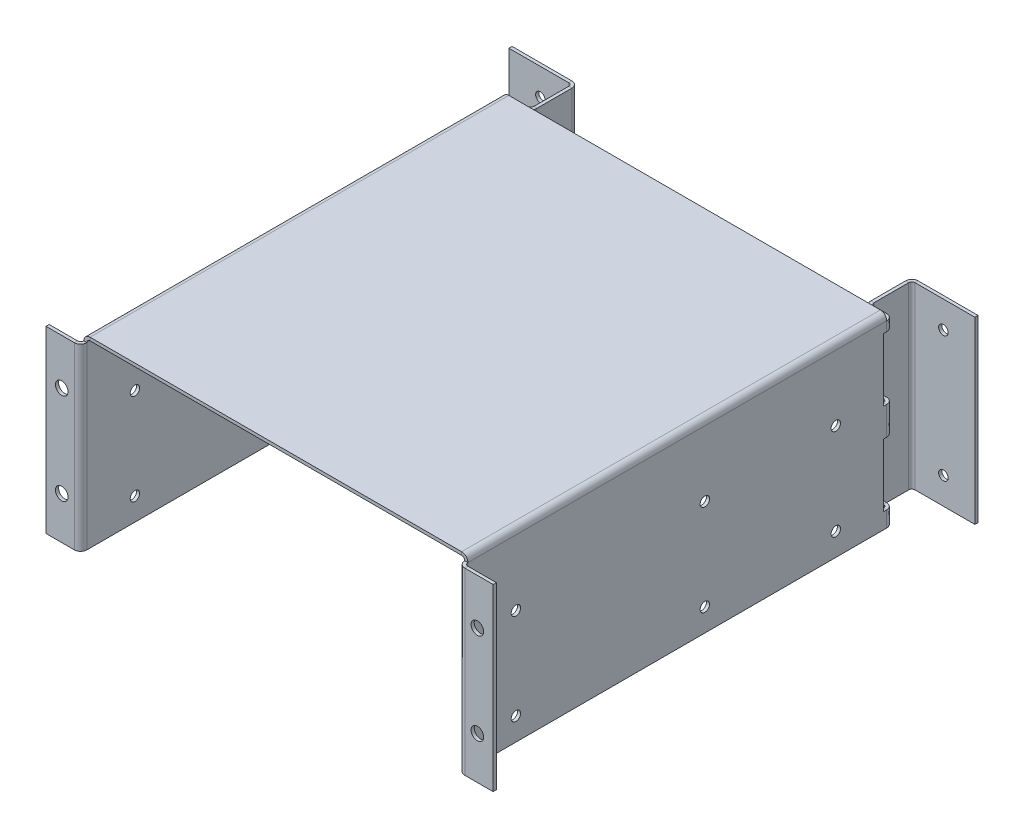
ISO-10303-21;
HEADER;
FILE_DESCRIPTION(('STEP AP214'),'2;1');
FILE_NAME('part.step','',(''),(''),'','','');
FILE_SCHEMA(('AUTOMOTIVE_DESIGN { 1 0 10303 214 1 1 1 1 }'));
ENDSEC;
DATA;
#1=APPLICATION_CONTEXT('core data for automotive mechanical design processes');
#2=APPLICATION_PROTOCOL_DEFINITION('international standard','automotive_design',2000,#1);
#3=PRODUCT_CONTEXT('',#1,'mechanical');
#4=PRODUCT('Part','Part','',(#3));
#5=PRODUCT_RELATED_PRODUCT_CATEGORY('part','',(#4));
#6=PRODUCT_DEFINITION_FORMATION('','',#4);
#7=PRODUCT_DEFINITION_CONTEXT('part definition',#1,'design');
#8=PRODUCT_DEFINITION('design','',#6,#7);
#9=PRODUCT_DEFINITION_SHAPE('','',#8);
#10=(LENGTH_UNIT() NAMED_UNIT(*) SI_UNIT(.MILLI.,.METRE.));
#11=(NAMED_UNIT(*) PLANE_ANGLE_UNIT() SI_UNIT($,.RADIAN.));
#12=(NAMED_UNIT(*) SI_UNIT($,.STERADIAN.) SOLID_ANGLE_UNIT());
#13=UNCERTAINTY_MEASURE_WITH_UNIT(LENGTH_MEASURE(1.E-05),#10,'distance_accuracy_value','');
#14=(GEOMETRIC_REPRESENTATION_CONTEXT(3) GLOBAL_UNCERTAINTY_ASSIGNED_CONTEXT((#13)) GLOBAL_UNIT_ASSIGNED_CONTEXT((#10,
#11,#12)) REPRESENTATION_CONTEXT('',''));
#15=CARTESIAN_POINT('',(0.,0.,0.));
#16=DIRECTION('',(0.,0.,1.));
#17=DIRECTION('',(1.,0.,0.));
#18=AXIS2_PLACEMENT_3D('',#15,#16,#17);
#19=CARTESIAN_POINT('',(62.9444821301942,-24.,0.999999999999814));
#20=DIRECTION('',(0.,-1.,0.));
#21=DIRECTION('',(0.,0.,-1.));
#22=AXIS2_PLACEMENT_3D('',#19,#20,#21);
#23=PLANE('',#22);
#24=DIRECTION('',(-1.,0.,0.));
#25=VECTOR('',#24,1.);
#26=CARTESIAN_POINT('',(0.,-24.,-1.00000000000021));
#27=LINE('',#26,#25);
#28=CARTESIAN_POINT('',(59.,-24.,-1.));
#29=VERTEX_POINT('',#28);
#30=CARTESIAN_POINT('',(58.,-24.,-1.));
#31=VERTEX_POINT('',#30);
#32=EDGE_CURVE('E1407',#29,#31,#27,.T.);
#33=ORIENTED_EDGE('',*,*,#32,.F.);
#34=DIRECTION('',(0.,0.,-1.));
#35=VECTOR('',#34,1.);
#36=CARTESIAN_POINT('',(59.,-24.,-1.));
#37=LINE('',#36,#35);
#38=CARTESIAN_POINT('',(59.,-24.,-2.));
#39=VERTEX_POINT('',#38);
#40=EDGE_CURVE('E15',#29,#39,#37,.T.);
#41=ORIENTED_EDGE('',*,*,#40,.T.);
#42=DIRECTION('',(-1.,0.,0.));
#43=VECTOR('',#42,1.);
#44=CARTESIAN_POINT('',(62.9444821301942,-24.,-2.00000000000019));
#45=LINE('',#44,#43);
#46=CARTESIAN_POINT('',(58.,-24.,-2.00000000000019));
#47=VERTEX_POINT('',#46);
#48=EDGE_CURVE('E696',#39,#47,#45,.T.);
#49=ORIENTED_EDGE('',*,*,#48,.T.);
#50=DIRECTION('',(0.,0.,-1.));
#51=VECTOR('',#50,1.);
#52=CARTESIAN_POINT('',(58.,-24.,0.999999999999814));
#53=LINE('',#52,#51);
#54=EDGE_CURVE('E227',#31,#47,#53,.T.);
#55=ORIENTED_EDGE('',*,*,#54,.F.);
#56=EDGE_LOOP('',(#33,#41,#49,#55));
#57=FACE_BOUND('',#56,.T.);
#58=ADVANCED_FACE('F207',(#57),#23,.F.);
#59=DIRECTION('',(0.,0.,1.));
#60=VECTOR('',#59,1.);
#61=CARTESIAN_POINT('',(61.,-24.,133.));
#62=LINE('',#61,#60);
#63=CARTESIAN_POINT('',(61.,-24.,0.));
#64=VERTEX_POINT('',#63);
#65=CARTESIAN_POINT('',(61.,-24.,0.999999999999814));
#66=VERTEX_POINT('',#65);
#67=EDGE_CURVE('E719',#64,#66,#62,.T.);
#68=ORIENTED_EDGE('',*,*,#67,.F.);
#69=DIRECTION('',(-1.,0.,0.));
#70=VECTOR('',#69,1.);
#71=CARTESIAN_POINT('',(61.,-24.,0.));
#72=LINE('',#71,#70);
#73=CARTESIAN_POINT('',(60.,-24.,0.));
#74=VERTEX_POINT('',#73);
#75=EDGE_CURVE('E216',#64,#74,#72,.T.);
#76=ORIENTED_EDGE('',*,*,#75,.T.);
#77=DIRECTION('',(0.,0.,1.));
#78=VECTOR('',#77,1.);
#79=CARTESIAN_POINT('',(60.,-24.,133.));
#80=LINE('',#79,#78);
#81=CARTESIAN_POINT('',(60.,-24.,0.999999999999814));
#82=VERTEX_POINT('',#81);
#83=EDGE_CURVE('E717',#74,#82,#80,.T.);
#84=ORIENTED_EDGE('',*,*,#83,.T.);
#85=DIRECTION('',(-1.,0.,0.));
#86=VECTOR('',#85,1.);
#87=CARTESIAN_POINT('',(62.9444821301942,-24.,0.999999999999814));
#88=LINE('',#87,#86);
#89=EDGE_CURVE('E709',#66,#82,#88,.T.);
#90=ORIENTED_EDGE('',*,*,#89,.F.);
#91=EDGE_LOOP('',(#68,#76,#84,#90));
#92=FACE_BOUND('',#91,.T.);
#93=ADVANCED_FACE('F1639',(#92),#23,.F.);
#94=CARTESIAN_POINT('',(62.9444821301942,-4.,0.999999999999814));
#95=DIRECTION('',(0.,1.,0.));
#96=DIRECTION('',(0.,0.,1.));
#97=AXIS2_PLACEMENT_3D('',#94,#95,#96);
#98=PLANE('',#97);
#99=DIRECTION('',(0.,0.,-1.));
#100=VECTOR('',#99,1.);
#101=CARTESIAN_POINT('',(60.,-4.,133.));
#102=LINE('',#101,#100);
#103=CARTESIAN_POINT('',(60.,-4.,0.999999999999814));
#104=VERTEX_POINT('',#103);
#105=CARTESIAN_POINT('',(60.,-4.,0.));
#106=VERTEX_POINT('',#105);
#107=EDGE_CURVE('E727',#104,#106,#102,.T.);
#108=ORIENTED_EDGE('',*,*,#107,.T.);
#109=DIRECTION('',(1.,0.,0.));
#110=VECTOR('',#109,1.);
#111=CARTESIAN_POINT('',(60.,-4.,0.));
#112=LINE('',#111,#110);
#113=CARTESIAN_POINT('',(61.,-4.,0.));
#114=VERTEX_POINT('',#113);
#115=EDGE_CURVE('E1425',#106,#114,#112,.T.);
#116=ORIENTED_EDGE('',*,*,#115,.T.);
#117=DIRECTION('',(0.,0.,-1.));
#118=VECTOR('',#117,1.);
#119=CARTESIAN_POINT('',(61.,-4.,133.));
#120=LINE('',#119,#118);
#121=CARTESIAN_POINT('',(61.,-4.,0.999999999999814));
#122=VERTEX_POINT('',#121);
#123=EDGE_CURVE('E730',#122,#114,#120,.T.);
#124=ORIENTED_EDGE('',*,*,#123,.F.);
#125=DIRECTION('',(1.,0.,0.));
#126=VECTOR('',#125,1.);
#127=CARTESIAN_POINT('',(62.9444821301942,-4.,0.999999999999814));
#128=LINE('',#127,#126);
#129=EDGE_CURVE('E713',#104,#122,#128,.T.);
#130=ORIENTED_EDGE('',*,*,#129,.F.);
#131=EDGE_LOOP('',(#108,#116,#124,#130));
#132=FACE_BOUND('',#131,.T.);
#133=ADVANCED_FACE('F1536',(#132),#98,.F.);
#134=DIRECTION('',(1.,0.,0.));
#135=VECTOR('',#134,1.);
#136=CARTESIAN_POINT('',(62.9444821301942,-4.,-2.00000000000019));
#137=LINE('',#136,#135);
#138=CARTESIAN_POINT('',(58.,-4.,-2.00000000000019));
#139=VERTEX_POINT('',#138);
#140=CARTESIAN_POINT('',(59.,-4.,-2.00000000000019));
#141=VERTEX_POINT('',#140);
#142=EDGE_CURVE('E683',#139,#141,#137,.T.);
#143=ORIENTED_EDGE('',*,*,#142,.T.);
#144=DIRECTION('',(0.,0.,1.));
#145=VECTOR('',#144,1.);
#146=CARTESIAN_POINT('',(59.,-4.,-2.00000000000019));
#147=LINE('',#146,#145);
#148=CARTESIAN_POINT('',(59.,-4.,-1.));
#149=VERTEX_POINT('',#148);
#150=EDGE_CURVE('E1423',#141,#149,#147,.T.);
#151=ORIENTED_EDGE('',*,*,#150,.T.);
#152=DIRECTION('',(1.,0.,0.));
#153=VECTOR('',#152,1.);
#154=CARTESIAN_POINT('',(0.,-4.,-1.00000000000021));
#155=LINE('',#154,#153);
#156=CARTESIAN_POINT('',(58.,-4.,-1.));
#157=VERTEX_POINT('',#156);
#158=EDGE_CURVE('E686',#157,#149,#155,.T.);
#159=ORIENTED_EDGE('',*,*,#158,.F.);
#160=DIRECTION('',(0.,0.,-1.));
#161=VECTOR('',#160,1.);
#162=CARTESIAN_POINT('',(58.,-4.,0.999999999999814));
#163=LINE('',#162,#161);
#164=EDGE_CURVE('E679',#157,#139,#163,.T.);
#165=ORIENTED_EDGE('',*,*,#164,.T.);
#166=EDGE_LOOP('',(#143,#151,#159,#165));
#167=FACE_BOUND('',#166,.T.);
#168=ADVANCED_FACE('F681',(#167),#98,.F.);
#169=CARTESIAN_POINT('',(58.,25.,0.999999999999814));
#170=DIRECTION('',(0.,1.,0.));
#171=DIRECTION('',(0.,0.,1.));
#172=AXIS2_PLACEMENT_3D('',#169,#170,#171);
#173=PLANE('',#172);
#174=DIRECTION('',(1.,0.,0.));
#175=VECTOR('',#174,1.);
#176=CARTESIAN_POINT('',(58.,25.,-2.00000000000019));
#177=LINE('',#176,#175);
#178=CARTESIAN_POINT('',(58.,25.,-2.));
#179=VERTEX_POINT('',#178);
#180=CARTESIAN_POINT('',(59.,25.,-2.00000000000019));
#181=VERTEX_POINT('',#180);
#182=EDGE_CURVE('E744',#179,#181,#177,.T.);
#183=ORIENTED_EDGE('',*,*,#182,.T.);
#184=DIRECTION('',(0.,0.,1.));
#185=VECTOR('',#184,1.);
#186=CARTESIAN_POINT('',(59.,25.,-2.00000000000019));
#187=LINE('',#186,#185);
#188=CARTESIAN_POINT('',(59.,25.,-1.));
#189=VERTEX_POINT('',#188);
#190=EDGE_CURVE('E1421',#181,#189,#187,.T.);
#191=ORIENTED_EDGE('',*,*,#190,.T.);
#192=DIRECTION('',(1.,0.,0.));
#193=VECTOR('',#192,1.);
#194=CARTESIAN_POINT('',(0.,25.,-1.00000000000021));
#195=LINE('',#194,#193);
#196=CARTESIAN_POINT('',(58.,25.,-1.));
#197=VERTEX_POINT('',#196);
#198=EDGE_CURVE('E1395',#197,#189,#195,.T.);
#199=ORIENTED_EDGE('',*,*,#198,.F.);
#200=DIRECTION('',(0.,0.,-1.));
#201=VECTOR('',#200,1.);
#202=CARTESIAN_POINT('',(58.,25.,0.999999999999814));
#203=LINE('',#202,#201);
#204=EDGE_CURVE('E747',#197,#179,#203,.T.);
#205=ORIENTED_EDGE('',*,*,#204,.T.);
#206=EDGE_LOOP('',(#183,#191,#199,#205));
#207=FACE_BOUND('',#206,.T.);
#208=ADVANCED_FACE('F1662',(#207),#173,.F.);
#209=DIRECTION('',(0.,0.,-1.));
#210=VECTOR('',#209,1.);
#211=CARTESIAN_POINT('',(60.,25.,133.));
#212=LINE('',#211,#210);
#213=CARTESIAN_POINT('',(60.,25.,0.999999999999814));
#214=VERTEX_POINT('',#213);
#215=CARTESIAN_POINT('',(60.,25.,0.));
#216=VERTEX_POINT('',#215);
#217=EDGE_CURVE('E761',#214,#216,#212,.T.);
#218=ORIENTED_EDGE('',*,*,#217,.T.);
#219=DIRECTION('',(1.,0.,0.));
#220=VECTOR('',#219,1.);
#221=CARTESIAN_POINT('',(60.,25.,0.));
#222=LINE('',#221,#220);
#223=CARTESIAN_POINT('',(61.,25.,0.));
#224=VERTEX_POINT('',#223);
#225=EDGE_CURVE('E1419',#216,#224,#222,.T.);
#226=ORIENTED_EDGE('',*,*,#225,.T.);
#227=DIRECTION('',(0.,0.,-1.));
#228=VECTOR('',#227,1.);
#229=CARTESIAN_POINT('',(61.,25.,133.));
#230=LINE('',#229,#228);
#231=CARTESIAN_POINT('',(61.,25.,0.999999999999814));
#232=VERTEX_POINT('',#231);
#233=EDGE_CURVE('E767',#232,#224,#230,.T.);
#234=ORIENTED_EDGE('',*,*,#233,.F.);
#235=DIRECTION('',(1.,0.,0.));
#236=VECTOR('',#235,1.);
#237=CARTESIAN_POINT('',(58.,25.,0.999999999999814));
#238=LINE('',#237,#236);
#239=EDGE_CURVE('E743',#214,#232,#238,.T.);
#240=ORIENTED_EDGE('',*,*,#239,.F.);
#241=EDGE_LOOP('',(#218,#226,#234,#240));
#242=FACE_BOUND('',#241,.T.);
#243=ADVANCED_FACE('F1666',(#242),#173,.F.);
#244=CARTESIAN_POINT('',(58.,5.,0.999999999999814));
#245=DIRECTION('',(0.,-1.,0.));
#246=DIRECTION('',(0.,0.,-1.));
#247=AXIS2_PLACEMENT_3D('',#244,#245,#246);
#248=PLANE('',#247);
#249=DIRECTION('',(-1.,0.,0.));
#250=VECTOR('',#249,1.);
#251=CARTESIAN_POINT('',(0.,5.,-1.00000000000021));
#252=LINE('',#251,#250);
#253=CARTESIAN_POINT('',(59.,5.,-1.));
#254=VERTEX_POINT('',#253);
#255=CARTESIAN_POINT('',(58.,5.,-1.));
#256=VERTEX_POINT('',#255);
#257=EDGE_CURVE('E1401',#254,#256,#252,.T.);
#258=ORIENTED_EDGE('',*,*,#257,.F.);
#259=DIRECTION('',(0.,0.,-1.));
#260=VECTOR('',#259,1.);
#261=CARTESIAN_POINT('',(59.,5.,-1.));
#262=LINE('',#261,#260);
#263=CARTESIAN_POINT('',(59.,5.,-2.00000000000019));
#264=VERTEX_POINT('',#263);
#265=EDGE_CURVE('E1417',#254,#264,#262,.T.);
#266=ORIENTED_EDGE('',*,*,#265,.T.);
#267=DIRECTION('',(-1.,0.,0.));
#268=VECTOR('',#267,1.);
#269=CARTESIAN_POINT('',(58.,5.,-2.00000000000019));
#270=LINE('',#269,#268);
#271=CARTESIAN_POINT('',(58.,5.,-2.00000000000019));
#272=VERTEX_POINT('',#271);
#273=EDGE_CURVE('E749',#264,#272,#270,.T.);
#274=ORIENTED_EDGE('',*,*,#273,.T.);
#275=DIRECTION('',(0.,0.,-1.));
#276=VECTOR('',#275,1.);
#277=CARTESIAN_POINT('',(58.,5.,0.999999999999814));
#278=LINE('',#277,#276);
#279=EDGE_CURVE('E756',#256,#272,#278,.T.);
#280=ORIENTED_EDGE('',*,*,#279,.F.);
#281=EDGE_LOOP('',(#258,#266,#274,#280));
#282=FACE_BOUND('',#281,.T.);
#283=ADVANCED_FACE('F1673',(#282),#248,.F.);
#284=DIRECTION('',(0.,0.,1.));
#285=VECTOR('',#284,1.);
#286=CARTESIAN_POINT('',(61.,5.,133.));
#287=LINE('',#286,#285);
#288=CARTESIAN_POINT('',(61.,5.,0.));
#289=VERTEX_POINT('',#288);
#290=CARTESIAN_POINT('',(61.,5.,0.999999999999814));
#291=VERTEX_POINT('',#290);
#292=EDGE_CURVE('E778',#289,#291,#287,.T.);
#293=ORIENTED_EDGE('',*,*,#292,.F.);
#294=DIRECTION('',(-1.,0.,0.));
#295=VECTOR('',#294,1.);
#296=CARTESIAN_POINT('',(61.,5.,0.));
#297=LINE('',#296,#295);
#298=CARTESIAN_POINT('',(60.,5.,0.));
#299=VERTEX_POINT('',#298);
#300=EDGE_CURVE('E1415',#289,#299,#297,.T.);
#301=ORIENTED_EDGE('',*,*,#300,.T.);
#302=DIRECTION('',(0.,0.,1.));
#303=VECTOR('',#302,1.);
#304=CARTESIAN_POINT('',(60.,5.,133.));
#305=LINE('',#304,#303);
#306=CARTESIAN_POINT('',(60.,5.,0.999999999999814));
#307=VERTEX_POINT('',#306);
#308=EDGE_CURVE('E773',#299,#307,#305,.T.);
#309=ORIENTED_EDGE('',*,*,#308,.T.);
#310=DIRECTION('',(-1.,0.,0.));
#311=VECTOR('',#310,1.);
#312=CARTESIAN_POINT('',(58.,5.,0.999999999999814));
#313=LINE('',#312,#311);
#314=EDGE_CURVE('E740',#291,#307,#313,.T.);
#315=ORIENTED_EDGE('',*,*,#314,.F.);
#316=EDGE_LOOP('',(#293,#301,#309,#315));
#317=FACE_BOUND('',#316,.T.);
#318=ADVANCED_FACE('F1685',(#317),#248,.F.);
#319=CARTESIAN_POINT('',(59.,-29.,0.));
#320=DIRECTION('',(0.,-1.,0.));
#321=DIRECTION('',(0.,0.,-1.));
#322=AXIS2_PLACEMENT_3D('',#319,#320,#321);
#323=CYLINDRICAL_SURFACE('',#322,2.);
#324=CARTESIAN_POINT('',(59.,-4.,0.));
#325=DIRECTION('',(0.,1.,0.));
#326=DIRECTION('',(0.,0.,1.));
#327=AXIS2_PLACEMENT_3D('',#324,#325,#326);
#328=CIRCLE('',#327,2.);
#329=EDGE_CURVE('E733',#141,#114,#328,.F.);
#330=ORIENTED_EDGE('',*,*,#329,.F.);
#331=DIRECTION('',(0.,-1.,0.));
#332=VECTOR('',#331,1.);
#333=CARTESIAN_POINT('',(59.,0.,-2.));
#334=LINE('',#333,#332);
#335=EDGE_CURVE('E702',#264,#141,#334,.T.);
#336=ORIENTED_EDGE('',*,*,#335,.F.);
#337=CARTESIAN_POINT('',(59.,5.,0.));
#338=DIRECTION('',(0.,-1.,0.));
#339=DIRECTION('',(0.,0.,-1.));
#340=AXIS2_PLACEMENT_3D('',#337,#338,#339);
#341=CIRCLE('',#340,2.);
#342=EDGE_CURVE('E775',#289,#264,#341,.F.);
#343=ORIENTED_EDGE('',*,*,#342,.F.);
#344=DIRECTION('',(0.,1.,0.));
#345=VECTOR('',#344,1.);
#346=CARTESIAN_POINT('',(61.,30.,0.));
#347=LINE('',#346,#345);
#348=EDGE_CURVE('E1240',#114,#289,#347,.T.);
#349=ORIENTED_EDGE('',*,*,#348,.F.);
#350=EDGE_LOOP('',(#330,#336,#343,#349));
#351=FACE_BOUND('',#350,.T.);
#352=ADVANCED_FACE('F1705',(#351),#323,.T.);
#353=CARTESIAN_POINT('',(59.,-29.,0.));
#354=DIRECTION('',(0.,-1.,0.));
#355=DIRECTION('',(0.,0.,-1.));
#356=AXIS2_PLACEMENT_3D('',#353,#354,#355);
#357=CYLINDRICAL_SURFACE('',#356,1.);
#358=DIRECTION('',(0.,1.,0.));
#359=VECTOR('',#358,1.);
#360=CARTESIAN_POINT('',(59.,28.,-1.));
#361=LINE('',#360,#359);
#362=EDGE_CURVE('E1079',#254,#149,#361,.F.);
#363=ORIENTED_EDGE('',*,*,#362,.T.);
#364=CARTESIAN_POINT('',(59.,-4.,0.));
#365=DIRECTION('',(0.,1.,0.));
#366=DIRECTION('',(0.,0.,1.));
#367=AXIS2_PLACEMENT_3D('',#364,#365,#366);
#368=CIRCLE('',#367,1.);
#369=EDGE_CURVE('E724',#149,#106,#368,.F.);
#370=ORIENTED_EDGE('',*,*,#369,.T.);
#371=DIRECTION('',(0.,-1.,0.));
#372=VECTOR('',#371,1.);
#373=CARTESIAN_POINT('',(60.,30.,0.));
#374=LINE('',#373,#372);
#375=EDGE_CURVE('E1317',#106,#299,#374,.F.);
#376=ORIENTED_EDGE('',*,*,#375,.T.);
#377=CARTESIAN_POINT('',(59.,5.,0.));
#378=DIRECTION('',(0.,-1.,0.));
#379=DIRECTION('',(0.,0.,-1.));
#380=AXIS2_PLACEMENT_3D('',#377,#378,#379);
#381=CIRCLE('',#380,1.);
#382=EDGE_CURVE('E770',#299,#254,#381,.F.);
#383=ORIENTED_EDGE('',*,*,#382,.T.);
#384=EDGE_LOOP('',(#363,#370,#376,#383));
#385=FACE_BOUND('',#384,.T.);
#386=ADVANCED_FACE('F1540',(#385),#357,.F.);
#387=CARTESIAN_POINT('',(59.,-24.,0.));
#388=DIRECTION('',(0.,-1.,0.));
#389=DIRECTION('',(0.,0.,-1.));
#390=AXIS2_PLACEMENT_3D('',#387,#388,#389);
#391=CIRCLE('',#390,2.);
#392=EDGE_CURVE('E722',#64,#39,#391,.F.);
#393=ORIENTED_EDGE('',*,*,#392,.F.);
#394=CARTESIAN_POINT('',(61.,-29.,0.));
#395=VERTEX_POINT('',#394);
#396=EDGE_CURVE('E1236',#395,#64,#347,.T.);
#397=ORIENTED_EDGE('',*,*,#396,.F.);
#398=CARTESIAN_POINT('',(59.,-29.,0.));
#399=DIRECTION('',(0.,-1.,0.));
#400=DIRECTION('',(0.,0.,-1.));
#401=AXIS2_PLACEMENT_3D('',#398,#399,#400);
#402=CIRCLE('',#401,2.);
#403=CARTESIAN_POINT('',(59.,-29.,-2.));
#404=VERTEX_POINT('',#403);
#405=EDGE_CURVE('E1087',#404,#395,#402,.T.);
#406=ORIENTED_EDGE('',*,*,#405,.F.);
#407=EDGE_CURVE('E1072',#39,#404,#334,.T.);
#408=ORIENTED_EDGE('',*,*,#407,.F.);
#409=EDGE_LOOP('',(#393,#397,#406,#408));
#410=FACE_BOUND('',#409,.T.);
#411=ADVANCED_FACE('F1559',(#410),#323,.T.);
#412=CARTESIAN_POINT('',(60.,-29.,0.));
#413=VERTEX_POINT('',#412);
#414=EDGE_CURVE('E1313',#413,#74,#374,.F.);
#415=ORIENTED_EDGE('',*,*,#414,.T.);
#416=CARTESIAN_POINT('',(59.,-24.,0.));
#417=DIRECTION('',(0.,-1.,0.));
#418=DIRECTION('',(0.,0.,-1.));
#419=AXIS2_PLACEMENT_3D('',#416,#417,#418);
#420=CIRCLE('',#419,1.);
#421=EDGE_CURVE('E689',#74,#29,#420,.F.);
#422=ORIENTED_EDGE('',*,*,#421,.T.);
#423=CARTESIAN_POINT('',(59.,-29.,-1.));
#424=VERTEX_POINT('',#423);
#425=EDGE_CURVE('E1080',#29,#424,#361,.F.);
#426=ORIENTED_EDGE('',*,*,#425,.T.);
#427=CARTESIAN_POINT('',(59.,-29.,0.));
#428=DIRECTION('',(0.,-1.,0.));
#429=DIRECTION('',(0.,0.,-1.));
#430=AXIS2_PLACEMENT_3D('',#427,#428,#429);
#431=CIRCLE('',#430,1.);
#432=EDGE_CURVE('E1050',#424,#413,#431,.T.);
#433=ORIENTED_EDGE('',*,*,#432,.T.);
#434=EDGE_LOOP('',(#415,#422,#426,#433));
#435=FACE_BOUND('',#434,.T.);
#436=ADVANCED_FACE('F1551',(#435),#357,.F.);
#437=CARTESIAN_POINT('',(-62.9444821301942,-4.,0.999999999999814));
#438=DIRECTION('',(0.,-1.,0.));
#439=DIRECTION('',(0.,0.,-1.));
#440=AXIS2_PLACEMENT_3D('',#437,#438,#439);
#441=PLANE('',#440);
#442=DIRECTION('',(-1.,0.,0.));
#443=VECTOR('',#442,1.);
#444=CARTESIAN_POINT('',(0.,-4.,-1.00000000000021));
#445=LINE('',#444,#443);
#446=CARTESIAN_POINT('',(-58.,-4.,-1.));
#447=VERTEX_POINT('',#446);
#448=CARTESIAN_POINT('',(-59.,-4.,-1.));
#449=VERTEX_POINT('',#448);
#450=EDGE_CURVE('E1369',#447,#449,#445,.T.);
#451=ORIENTED_EDGE('',*,*,#450,.T.);
#452=DIRECTION('',(0.,0.,-1.));
#453=VECTOR('',#452,1.);
#454=CARTESIAN_POINT('',(-59.,-4.,-1.));
#455=LINE('',#454,#453);
#456=CARTESIAN_POINT('',(-59.,-4.,-2.));
#457=VERTEX_POINT('',#456);
#458=EDGE_CURVE('E1393',#449,#457,#455,.T.);
#459=ORIENTED_EDGE('',*,*,#458,.T.);
#460=DIRECTION('',(-1.,0.,0.));
#461=VECTOR('',#460,1.);
#462=CARTESIAN_POINT('',(-62.9444821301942,-4.,-2.00000000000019));
#463=LINE('',#462,#461);
#464=CARTESIAN_POINT('',(-58.,-4.,-2.00000000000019));
#465=VERTEX_POINT('',#464);
#466=EDGE_CURVE('E961',#465,#457,#463,.T.);
#467=ORIENTED_EDGE('',*,*,#466,.F.);
#468=DIRECTION('',(0.,0.,-1.));
#469=VECTOR('',#468,1.);
#470=CARTESIAN_POINT('',(-58.,-4.,0.999999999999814));
#471=LINE('',#470,#469);
#472=EDGE_CURVE('E964',#447,#465,#471,.T.);
#473=ORIENTED_EDGE('',*,*,#472,.F.);
#474=EDGE_LOOP('',(#451,#459,#467,#473));
#475=FACE_BOUND('',#474,.T.);
#476=ADVANCED_FACE('F1840',(#475),#441,.T.);
#477=DIRECTION('',(0.,0.,-1.));
#478=VECTOR('',#477,1.);
#479=CARTESIAN_POINT('',(-61.,-4.,133.));
#480=LINE('',#479,#478);
#481=CARTESIAN_POINT('',(-61.,-4.,0.999999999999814));
#482=VERTEX_POINT('',#481);
#483=CARTESIAN_POINT('',(-61.,-4.,0.));
#484=VERTEX_POINT('',#483);
#485=EDGE_CURVE('E984',#482,#484,#480,.T.);
#486=ORIENTED_EDGE('',*,*,#485,.T.);
#487=DIRECTION('',(1.,0.,0.));
#488=VECTOR('',#487,1.);
#489=CARTESIAN_POINT('',(-61.,-4.,0.));
#490=LINE('',#489,#488);
#491=CARTESIAN_POINT('',(-60.,-4.,0.));
#492=VERTEX_POINT('',#491);
#493=EDGE_CURVE('E1391',#484,#492,#490,.T.);
#494=ORIENTED_EDGE('',*,*,#493,.T.);
#495=DIRECTION('',(0.,0.,-1.));
#496=VECTOR('',#495,1.);
#497=CARTESIAN_POINT('',(-60.,-4.,133.));
#498=LINE('',#497,#496);
#499=CARTESIAN_POINT('',(-60.,-4.,0.999999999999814));
#500=VERTEX_POINT('',#499);
#501=EDGE_CURVE('E978',#500,#492,#498,.T.);
#502=ORIENTED_EDGE('',*,*,#501,.F.);
#503=DIRECTION('',(-1.,0.,0.));
#504=VECTOR('',#503,1.);
#505=CARTESIAN_POINT('',(-62.9444821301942,-4.,0.999999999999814));
#506=LINE('',#505,#504);
#507=EDGE_CURVE('E960',#500,#482,#506,.T.);
#508=ORIENTED_EDGE('',*,*,#507,.T.);
#509=EDGE_LOOP('',(#486,#494,#502,#508));
#510=FACE_BOUND('',#509,.T.);
#511=ADVANCED_FACE('F1954',(#510),#441,.T.);
#512=CARTESIAN_POINT('',(-62.9444821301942,-24.,0.999999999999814));
#513=DIRECTION('',(0.,1.,0.));
#514=DIRECTION('',(0.,0.,1.));
#515=AXIS2_PLACEMENT_3D('',#512,#513,#514);
#516=PLANE('',#515);
#517=DIRECTION('',(1.,0.,0.));
#518=VECTOR('',#517,1.);
#519=CARTESIAN_POINT('',(-62.9444821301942,-24.,-2.00000000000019));
#520=LINE('',#519,#518);
#521=CARTESIAN_POINT('',(-59.,-24.,-2.00000000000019));
#522=VERTEX_POINT('',#521);
#523=CARTESIAN_POINT('',(-58.,-24.,-2.00000000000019));
#524=VERTEX_POINT('',#523);
#525=EDGE_CURVE('E948',#522,#524,#520,.T.);
#526=ORIENTED_EDGE('',*,*,#525,.F.);
#527=DIRECTION('',(0.,0.,1.));
#528=VECTOR('',#527,1.);
#529=CARTESIAN_POINT('',(-59.,-24.,-2.00000000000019));
#530=LINE('',#529,#528);
#531=CARTESIAN_POINT('',(-59.,-24.,-1.));
#532=VERTEX_POINT('',#531);
#533=EDGE_CURVE('E1389',#522,#532,#530,.T.);
#534=ORIENTED_EDGE('',*,*,#533,.T.);
#535=DIRECTION('',(1.,0.,0.));
#536=VECTOR('',#535,1.);
#537=CARTESIAN_POINT('',(0.,-24.,-1.00000000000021));
#538=LINE('',#537,#536);
#539=CARTESIAN_POINT('',(-58.,-24.,-1.));
#540=VERTEX_POINT('',#539);
#541=EDGE_CURVE('E1375',#532,#540,#538,.T.);
#542=ORIENTED_EDGE('',*,*,#541,.T.);
#543=DIRECTION('',(0.,0.,-1.));
#544=VECTOR('',#543,1.);
#545=CARTESIAN_POINT('',(-58.,-24.,0.999999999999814));
#546=LINE('',#545,#544);
#547=EDGE_CURVE('E973',#540,#524,#546,.T.);
#548=ORIENTED_EDGE('',*,*,#547,.T.);
#549=EDGE_LOOP('',(#526,#534,#542,#548));
#550=FACE_BOUND('',#549,.T.);
#551=ADVANCED_FACE('F1936',(#550),#516,.T.);
#552=DIRECTION('',(0.,0.,1.));
#553=VECTOR('',#552,1.);
#554=CARTESIAN_POINT('',(-60.,-24.,133.));
#555=LINE('',#554,#553);
#556=CARTESIAN_POINT('',(-60.,-24.,0.));
#557=VERTEX_POINT('',#556);
#558=CARTESIAN_POINT('',(-60.,-24.,0.999999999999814));
#559=VERTEX_POINT('',#558);
#560=EDGE_CURVE('E990',#557,#559,#555,.T.);
#561=ORIENTED_EDGE('',*,*,#560,.F.);
#562=DIRECTION('',(-1.,0.,0.));
#563=VECTOR('',#562,1.);
#564=CARTESIAN_POINT('',(-60.,-24.,0.));
#565=LINE('',#564,#563);
#566=CARTESIAN_POINT('',(-61.,-24.,0.));
#567=VERTEX_POINT('',#566);
#568=EDGE_CURVE('E1387',#557,#567,#565,.T.);
#569=ORIENTED_EDGE('',*,*,#568,.T.);
#570=DIRECTION('',(0.,0.,1.));
#571=VECTOR('',#570,1.);
#572=CARTESIAN_POINT('',(-61.,-24.,133.));
#573=LINE('',#572,#571);
#574=CARTESIAN_POINT('',(-61.,-24.,0.999999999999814));
#575=VERTEX_POINT('',#574);
#576=EDGE_CURVE('E996',#567,#575,#573,.T.);
#577=ORIENTED_EDGE('',*,*,#576,.T.);
#578=DIRECTION('',(1.,0.,0.));
#579=VECTOR('',#578,1.);
#580=CARTESIAN_POINT('',(-62.9444821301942,-24.,0.999999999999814));
#581=LINE('',#580,#579);
#582=EDGE_CURVE('E957',#575,#559,#581,.T.);
#583=ORIENTED_EDGE('',*,*,#582,.T.);
#584=EDGE_LOOP('',(#561,#569,#577,#583));
#585=FACE_BOUND('',#584,.T.);
#586=ADVANCED_FACE('F1937',(#585),#516,.T.);
#587=CARTESIAN_POINT('',(-58.,5.,0.999999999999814));
#588=DIRECTION('',(0.,1.,0.));
#589=DIRECTION('',(0.,0.,1.));
#590=AXIS2_PLACEMENT_3D('',#587,#588,#589);
#591=PLANE('',#590);
#592=DIRECTION('',(1.,0.,0.));
#593=VECTOR('',#592,1.);
#594=CARTESIAN_POINT('',(-58.,5.,-2.00000000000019));
#595=LINE('',#594,#593);
#596=CARTESIAN_POINT('',(-59.,5.,-2.00000000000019));
#597=VERTEX_POINT('',#596);
#598=CARTESIAN_POINT('',(-58.,5.,-2.));
#599=VERTEX_POINT('',#598);
#600=EDGE_CURVE('E1006',#597,#599,#595,.T.);
#601=ORIENTED_EDGE('',*,*,#600,.F.);
#602=DIRECTION('',(0.,0.,1.));
#603=VECTOR('',#602,1.);
#604=CARTESIAN_POINT('',(-59.,5.,-2.00000000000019));
#605=LINE('',#604,#603);
#606=CARTESIAN_POINT('',(-59.,5.,-1.));
#607=VERTEX_POINT('',#606);
#608=EDGE_CURVE('E1385',#597,#607,#605,.T.);
#609=ORIENTED_EDGE('',*,*,#608,.T.);
#610=DIRECTION('',(1.,0.,0.));
#611=VECTOR('',#610,1.);
#612=CARTESIAN_POINT('',(0.,5.,-1.00000000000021));
#613=LINE('',#612,#611);
#614=CARTESIAN_POINT('',(-58.,5.,-1.));
#615=VERTEX_POINT('',#614);
#616=EDGE_CURVE('E1358',#607,#615,#613,.T.);
#617=ORIENTED_EDGE('',*,*,#616,.T.);
#618=DIRECTION('',(0.,0.,-1.));
#619=VECTOR('',#618,1.);
#620=CARTESIAN_POINT('',(-58.,5.,0.999999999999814));
#621=LINE('',#620,#619);
#622=EDGE_CURVE('E1009',#615,#599,#621,.T.);
#623=ORIENTED_EDGE('',*,*,#622,.T.);
#624=EDGE_LOOP('',(#601,#609,#617,#623));
#625=FACE_BOUND('',#624,.T.);
#626=ADVANCED_FACE('F1918',(#625),#591,.T.);
#627=DIRECTION('',(0.,0.,1.));
#628=VECTOR('',#627,1.);
#629=CARTESIAN_POINT('',(-60.,5.,133.));
#630=LINE('',#629,#628);
#631=CARTESIAN_POINT('',(-60.,5.,0.));
#632=VERTEX_POINT('',#631);
#633=CARTESIAN_POINT('',(-60.,5.,0.999999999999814));
#634=VERTEX_POINT('',#633);
#635=EDGE_CURVE('E1024',#632,#634,#630,.T.);
#636=ORIENTED_EDGE('',*,*,#635,.F.);
#637=DIRECTION('',(-1.,0.,0.));
#638=VECTOR('',#637,1.);
#639=CARTESIAN_POINT('',(-60.,5.,0.));
#640=LINE('',#639,#638);
#641=CARTESIAN_POINT('',(-61.,5.,0.));
#642=VERTEX_POINT('',#641);
#643=EDGE_CURVE('E1383',#632,#642,#640,.T.);
#644=ORIENTED_EDGE('',*,*,#643,.T.);
#645=DIRECTION('',(0.,0.,1.));
#646=VECTOR('',#645,1.);
#647=CARTESIAN_POINT('',(-61.,5.,133.));
#648=LINE('',#647,#646);
#649=CARTESIAN_POINT('',(-61.,5.,0.999999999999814));
#650=VERTEX_POINT('',#649);
#651=EDGE_CURVE('E1030',#642,#650,#648,.T.);
#652=ORIENTED_EDGE('',*,*,#651,.T.);
#653=DIRECTION('',(1.,0.,0.));
#654=VECTOR('',#653,1.);
#655=CARTESIAN_POINT('',(-58.,5.,0.999999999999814));
#656=LINE('',#655,#654);
#657=EDGE_CURVE('E1005',#650,#634,#656,.T.);
#658=ORIENTED_EDGE('',*,*,#657,.T.);
#659=EDGE_LOOP('',(#636,#644,#652,#658));
#660=FACE_BOUND('',#659,.T.);
#661=ADVANCED_FACE('F1919',(#660),#591,.T.);
#662=CARTESIAN_POINT('',(-58.,25.,0.999999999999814));
#663=DIRECTION('',(0.,-1.,0.));
#664=DIRECTION('',(0.,0.,-1.));
#665=AXIS2_PLACEMENT_3D('',#662,#663,#664);
#666=PLANE('',#665);
#667=DIRECTION('',(-1.,0.,0.));
#668=VECTOR('',#667,1.);
#669=CARTESIAN_POINT('',(0.,25.,-1.00000000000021));
#670=LINE('',#669,#668);
#671=CARTESIAN_POINT('',(-58.,25.,-1.));
#672=VERTEX_POINT('',#671);
#673=CARTESIAN_POINT('',(-59.,25.,-1.));
#674=VERTEX_POINT('',#673);
#675=EDGE_CURVE('E1363',#672,#674,#670,.T.);
#676=ORIENTED_EDGE('',*,*,#675,.T.);
#677=DIRECTION('',(0.,0.,-1.));
#678=VECTOR('',#677,1.);
#679=CARTESIAN_POINT('',(-59.,25.,-1.));
#680=LINE('',#679,#678);
#681=CARTESIAN_POINT('',(-59.,25.,-2.00000000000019));
#682=VERTEX_POINT('',#681);
#683=EDGE_CURVE('E1381',#674,#682,#680,.T.);
#684=ORIENTED_EDGE('',*,*,#683,.T.);
#685=DIRECTION('',(-1.,0.,0.));
#686=VECTOR('',#685,1.);
#687=CARTESIAN_POINT('',(-58.,25.,-2.00000000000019));
#688=LINE('',#687,#686);
#689=CARTESIAN_POINT('',(-58.,25.,-2.00000000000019));
#690=VERTEX_POINT('',#689);
#691=EDGE_CURVE('E1012',#690,#682,#688,.T.);
#692=ORIENTED_EDGE('',*,*,#691,.F.);
#693=DIRECTION('',(0.,0.,-1.));
#694=VECTOR('',#693,1.);
#695=CARTESIAN_POINT('',(-58.,25.,0.999999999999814));
#696=LINE('',#695,#694);
#697=EDGE_CURVE('E1019',#672,#690,#696,.T.);
#698=ORIENTED_EDGE('',*,*,#697,.F.);
#699=EDGE_LOOP('',(#676,#684,#692,#698));
#700=FACE_BOUND('',#699,.T.);
#701=ADVANCED_FACE('F1908',(#700),#666,.T.);
#702=DIRECTION('',(0.,0.,-1.));
#703=VECTOR('',#702,1.);
#704=CARTESIAN_POINT('',(-61.,25.,133.));
#705=LINE('',#704,#703);
#706=CARTESIAN_POINT('',(-61.,25.,0.999999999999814));
#707=VERTEX_POINT('',#706);
#708=CARTESIAN_POINT('',(-61.,25.,0.));
#709=VERTEX_POINT('',#708);
#710=EDGE_CURVE('E1041',#707,#709,#705,.T.);
#711=ORIENTED_EDGE('',*,*,#710,.T.);
#712=DIRECTION('',(1.,0.,0.));
#713=VECTOR('',#712,1.);
#714=CARTESIAN_POINT('',(-61.,25.,0.));
#715=LINE('',#714,#713);
#716=CARTESIAN_POINT('',(-60.,25.,0.));
#717=VERTEX_POINT('',#716);
#718=EDGE_CURVE('E1379',#709,#717,#715,.T.);
#719=ORIENTED_EDGE('',*,*,#718,.T.);
#720=DIRECTION('',(0.,0.,-1.));
#721=VECTOR('',#720,1.);
#722=CARTESIAN_POINT('',(-60.,25.,133.));
#723=LINE('',#722,#721);
#724=CARTESIAN_POINT('',(-60.,25.,0.999999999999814));
#725=VERTEX_POINT('',#724);
#726=EDGE_CURVE('E1035',#725,#717,#723,.T.);
#727=ORIENTED_EDGE('',*,*,#726,.F.);
#728=DIRECTION('',(-1.,0.,0.));
#729=VECTOR('',#728,1.);
#730=CARTESIAN_POINT('',(-58.,25.,0.999999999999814));
#731=LINE('',#730,#729);
#732=EDGE_CURVE('E1002',#725,#707,#731,.T.);
#733=ORIENTED_EDGE('',*,*,#732,.T.);
#734=EDGE_LOOP('',(#711,#719,#727,#733));
#735=FACE_BOUND('',#734,.T.);
#736=ADVANCED_FACE('F1909',(#735),#666,.T.);
#737=CARTESIAN_POINT('',(-61.,30.,133.));
#738=DIRECTION('',(1.,0.,0.));
#739=DIRECTION('',(0.,1.,0.));
#740=AXIS2_PLACEMENT_3D('',#737,#738,#739);
#741=PLANE('',#740);
#742=CARTESIAN_POINT('',(-61.,-21.8,16.15));
#743=DIRECTION('',(1.,0.,0.));
#744=DIRECTION('',(0.,1.,0.));
#745=AXIS2_PLACEMENT_3D('',#742,#743,#744);
#746=CIRCLE('',#745,1.49999999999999);
#747=CARTESIAN_POINT('',(-61.,-20.3,16.15));
#748=VERTEX_POINT('',#747);
#749=EDGE_CURVE('E1450',#748,#748,#746,.T.);
#750=ORIENTED_EDGE('',*,*,#749,.T.);
#751=EDGE_LOOP('',(#750));
#752=FACE_BOUND('',#751,.T.);
#753=CARTESIAN_POINT('',(-61.,7.19999999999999,16.15));
#754=DIRECTION('',(1.,0.,0.));
#755=DIRECTION('',(0.,1.,0.));
#756=AXIS2_PLACEMENT_3D('',#753,#754,#755);
#757=CIRCLE('',#756,1.49999999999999);
#758=CARTESIAN_POINT('',(-61.,8.69999999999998,16.15));
#759=VERTEX_POINT('',#758);
#760=EDGE_CURVE('E1446',#759,#759,#757,.T.);
#761=ORIENTED_EDGE('',*,*,#760,.T.);
#762=EDGE_LOOP('',(#761));
#763=FACE_BOUND('',#762,.T.);
#764=CARTESIAN_POINT('',(-61.,-21.8,57.75));
#765=DIRECTION('',(1.,0.,0.));
#766=DIRECTION('',(0.,1.,0.));
#767=AXIS2_PLACEMENT_3D('',#764,#765,#766);
#768=CIRCLE('',#767,1.49999999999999);
#769=CARTESIAN_POINT('',(-61.,-20.3,57.75));
#770=VERTEX_POINT('',#769);
#771=EDGE_CURVE('E1442',#770,#770,#768,.T.);
#772=ORIENTED_EDGE('',*,*,#771,.T.);
#773=EDGE_LOOP('',(#772));
#774=FACE_BOUND('',#773,.T.);
#775=CARTESIAN_POINT('',(-61.,7.2,57.75));
#776=DIRECTION('',(1.,0.,0.));
#777=DIRECTION('',(0.,1.,0.));
#778=AXIS2_PLACEMENT_3D('',#775,#776,#777);
#779=CIRCLE('',#778,1.5);
#780=CARTESIAN_POINT('',(-61.,8.69999999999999,57.75));
#781=VERTEX_POINT('',#780);
#782=EDGE_CURVE('E1437',#781,#781,#779,.T.);
#783=ORIENTED_EDGE('',*,*,#782,.T.);
#784=EDGE_LOOP('',(#783));
#785=FACE_BOUND('',#784,.T.);
#786=CARTESIAN_POINT('',(-61.,7.2,117.75));
#787=DIRECTION('',(1.,0.,0.));
#788=DIRECTION('',(0.,1.,0.));
#789=AXIS2_PLACEMENT_3D('',#786,#787,#788);
#790=CIRCLE('',#789,1.5);
#791=CARTESIAN_POINT('',(-61.,8.7,117.75));
#792=VERTEX_POINT('',#791);
#793=EDGE_CURVE('E1432',#792,#792,#790,.T.);
#794=ORIENTED_EDGE('',*,*,#793,.T.);
#795=EDGE_LOOP('',(#794));
#796=FACE_BOUND('',#795,.T.);
#797=CARTESIAN_POINT('',(-61.,-21.8,117.75));
#798=DIRECTION('',(1.,0.,0.));
#799=DIRECTION('',(0.,1.,0.));
#800=AXIS2_PLACEMENT_3D('',#797,#798,#799);
#801=CIRCLE('',#800,1.49999999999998);
#802=CARTESIAN_POINT('',(-61.,-20.3,117.75));
#803=VERTEX_POINT('',#802);
#804=EDGE_CURVE('E1496',#803,#803,#801,.T.);
#805=ORIENTED_EDGE('',*,*,#804,.T.);
#806=EDGE_LOOP('',(#805));
#807=FACE_BOUND('',#806,.T.);
#808=ORIENTED_EDGE('',*,*,#576,.F.);
#809=DIRECTION('',(0.,-1.,0.));
#810=VECTOR('',#809,1.);
#811=CARTESIAN_POINT('',(-61.,30.,0.));
#812=LINE('',#811,#810);
#813=CARTESIAN_POINT('',(-61.,-29.,0.));
#814=VERTEX_POINT('',#813);
#815=EDGE_CURVE('E1245',#567,#814,#812,.T.);
#816=ORIENTED_EDGE('',*,*,#815,.T.);
#817=DIRECTION('',(0.,0.,-1.));
#818=VECTOR('',#817,1.);
#819=CARTESIAN_POINT('',(-61.,-29.,133.));
#820=LINE('',#819,#818);
#821=CARTESIAN_POINT('',(-61.,-29.,133.));
#822=VERTEX_POINT('',#821);
#823=EDGE_CURVE('E1249',#822,#814,#820,.T.);
#824=ORIENTED_EDGE('',*,*,#823,.F.);
#825=DIRECTION('',(0.,-1.,0.));
#826=VECTOR('',#825,1.);
#827=CARTESIAN_POINT('',(-61.,30.,133.));
#828=LINE('',#827,#826);
#829=CARTESIAN_POINT('',(-61.,28.,133.));
#830=VERTEX_POINT('',#829);
#831=EDGE_CURVE('E1253',#830,#822,#828,.T.);
#832=ORIENTED_EDGE('',*,*,#831,.F.);
#833=DIRECTION('',(0.,0.,-1.));
#834=VECTOR('',#833,1.);
#835=CARTESIAN_POINT('',(-61.,28.,133.));
#836=LINE('',#835,#834);
#837=CARTESIAN_POINT('',(-61.,28.,0.));
#838=VERTEX_POINT('',#837);
#839=EDGE_CURVE('E1261',#830,#838,#836,.T.);
#840=ORIENTED_EDGE('',*,*,#839,.T.);
#841=EDGE_CURVE('E1246',#838,#709,#812,.T.);
#842=ORIENTED_EDGE('',*,*,#841,.T.);
#843=ORIENTED_EDGE('',*,*,#710,.F.);
#844=DIRECTION('',(0.,1.,0.));
#845=VECTOR('',#844,1.);
#846=CARTESIAN_POINT('',(-61.,30.,0.999999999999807));
#847=LINE('',#846,#845);
#848=EDGE_CURVE('E1044',#650,#707,#847,.T.);
#849=ORIENTED_EDGE('',*,*,#848,.F.);
#850=ORIENTED_EDGE('',*,*,#651,.F.);
#851=EDGE_CURVE('E1250',#642,#484,#812,.T.);
#852=ORIENTED_EDGE('',*,*,#851,.T.);
#853=ORIENTED_EDGE('',*,*,#485,.F.);
#854=DIRECTION('',(0.,-1.,0.));
#855=VECTOR('',#854,1.);
#856=CARTESIAN_POINT('',(-61.,30.,0.999999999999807));
#857=LINE('',#856,#855);
#858=EDGE_CURVE('E998',#482,#575,#857,.T.);
#859=ORIENTED_EDGE('',*,*,#858,.T.);
#860=EDGE_LOOP('',(#808,#816,#824,#832,#840,#842,#843,#849,#850,#852,#853,#859));
#861=FACE_BOUND('',#860,.T.);
#862=ADVANCED_FACE('F2228',(#752,#763,#774,#785,#796,#807,#861),#741,.F.);
#863=CARTESIAN_POINT('',(-60.,30.,133.));
#864=DIRECTION('',(1.,0.,0.));
#865=DIRECTION('',(0.,1.,0.));
#866=AXIS2_PLACEMENT_3D('',#863,#864,#865);
#867=PLANE('',#866);
#868=CARTESIAN_POINT('',(-60.,-21.8,16.15));
#869=DIRECTION('',(1.,0.,0.));
#870=DIRECTION('',(0.,1.,0.));
#871=AXIS2_PLACEMENT_3D('',#868,#869,#870);
#872=CIRCLE('',#871,1.49999999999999);
#873=CARTESIAN_POINT('',(-60.,-20.3,16.15));
#874=VERTEX_POINT('',#873);
#875=EDGE_CURVE('E1457',#874,#874,#872,.T.);
#876=ORIENTED_EDGE('',*,*,#875,.F.);
#877=EDGE_LOOP('',(#876));
#878=FACE_BOUND('',#877,.T.);
#879=CARTESIAN_POINT('',(-60.,7.19999999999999,16.15));
#880=DIRECTION('',(1.,0.,0.));
#881=DIRECTION('',(0.,1.,0.));
#882=AXIS2_PLACEMENT_3D('',#879,#880,#881);
#883=CIRCLE('',#882,1.49999999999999);
#884=CARTESIAN_POINT('',(-60.,8.69999999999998,16.15));
#885=VERTEX_POINT('',#884);
#886=EDGE_CURVE('E1454',#885,#885,#883,.T.);
#887=ORIENTED_EDGE('',*,*,#886,.F.);
#888=EDGE_LOOP('',(#887));
#889=FACE_BOUND('',#888,.T.);
#890=CARTESIAN_POINT('',(-60.,-21.8,57.75));
#891=DIRECTION('',(1.,0.,0.));
#892=DIRECTION('',(0.,1.,0.));
#893=AXIS2_PLACEMENT_3D('',#890,#891,#892);
#894=CIRCLE('',#893,1.49999999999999);
#895=CARTESIAN_POINT('',(-60.,-20.3,57.75));
#896=VERTEX_POINT('',#895);
#897=EDGE_CURVE('E1472',#896,#896,#894,.T.);
#898=ORIENTED_EDGE('',*,*,#897,.F.);
#899=EDGE_LOOP('',(#898));
#900=FACE_BOUND('',#899,.T.);
#901=CARTESIAN_POINT('',(-60.,7.2,57.75));
#902=DIRECTION('',(1.,0.,0.));
#903=DIRECTION('',(0.,1.,0.));
#904=AXIS2_PLACEMENT_3D('',#901,#902,#903);
#905=CIRCLE('',#904,1.5);
#906=CARTESIAN_POINT('',(-60.,8.69999999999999,57.75));
#907=VERTEX_POINT('',#906);
#908=EDGE_CURVE('E1479',#907,#907,#905,.T.);
#909=ORIENTED_EDGE('',*,*,#908,.F.);
#910=EDGE_LOOP('',(#909));
#911=FACE_BOUND('',#910,.T.);
#912=CARTESIAN_POINT('',(-60.,7.2,117.75));
#913=DIRECTION('',(1.,0.,0.));
#914=DIRECTION('',(0.,1.,0.));
#915=AXIS2_PLACEMENT_3D('',#912,#913,#914);
#916=CIRCLE('',#915,1.5);
#917=CARTESIAN_POINT('',(-60.,8.7,117.75));
#918=VERTEX_POINT('',#917);
#919=EDGE_CURVE('E1486',#918,#918,#916,.T.);
#920=ORIENTED_EDGE('',*,*,#919,.F.);
#921=EDGE_LOOP('',(#920));
#922=FACE_BOUND('',#921,.T.);
#923=CARTESIAN_POINT('',(-60.,-21.8,117.75));
#924=DIRECTION('',(1.,0.,0.));
#925=DIRECTION('',(0.,1.,0.));
#926=AXIS2_PLACEMENT_3D('',#923,#924,#925);
#927=CIRCLE('',#926,1.49999999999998);
#928=CARTESIAN_POINT('',(-60.,-20.3,117.75));
#929=VERTEX_POINT('',#928);
#930=EDGE_CURVE('E1493',#929,#929,#927,.T.);
#931=ORIENTED_EDGE('',*,*,#930,.F.);
#932=EDGE_LOOP('',(#931));
#933=FACE_BOUND('',#932,.T.);
#934=DIRECTION('',(0.,1.,0.));
#935=VECTOR('',#934,1.);
#936=CARTESIAN_POINT('',(-60.,30.,0.));
#937=LINE('',#936,#935);
#938=CARTESIAN_POINT('',(-60.,-29.,0.));
#939=VERTEX_POINT('',#938);
#940=EDGE_CURVE('E1301',#557,#939,#937,.F.);
#941=ORIENTED_EDGE('',*,*,#940,.F.);
#942=ORIENTED_EDGE('',*,*,#560,.T.);
#943=DIRECTION('',(0.,-1.,0.));
#944=VECTOR('',#943,1.);
#945=CARTESIAN_POINT('',(-60.,30.,0.999999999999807));
#946=LINE('',#945,#944);
#947=EDGE_CURVE('E1377',#500,#559,#946,.T.);
#948=ORIENTED_EDGE('',*,*,#947,.F.);
#949=ORIENTED_EDGE('',*,*,#501,.T.);
#950=EDGE_CURVE('E1300',#632,#492,#937,.F.);
#951=ORIENTED_EDGE('',*,*,#950,.F.);
#952=ORIENTED_EDGE('',*,*,#635,.T.);
#953=DIRECTION('',(0.,1.,0.));
#954=VECTOR('',#953,1.);
#955=CARTESIAN_POINT('',(-60.,30.,0.999999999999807));
#956=LINE('',#955,#954);
#957=EDGE_CURVE('E1366',#634,#725,#956,.T.);
#958=ORIENTED_EDGE('',*,*,#957,.T.);
#959=ORIENTED_EDGE('',*,*,#726,.T.);
#960=CARTESIAN_POINT('',(-60.,28.,0.));
#961=VERTEX_POINT('',#960);
#962=EDGE_CURVE('E1297',#961,#717,#937,.F.);
#963=ORIENTED_EDGE('',*,*,#962,.F.);
#964=DIRECTION('',(0.,0.,1.));
#965=VECTOR('',#964,1.);
#966=CARTESIAN_POINT('',(-60.,28.,133.));
#967=LINE('',#966,#965);
#968=CARTESIAN_POINT('',(-60.,28.,133.));
#969=VERTEX_POINT('',#968);
#970=EDGE_CURVE('E1280',#969,#961,#967,.F.);
#971=ORIENTED_EDGE('',*,*,#970,.F.);
#972=DIRECTION('',(0.,1.,0.));
#973=VECTOR('',#972,1.);
#974=CARTESIAN_POINT('',(-60.,30.,133.));
#975=LINE('',#974,#973);
#976=CARTESIAN_POINT('',(-60.,-29.,133.));
#977=VERTEX_POINT('',#976);
#978=EDGE_CURVE('E1289',#969,#977,#975,.F.);
#979=ORIENTED_EDGE('',*,*,#978,.T.);
#980=DIRECTION('',(0.,0.,1.));
#981=VECTOR('',#980,1.);
#982=CARTESIAN_POINT('',(-60.,-29.,133.));
#983=LINE('',#982,#981);
#984=EDGE_CURVE('E1294',#977,#939,#983,.F.);
#985=ORIENTED_EDGE('',*,*,#984,.T.);
#986=EDGE_LOOP('',(#941,#942,#948,#949,#951,#952,#958,#959,#963,#971,#979,#985));
#987=FACE_BOUND('',#986,.T.);
#988=ADVANCED_FACE('F2232',(#878,#889,#900,#911,#922,#933,#987),#867,.T.);
#989=CARTESIAN_POINT('',(-59.,28.,0.));
#990=DIRECTION('',(0.,1.,0.));
#991=DIRECTION('',(0.,0.,-1.));
#992=AXIS2_PLACEMENT_3D('',#989,#990,#991);
#993=CYLINDRICAL_SURFACE('',#992,2.);
#994=ORIENTED_EDGE('',*,*,#815,.F.);
#995=CARTESIAN_POINT('',(-59.,-24.,0.));
#996=DIRECTION('',(0.,1.,0.));
#997=DIRECTION('',(0.,0.,1.));
#998=AXIS2_PLACEMENT_3D('',#995,#996,#997);
#999=CIRCLE('',#998,2.);
#1000=EDGE_CURVE('E993',#567,#522,#999,.F.);
#1001=ORIENTED_EDGE('',*,*,#1000,.T.);
#1002=DIRECTION('',(0.,1.,0.));
#1003=VECTOR('',#1002,1.);
#1004=CARTESIAN_POINT('',(-59.,0.,-2.));
#1005=LINE('',#1004,#1003);
#1006=CARTESIAN_POINT('',(-59.,-29.,-2.));
#1007=VERTEX_POINT('',#1006);
#1008=EDGE_CURVE('E1117',#1007,#522,#1005,.T.);
#1009=ORIENTED_EDGE('',*,*,#1008,.F.);
#1010=CARTESIAN_POINT('',(-59.,-29.,0.));
#1011=DIRECTION('',(0.,1.,0.));
#1012=DIRECTION('',(0.,0.,1.));
#1013=AXIS2_PLACEMENT_3D('',#1010,#1011,#1012);
#1014=CIRCLE('',#1013,2.);
#1015=EDGE_CURVE('E1132',#814,#1007,#1014,.F.);
#1016=ORIENTED_EDGE('',*,*,#1015,.F.);
#1017=EDGE_LOOP('',(#994,#1001,#1009,#1016));
#1018=FACE_BOUND('',#1017,.T.);
#1019=ADVANCED_FACE('F2240',(#1018),#993,.T.);
#1020=EDGE_CURVE('E1120',#457,#597,#1005,.T.);
#1021=ORIENTED_EDGE('',*,*,#1020,.F.);
#1022=CARTESIAN_POINT('',(-59.,-4.,0.));
#1023=DIRECTION('',(0.,-1.,0.));
#1024=DIRECTION('',(0.,0.,-1.));
#1025=AXIS2_PLACEMENT_3D('',#1022,#1023,#1024);
#1026=CIRCLE('',#1025,2.);
#1027=EDGE_CURVE('E981',#457,#484,#1026,.F.);
#1028=ORIENTED_EDGE('',*,*,#1027,.T.);
#1029=ORIENTED_EDGE('',*,*,#851,.F.);
#1030=CARTESIAN_POINT('',(-59.,5.,0.));
#1031=DIRECTION('',(0.,1.,0.));
#1032=DIRECTION('',(0.,0.,1.));
#1033=AXIS2_PLACEMENT_3D('',#1030,#1031,#1032);
#1034=CIRCLE('',#1033,2.);
#1035=EDGE_CURVE('E1027',#642,#597,#1034,.F.);
#1036=ORIENTED_EDGE('',*,*,#1035,.T.);
#1037=EDGE_LOOP('',(#1021,#1028,#1029,#1036));
#1038=FACE_BOUND('',#1037,.T.);
#1039=ADVANCED_FACE('F2709',(#1038),#993,.T.);
#1040=CARTESIAN_POINT('',(-59.,28.,0.));
#1041=DIRECTION('',(0.,1.,0.));
#1042=DIRECTION('',(0.,0.,-1.));
#1043=AXIS2_PLACEMENT_3D('',#1040,#1041,#1042);
#1044=CYLINDRICAL_SURFACE('',#1043,1.);
#1045=CARTESIAN_POINT('',(-59.,-24.,0.));
#1046=DIRECTION('',(0.,1.,0.));
#1047=DIRECTION('',(0.,0.,1.));
#1048=AXIS2_PLACEMENT_3D('',#1045,#1046,#1047);
#1049=CIRCLE('',#1048,1.);
#1050=EDGE_CURVE('E987',#557,#532,#1049,.F.);
#1051=ORIENTED_EDGE('',*,*,#1050,.F.);
#1052=ORIENTED_EDGE('',*,*,#940,.T.);
#1053=CARTESIAN_POINT('',(-59.,-29.,0.));
#1054=DIRECTION('',(0.,1.,0.));
#1055=DIRECTION('',(0.,0.,1.));
#1056=AXIS2_PLACEMENT_3D('',#1053,#1054,#1055);
#1057=CIRCLE('',#1056,1.);
#1058=CARTESIAN_POINT('',(-59.,-29.,-1.));
#1059=VERTEX_POINT('',#1058);
#1060=EDGE_CURVE('E1139',#939,#1059,#1057,.F.);
#1061=ORIENTED_EDGE('',*,*,#1060,.T.);
#1062=DIRECTION('',(0.,-1.,0.));
#1063=VECTOR('',#1062,1.);
#1064=CARTESIAN_POINT('',(-59.,-29.,-1.));
#1065=LINE('',#1064,#1063);
#1066=EDGE_CURVE('E1125',#1059,#532,#1065,.F.);
#1067=ORIENTED_EDGE('',*,*,#1066,.T.);
#1068=EDGE_LOOP('',(#1051,#1052,#1061,#1067));
#1069=FACE_BOUND('',#1068,.T.);
#1070=ADVANCED_FACE('F2649',(#1069),#1044,.F.);
#1071=CARTESIAN_POINT('',(-59.,-4.,0.));
#1072=DIRECTION('',(0.,-1.,0.));
#1073=DIRECTION('',(0.,0.,-1.));
#1074=AXIS2_PLACEMENT_3D('',#1071,#1072,#1073);
#1075=CIRCLE('',#1074,1.);
#1076=EDGE_CURVE('E975',#449,#492,#1075,.F.);
#1077=ORIENTED_EDGE('',*,*,#1076,.F.);
#1078=EDGE_CURVE('E1128',#449,#607,#1065,.F.);
#1079=ORIENTED_EDGE('',*,*,#1078,.T.);
#1080=CARTESIAN_POINT('',(-59.,5.,0.));
#1081=DIRECTION('',(0.,1.,0.));
#1082=DIRECTION('',(0.,0.,1.));
#1083=AXIS2_PLACEMENT_3D('',#1080,#1081,#1082);
#1084=CIRCLE('',#1083,1.);
#1085=EDGE_CURVE('E1021',#632,#607,#1084,.F.);
#1086=ORIENTED_EDGE('',*,*,#1085,.F.);
#1087=ORIENTED_EDGE('',*,*,#950,.T.);
#1088=EDGE_LOOP('',(#1077,#1079,#1086,#1087));
#1089=FACE_BOUND('',#1088,.T.);
#1090=ADVANCED_FACE('F2650',(#1089),#1044,.F.);
#1091=CARTESIAN_POINT('',(0.,0.,-2.00000000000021));
#1092=DIRECTION('',(0.,0.,-1.));
#1093=DIRECTION('',(-1.,0.,0.));
#1094=AXIS2_PLACEMENT_3D('',#1091,#1092,#1093);
#1095=PLANE('',#1094);
#1096=ORIENTED_EDGE('',*,*,#1008,.T.);
#1097=ORIENTED_EDGE('',*,*,#525,.T.);
#1098=DIRECTION('',(0.,1.,0.));
#1099=VECTOR('',#1098,1.);
#1100=CARTESIAN_POINT('',(-58.,-4.,-2.00000000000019));
#1101=LINE('',#1100,#1099);
#1102=EDGE_CURVE('E967',#524,#465,#1101,.T.);
#1103=ORIENTED_EDGE('',*,*,#1102,.T.);
#1104=ORIENTED_EDGE('',*,*,#466,.T.);
#1105=ORIENTED_EDGE('',*,*,#1020,.T.);
#1106=ORIENTED_EDGE('',*,*,#600,.T.);
#1107=DIRECTION('',(0.,1.,0.));
#1108=VECTOR('',#1107,1.);
#1109=CARTESIAN_POINT('',(-58.,25.,-2.00000000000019));
#1110=LINE('',#1109,#1108);
#1111=EDGE_CURVE('E1001',#599,#690,#1110,.T.);
#1112=ORIENTED_EDGE('',*,*,#1111,.T.);
#1113=ORIENTED_EDGE('',*,*,#691,.T.);
#1114=CARTESIAN_POINT('',(-59.,28.,-2.));
#1115=VERTEX_POINT('',#1114);
#1116=EDGE_CURVE('E1121',#682,#1115,#1005,.T.);
#1117=ORIENTED_EDGE('',*,*,#1116,.T.);
#1118=DIRECTION('',(-1.,0.,0.));
#1119=VECTOR('',#1118,1.);
#1120=CARTESIAN_POINT('',(0.,28.,-2.00000000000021));
#1121=LINE('',#1120,#1119);
#1122=CARTESIAN_POINT('',(-55.,28.,-2.00000000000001));
#1123=VERTEX_POINT('',#1122);
#1124=EDGE_CURVE('E1107',#1115,#1123,#1121,.F.);
#1125=ORIENTED_EDGE('',*,*,#1124,.T.);
#1126=DIRECTION('',(0.,1.,0.));
#1127=VECTOR('',#1126,1.);
#1128=CARTESIAN_POINT('',(-55.,0.,-2.00000000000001));
#1129=LINE('',#1128,#1127);
#1130=CARTESIAN_POINT('',(-55.,-29.,-2.00000000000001));
#1131=VERTEX_POINT('',#1130);
#1132=EDGE_CURVE('E1105',#1123,#1131,#1129,.F.);
#1133=ORIENTED_EDGE('',*,*,#1132,.T.);
#1134=DIRECTION('',(1.,0.,0.));
#1135=VECTOR('',#1134,1.);
#1136=CARTESIAN_POINT('',(0.,-29.,-2.00000000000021));
#1137=LINE('',#1136,#1135);
#1138=EDGE_CURVE('E1102',#1131,#1007,#1137,.F.);
#1139=ORIENTED_EDGE('',*,*,#1138,.T.);
#1140=EDGE_LOOP('',(#1096,#1097,#1103,#1104,#1105,#1106,#1112,#1113,#1117,#1125,#1133,#1139));
#1141=FACE_BOUND('',#1140,.T.);
#1142=ADVANCED_FACE('F2713',(#1141),#1095,.T.);
#1143=CARTESIAN_POINT('',(0.,0.,-1.00000000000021));
#1144=DIRECTION('',(0.,0.,-1.));
#1145=DIRECTION('',(-1.,0.,0.));
#1146=AXIS2_PLACEMENT_3D('',#1143,#1144,#1145);
#1147=PLANE('',#1146);
#1148=ORIENTED_EDGE('',*,*,#541,.F.);
#1149=ORIENTED_EDGE('',*,*,#1066,.F.);
#1150=DIRECTION('',(-1.,0.,0.));
#1151=VECTOR('',#1150,1.);
#1152=CARTESIAN_POINT('',(-55.,-29.,-1.00000000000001));
#1153=LINE('',#1152,#1151);
#1154=CARTESIAN_POINT('',(-55.,-29.,-1.00000000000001));
#1155=VERTEX_POINT('',#1154);
#1156=EDGE_CURVE('E1109',#1155,#1059,#1153,.T.);
#1157=ORIENTED_EDGE('',*,*,#1156,.F.);
#1158=DIRECTION('',(0.,-1.,0.));
#1159=VECTOR('',#1158,1.);
#1160=CARTESIAN_POINT('',(-55.,28.,-1.00000000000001));
#1161=LINE('',#1160,#1159);
#1162=CARTESIAN_POINT('',(-55.,28.,-1.00000000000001));
#1163=VERTEX_POINT('',#1162);
#1164=EDGE_CURVE('E1112',#1163,#1155,#1161,.T.);
#1165=ORIENTED_EDGE('',*,*,#1164,.F.);
#1166=DIRECTION('',(1.,0.,0.));
#1167=VECTOR('',#1166,1.);
#1168=CARTESIAN_POINT('',(-60.,28.,-0.999999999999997));
#1169=LINE('',#1168,#1167);
#1170=CARTESIAN_POINT('',(-59.,28.,-1.));
#1171=VERTEX_POINT('',#1170);
#1172=EDGE_CURVE('E1115',#1171,#1163,#1169,.T.);
#1173=ORIENTED_EDGE('',*,*,#1172,.F.);
#1174=EDGE_CURVE('E1129',#674,#1171,#1065,.F.);
#1175=ORIENTED_EDGE('',*,*,#1174,.F.);
#1176=ORIENTED_EDGE('',*,*,#675,.F.);
#1177=DIRECTION('',(0.,1.,0.));
#1178=VECTOR('',#1177,1.);
#1179=CARTESIAN_POINT('',(-58.,0.,-1.));
#1180=LINE('',#1179,#1178);
#1181=EDGE_CURVE('E1361',#615,#672,#1180,.T.);
#1182=ORIENTED_EDGE('',*,*,#1181,.F.);
#1183=ORIENTED_EDGE('',*,*,#616,.F.);
#1184=ORIENTED_EDGE('',*,*,#1078,.F.);
#1185=ORIENTED_EDGE('',*,*,#450,.F.);
#1186=DIRECTION('',(0.,1.,0.));
#1187=VECTOR('',#1186,1.);
#1188=CARTESIAN_POINT('',(-58.,0.,-1.));
#1189=LINE('',#1188,#1187);
#1190=EDGE_CURVE('E1372',#540,#447,#1189,.T.);
#1191=ORIENTED_EDGE('',*,*,#1190,.F.);
#1192=EDGE_LOOP('',(#1148,#1149,#1157,#1165,#1173,#1175,#1176,#1182,#1183,#1184,#1185,#1191));
#1193=FACE_BOUND('',#1192,.T.);
#1194=ADVANCED_FACE('F2721',(#1193),#1147,.F.);
#1195=ORIENTED_EDGE('',*,*,#1116,.F.);
#1196=CARTESIAN_POINT('',(-59.,25.,0.));
#1197=DIRECTION('',(0.,-1.,0.));
#1198=DIRECTION('',(0.,0.,-1.));
#1199=AXIS2_PLACEMENT_3D('',#1196,#1197,#1198);
#1200=CIRCLE('',#1199,2.);
#1201=EDGE_CURVE('E1038',#682,#709,#1200,.F.);
#1202=ORIENTED_EDGE('',*,*,#1201,.T.);
#1203=ORIENTED_EDGE('',*,*,#841,.F.);
#1204=CARTESIAN_POINT('',(-59.,28.,0.));
#1205=DIRECTION('',(0.,1.,0.));
#1206=DIRECTION('',(0.,0.,1.));
#1207=AXIS2_PLACEMENT_3D('',#1204,#1205,#1206);
#1208=CIRCLE('',#1207,2.);
#1209=EDGE_CURVE('E1136',#1115,#838,#1208,.T.);
#1210=ORIENTED_EDGE('',*,*,#1209,.F.);
#1211=EDGE_LOOP('',(#1195,#1202,#1203,#1210));
#1212=FACE_BOUND('',#1211,.T.);
#1213=ADVANCED_FACE('F2646',(#1212),#993,.T.);
#1214=CARTESIAN_POINT('',(-59.,25.,0.));
#1215=DIRECTION('',(0.,-1.,0.));
#1216=DIRECTION('',(0.,0.,-1.));
#1217=AXIS2_PLACEMENT_3D('',#1214,#1215,#1216);
#1218=CIRCLE('',#1217,1.);
#1219=EDGE_CURVE('E1032',#674,#717,#1218,.F.);
#1220=ORIENTED_EDGE('',*,*,#1219,.F.);
#1221=ORIENTED_EDGE('',*,*,#1174,.T.);
#1222=CARTESIAN_POINT('',(-59.,28.,0.));
#1223=DIRECTION('',(0.,1.,0.));
#1224=DIRECTION('',(0.,0.,1.));
#1225=AXIS2_PLACEMENT_3D('',#1222,#1223,#1224);
#1226=CIRCLE('',#1225,1.);
#1227=EDGE_CURVE('E1098',#1171,#961,#1226,.T.);
#1228=ORIENTED_EDGE('',*,*,#1227,.T.);
#1229=ORIENTED_EDGE('',*,*,#962,.T.);
#1230=EDGE_LOOP('',(#1220,#1221,#1228,#1229));
#1231=FACE_BOUND('',#1230,.T.);
#1232=ADVANCED_FACE('F2641',(#1231),#1044,.F.);
#1233=CARTESIAN_POINT('',(-61.,30.,133.));
#1234=DIRECTION('',(0.,0.,1.));
#1235=DIRECTION('',(-1.,0.,0.));
#1236=AXIS2_PLACEMENT_3D('',#1233,#1234,#1235);
#1237=PLANE('',#1236);
#1238=DIRECTION('',(0.,1.,0.));
#1239=VECTOR('',#1238,1.);
#1240=CARTESIAN_POINT('',(-59.,30.,133.));
#1241=LINE('',#1240,#1239);
#1242=CARTESIAN_POINT('',(-59.,29.,133.));
#1243=VERTEX_POINT('',#1242);
#1244=CARTESIAN_POINT('',(-59.,30.,133.));
#1245=VERTEX_POINT('',#1244);
#1246=EDGE_CURVE('E1356',#1243,#1245,#1241,.T.);
#1247=ORIENTED_EDGE('',*,*,#1246,.F.);
#1248=DIRECTION('',(1.,0.,0.));
#1249=VECTOR('',#1248,1.);
#1250=CARTESIAN_POINT('',(-61.,29.,133.));
#1251=LINE('',#1250,#1249);
#1252=CARTESIAN_POINT('',(59.,29.,133.));
#1253=VERTEX_POINT('',#1252);
#1254=EDGE_CURVE('E1308',#1253,#1243,#1251,.F.);
#1255=ORIENTED_EDGE('',*,*,#1254,.F.);
#1256=DIRECTION('',(0.,1.,0.));
#1257=VECTOR('',#1256,1.);
#1258=CARTESIAN_POINT('',(59.,30.,133.));
#1259=LINE('',#1258,#1257);
#1260=CARTESIAN_POINT('',(59.,30.,133.));
#1261=VERTEX_POINT('',#1260);
#1262=EDGE_CURVE('E1354',#1253,#1261,#1259,.T.);
#1263=ORIENTED_EDGE('',*,*,#1262,.T.);
#1264=DIRECTION('',(-1.,0.,0.));
#1265=VECTOR('',#1264,1.);
#1266=CARTESIAN_POINT('',(-61.,30.,133.));
#1267=LINE('',#1266,#1265);
#1268=EDGE_CURVE('E1231',#1261,#1245,#1267,.T.);
#1269=ORIENTED_EDGE('',*,*,#1268,.T.);
#1270=EDGE_LOOP('',(#1247,#1255,#1263,#1269));
#1271=FACE_BOUND('',#1270,.T.);
#1272=ADVANCED_FACE('F2638',(#1271),#1237,.T.);
#1273=CARTESIAN_POINT('',(59.,28.,133.));
#1274=DIRECTION('',(0.,0.,-1.));
#1275=DIRECTION('',(-1.,0.,0.));
#1276=AXIS2_PLACEMENT_3D('',#1273,#1274,#1275);
#1277=PLANE('',#1276);
#1278=ORIENTED_EDGE('',*,*,#1262,.F.);
#1279=CARTESIAN_POINT('',(59.,28.,133.));
#1280=DIRECTION('',(0.,0.,-1.));
#1281=DIRECTION('',(-1.,0.,0.));
#1282=AXIS2_PLACEMENT_3D('',#1279,#1280,#1281);
#1283=CIRCLE('',#1282,1.);
#1284=CARTESIAN_POINT('',(60.,28.,133.));
#1285=VERTEX_POINT('',#1284);
#1286=EDGE_CURVE('E1309',#1253,#1285,#1283,.T.);
#1287=ORIENTED_EDGE('',*,*,#1286,.T.);
#1288=DIRECTION('',(1.,0.,0.));
#1289=VECTOR('',#1288,1.);
#1290=CARTESIAN_POINT('',(61.,28.,133.));
#1291=LINE('',#1290,#1289);
#1292=CARTESIAN_POINT('',(61.,28.,133.));
#1293=VERTEX_POINT('',#1292);
#1294=EDGE_CURVE('E1351',#1285,#1293,#1291,.T.);
#1295=ORIENTED_EDGE('',*,*,#1294,.T.);
#1296=CARTESIAN_POINT('',(59.,28.,133.));
#1297=DIRECTION('',(0.,0.,1.));
#1298=DIRECTION('',(1.,0.,0.));
#1299=AXIS2_PLACEMENT_3D('',#1296,#1297,#1298);
#1300=CIRCLE('',#1299,2.);
#1301=EDGE_CURVE('E1232',#1261,#1293,#1300,.F.);
#1302=ORIENTED_EDGE('',*,*,#1301,.F.);
#1303=EDGE_LOOP('',(#1278,#1287,#1295,#1302));
#1304=FACE_BOUND('',#1303,.T.);
#1305=ADVANCED_FACE('F2635',(#1304),#1277,.F.);
#1306=CARTESIAN_POINT('',(61.,-29.,133.));
#1307=DIRECTION('',(0.,1.,0.));
#1308=DIRECTION('',(0.,0.,-1.));
#1309=AXIS2_PLACEMENT_3D('',#1306,#1307,#1308);
#1310=PLANE('',#1309);
#1311=DIRECTION('',(1.,0.,0.));
#1312=VECTOR('',#1311,1.);
#1313=CARTESIAN_POINT('',(61.,-29.,133.));
#1314=LINE('',#1313,#1312);
#1315=CARTESIAN_POINT('',(60.,-29.,133.));
#1316=VERTEX_POINT('',#1315);
#1317=CARTESIAN_POINT('',(61.,-29.,133.));
#1318=VERTEX_POINT('',#1317);
#1319=EDGE_CURVE('E1349',#1316,#1318,#1314,.T.);
#1320=ORIENTED_EDGE('',*,*,#1319,.F.);
#1321=DIRECTION('',(0.,0.,1.));
#1322=VECTOR('',#1321,1.);
#1323=CARTESIAN_POINT('',(60.,-29.,133.));
#1324=LINE('',#1323,#1322);
#1325=EDGE_CURVE('E1319',#1316,#413,#1324,.F.);
#1326=ORIENTED_EDGE('',*,*,#1325,.T.);
#1327=DIRECTION('',(1.,0.,0.));
#1328=VECTOR('',#1327,1.);
#1329=CARTESIAN_POINT('',(61.,-29.,0.));
#1330=LINE('',#1329,#1328);
#1331=EDGE_CURVE('E1346',#413,#395,#1330,.T.);
#1332=ORIENTED_EDGE('',*,*,#1331,.T.);
#1333=DIRECTION('',(0.,0.,-1.));
#1334=VECTOR('',#1333,1.);
#1335=CARTESIAN_POINT('',(61.,-29.,133.));
#1336=LINE('',#1335,#1334);
#1337=EDGE_CURVE('E1242',#1318,#395,#1336,.T.);
#1338=ORIENTED_EDGE('',*,*,#1337,.F.);
#1339=EDGE_LOOP('',(#1320,#1326,#1332,#1338));
#1340=FACE_BOUND('',#1339,.T.);
#1341=ADVANCED_FACE('F2632',(#1340),#1310,.F.);
#1342=CARTESIAN_POINT('',(59.,28.,0.));
#1343=DIRECTION('',(0.,0.,1.));
#1344=DIRECTION('',(1.,0.,0.));
#1345=AXIS2_PLACEMENT_3D('',#1342,#1343,#1344);
#1346=PLANE('',#1345);
#1347=DIRECTION('',(1.,0.,0.));
#1348=VECTOR('',#1347,1.);
#1349=CARTESIAN_POINT('',(61.,28.,0.));
#1350=LINE('',#1349,#1348);
#1351=CARTESIAN_POINT('',(60.,28.,0.));
#1352=VERTEX_POINT('',#1351);
#1353=CARTESIAN_POINT('',(61.,28.,0.));
#1354=VERTEX_POINT('',#1353);
#1355=EDGE_CURVE('E1343',#1352,#1354,#1350,.T.);
#1356=ORIENTED_EDGE('',*,*,#1355,.F.);
#1357=CARTESIAN_POINT('',(59.,28.,0.));
#1358=DIRECTION('',(0.,0.,-1.));
#1359=DIRECTION('',(-1.,0.,0.));
#1360=AXIS2_PLACEMENT_3D('',#1357,#1358,#1359);
#1361=CIRCLE('',#1360,1.);
#1362=CARTESIAN_POINT('',(59.,29.,0.));
#1363=VERTEX_POINT('',#1362);
#1364=EDGE_CURVE('E1310',#1352,#1363,#1361,.F.);
#1365=ORIENTED_EDGE('',*,*,#1364,.T.);
#1366=DIRECTION('',(0.,1.,0.));
#1367=VECTOR('',#1366,1.);
#1368=CARTESIAN_POINT('',(59.,30.,0.));
#1369=LINE('',#1368,#1367);
#1370=CARTESIAN_POINT('',(59.,30.,0.));
#1371=VERTEX_POINT('',#1370);
#1372=EDGE_CURVE('E1341',#1363,#1371,#1369,.T.);
#1373=ORIENTED_EDGE('',*,*,#1372,.T.);
#1374=CARTESIAN_POINT('',(59.,28.,0.));
#1375=DIRECTION('',(0.,0.,-1.));
#1376=DIRECTION('',(-1.,0.,0.));
#1377=AXIS2_PLACEMENT_3D('',#1374,#1375,#1376);
#1378=CIRCLE('',#1377,2.);
#1379=EDGE_CURVE('E1262',#1354,#1371,#1378,.F.);
#1380=ORIENTED_EDGE('',*,*,#1379,.F.);
#1381=EDGE_LOOP('',(#1356,#1365,#1373,#1380));
#1382=FACE_BOUND('',#1381,.T.);
#1383=ADVANCED_FACE('F1727',(#1382),#1346,.F.);
#1384=CARTESIAN_POINT('',(-61.,30.,0.));
#1385=DIRECTION('',(0.,0.,1.));
#1386=DIRECTION('',(-1.,0.,0.));
#1387=AXIS2_PLACEMENT_3D('',#1384,#1385,#1386);
#1388=PLANE('',#1387);
#1389=ORIENTED_EDGE('',*,*,#1372,.F.);
#1390=DIRECTION('',(1.,0.,0.));
#1391=VECTOR('',#1390,1.);
#1392=CARTESIAN_POINT('',(-61.,29.,0.));
#1393=LINE('',#1392,#1391);
#1394=CARTESIAN_POINT('',(-59.,29.,0.));
#1395=VERTEX_POINT('',#1394);
#1396=EDGE_CURVE('E1305',#1363,#1395,#1393,.F.);
#1397=ORIENTED_EDGE('',*,*,#1396,.T.);
#1398=DIRECTION('',(0.,1.,0.));
#1399=VECTOR('',#1398,1.);
#1400=CARTESIAN_POINT('',(-59.,30.,0.));
#1401=LINE('',#1400,#1399);
#1402=CARTESIAN_POINT('',(-59.,30.,0.));
#1403=VERTEX_POINT('',#1402);
#1404=EDGE_CURVE('E1339',#1395,#1403,#1401,.T.);
#1405=ORIENTED_EDGE('',*,*,#1404,.T.);
#1406=DIRECTION('',(-1.,0.,0.));
#1407=VECTOR('',#1406,1.);
#1408=CARTESIAN_POINT('',(-61.,30.,0.));
#1409=LINE('',#1408,#1407);
#1410=EDGE_CURVE('E1228',#1371,#1403,#1409,.T.);
#1411=ORIENTED_EDGE('',*,*,#1410,.F.);
#1412=EDGE_LOOP('',(#1389,#1397,#1405,#1411));
#1413=FACE_BOUND('',#1412,.T.);
#1414=ADVANCED_FACE('F2625',(#1413),#1388,.F.);
#1415=CARTESIAN_POINT('',(-59.,28.,0.));
#1416=DIRECTION('',(0.,0.,1.));
#1417=DIRECTION('',(1.,0.,0.));
#1418=AXIS2_PLACEMENT_3D('',#1415,#1416,#1417);
#1419=PLANE('',#1418);
#1420=ORIENTED_EDGE('',*,*,#1404,.F.);
#1421=CARTESIAN_POINT('',(-59.,28.,0.));
#1422=DIRECTION('',(0.,0.,-1.));
#1423=DIRECTION('',(-1.,0.,0.));
#1424=AXIS2_PLACEMENT_3D('',#1421,#1422,#1423);
#1425=CIRCLE('',#1424,1.);
#1426=EDGE_CURVE('E1219',#1395,#961,#1425,.F.);
#1427=ORIENTED_EDGE('',*,*,#1426,.T.);
#1428=DIRECTION('',(-1.,0.,0.));
#1429=VECTOR('',#1428,1.);
#1430=CARTESIAN_POINT('',(-61.,28.,0.));
#1431=LINE('',#1430,#1429);
#1432=EDGE_CURVE('E1336',#961,#838,#1431,.T.);
#1433=ORIENTED_EDGE('',*,*,#1432,.T.);
#1434=CARTESIAN_POINT('',(-59.,28.,0.));
#1435=DIRECTION('',(0.,0.,-1.));
#1436=DIRECTION('',(-1.,0.,0.));
#1437=AXIS2_PLACEMENT_3D('',#1434,#1435,#1436);
#1438=CIRCLE('',#1437,2.);
#1439=EDGE_CURVE('E1274',#1403,#838,#1438,.F.);
#1440=ORIENTED_EDGE('',*,*,#1439,.F.);
#1441=EDGE_LOOP('',(#1420,#1427,#1433,#1440));
#1442=FACE_BOUND('',#1441,.T.);
#1443=ADVANCED_FACE('F2621',(#1442),#1419,.F.);
#1444=CARTESIAN_POINT('',(-61.,-29.,133.));
#1445=DIRECTION('',(0.,-1.,0.));
#1446=DIRECTION('',(0.,0.,-1.));
#1447=AXIS2_PLACEMENT_3D('',#1444,#1445,#1446);
#1448=PLANE('',#1447);
#1449=DIRECTION('',(-1.,0.,0.));
#1450=VECTOR('',#1449,1.);
#1451=CARTESIAN_POINT('',(-61.,-29.,0.));
#1452=LINE('',#1451,#1450);
#1453=EDGE_CURVE('E1333',#939,#814,#1452,.T.);
#1454=ORIENTED_EDGE('',*,*,#1453,.F.);
#1455=ORIENTED_EDGE('',*,*,#984,.F.);
#1456=DIRECTION('',(-1.,0.,0.));
#1457=VECTOR('',#1456,1.);
#1458=CARTESIAN_POINT('',(-61.,-29.,133.));
#1459=LINE('',#1458,#1457);
#1460=EDGE_CURVE('E1330',#977,#822,#1459,.T.);
#1461=ORIENTED_EDGE('',*,*,#1460,.T.);
#1462=ORIENTED_EDGE('',*,*,#823,.T.);
#1463=EDGE_LOOP('',(#1454,#1455,#1461,#1462));
#1464=FACE_BOUND('',#1463,.T.);
#1465=ADVANCED_FACE('F2618',(#1464),#1448,.T.);
#1466=CARTESIAN_POINT('',(-59.,28.,133.));
#1467=DIRECTION('',(0.,0.,-1.));
#1468=DIRECTION('',(-1.,0.,0.));
#1469=AXIS2_PLACEMENT_3D('',#1466,#1467,#1468);
#1470=PLANE('',#1469);
#1471=CARTESIAN_POINT('',(-59.,28.,133.));
#1472=DIRECTION('',(0.,0.,-1.));
#1473=DIRECTION('',(-1.,0.,0.));
#1474=AXIS2_PLACEMENT_3D('',#1471,#1472,#1473);
#1475=CIRCLE('',#1474,1.);
#1476=EDGE_CURVE('E1304',#969,#1243,#1475,.T.);
#1477=ORIENTED_EDGE('',*,*,#1476,.T.);
#1478=ORIENTED_EDGE('',*,*,#1246,.T.);
#1479=CARTESIAN_POINT('',(-59.,28.,133.));
#1480=DIRECTION('',(0.,0.,1.));
#1481=DIRECTION('',(1.,0.,0.));
#1482=AXIS2_PLACEMENT_3D('',#1479,#1480,#1481);
#1483=CIRCLE('',#1482,2.);
#1484=EDGE_CURVE('E1265',#830,#1245,#1483,.F.);
#1485=ORIENTED_EDGE('',*,*,#1484,.F.);
#1486=DIRECTION('',(-1.,0.,0.));
#1487=VECTOR('',#1486,1.);
#1488=CARTESIAN_POINT('',(-61.,28.,133.));
#1489=LINE('',#1488,#1487);
#1490=EDGE_CURVE('E1273',#969,#830,#1489,.T.);
#1491=ORIENTED_EDGE('',*,*,#1490,.F.);
#1492=EDGE_LOOP('',(#1477,#1478,#1485,#1491));
#1493=FACE_BOUND('',#1492,.T.);
#1494=ADVANCED_FACE('F209',(#1493),#1470,.F.);
#1495=CARTESIAN_POINT('',(61.,30.,133.));
#1496=DIRECTION('',(-1.,0.,0.));
#1497=DIRECTION('',(0.,-1.,0.));
#1498=AXIS2_PLACEMENT_3D('',#1495,#1496,#1497);
#1499=PLANE('',#1498);
#1500=CARTESIAN_POINT('',(61.,-21.8,16.15));
#1501=DIRECTION('',(-1.,0.,0.));
#1502=DIRECTION('',(0.,-1.,0.));
#1503=AXIS2_PLACEMENT_3D('',#1500,#1501,#1502);
#1504=CIRCLE('',#1503,1.49999999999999);
#1505=CARTESIAN_POINT('',(61.,-23.3,16.15));
#1506=VERTEX_POINT('',#1505);
#1507=EDGE_CURVE('E1462',#1506,#1506,#1504,.T.);
#1508=ORIENTED_EDGE('',*,*,#1507,.T.);
#1509=EDGE_LOOP('',(#1508));
#1510=FACE_BOUND('',#1509,.T.);
#1511=CARTESIAN_POINT('',(61.,7.19999999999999,16.15));
#1512=DIRECTION('',(-1.,0.,0.));
#1513=DIRECTION('',(0.,-1.,0.));
#1514=AXIS2_PLACEMENT_3D('',#1511,#1512,#1513);
#1515=CIRCLE('',#1514,1.49999999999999);
#1516=CARTESIAN_POINT('',(61.,5.7,16.15));
#1517=VERTEX_POINT('',#1516);
#1518=EDGE_CURVE('E1449',#1517,#1517,#1515,.T.);
#1519=ORIENTED_EDGE('',*,*,#1518,.T.);
#1520=EDGE_LOOP('',(#1519));
#1521=FACE_BOUND('',#1520,.T.);
#1522=CARTESIAN_POINT('',(61.,-21.8,57.75));
#1523=DIRECTION('',(-1.,0.,0.));
#1524=DIRECTION('',(0.,-1.,0.));
#1525=AXIS2_PLACEMENT_3D('',#1522,#1523,#1524);
#1526=CIRCLE('',#1525,1.49999999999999);
#1527=CARTESIAN_POINT('',(61.,-23.3,57.75));
#1528=VERTEX_POINT('',#1527);
#1529=EDGE_CURVE('E1445',#1528,#1528,#1526,.T.);
#1530=ORIENTED_EDGE('',*,*,#1529,.T.);
#1531=EDGE_LOOP('',(#1530));
#1532=FACE_BOUND('',#1531,.T.);
#1533=CARTESIAN_POINT('',(61.,7.2,57.75));
#1534=DIRECTION('',(-1.,0.,0.));
#1535=DIRECTION('',(0.,-1.,0.));
#1536=AXIS2_PLACEMENT_3D('',#1533,#1534,#1535);
#1537=CIRCLE('',#1536,1.5);
#1538=CARTESIAN_POINT('',(61.,5.7,57.75));
#1539=VERTEX_POINT('',#1538);
#1540=EDGE_CURVE('E1441',#1539,#1539,#1537,.T.);
#1541=ORIENTED_EDGE('',*,*,#1540,.T.);
#1542=EDGE_LOOP('',(#1541));
#1543=FACE_BOUND('',#1542,.T.);
#1544=CARTESIAN_POINT('',(61.,7.2,117.75));
#1545=DIRECTION('',(-1.,0.,0.));
#1546=DIRECTION('',(0.,-1.,0.));
#1547=AXIS2_PLACEMENT_3D('',#1544,#1545,#1546);
#1548=CIRCLE('',#1547,1.5);
#1549=CARTESIAN_POINT('',(61.,5.7,117.75));
#1550=VERTEX_POINT('',#1549);
#1551=EDGE_CURVE('E1436',#1550,#1550,#1548,.T.);
#1552=ORIENTED_EDGE('',*,*,#1551,.T.);
#1553=EDGE_LOOP('',(#1552));
#1554=FACE_BOUND('',#1553,.T.);
#1555=CARTESIAN_POINT('',(61.,-21.8,117.75));
#1556=DIRECTION('',(-1.,0.,0.));
#1557=DIRECTION('',(0.,-1.,0.));
#1558=AXIS2_PLACEMENT_3D('',#1555,#1556,#1557);
#1559=CIRCLE('',#1558,1.49999999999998);
#1560=CARTESIAN_POINT('',(61.,-23.3,117.75));
#1561=VERTEX_POINT('',#1560);
#1562=EDGE_CURVE('E1431',#1561,#1561,#1559,.T.);
#1563=ORIENTED_EDGE('',*,*,#1562,.T.);
#1564=EDGE_LOOP('',(#1563));
#1565=FACE_BOUND('',#1564,.T.);
#1566=DIRECTION('',(0.,1.,0.));
#1567=VECTOR('',#1566,1.);
#1568=CARTESIAN_POINT('',(61.,30.,0.999999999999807));
#1569=LINE('',#1568,#1567);
#1570=EDGE_CURVE('E736',#66,#122,#1569,.T.);
#1571=ORIENTED_EDGE('',*,*,#1570,.T.);
#1572=ORIENTED_EDGE('',*,*,#123,.T.);
#1573=ORIENTED_EDGE('',*,*,#348,.T.);
#1574=ORIENTED_EDGE('',*,*,#292,.T.);
#1575=DIRECTION('',(0.,-1.,0.));
#1576=VECTOR('',#1575,1.);
#1577=CARTESIAN_POINT('',(61.,30.,0.999999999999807));
#1578=LINE('',#1577,#1576);
#1579=EDGE_CURVE('E781',#232,#291,#1578,.T.);
#1580=ORIENTED_EDGE('',*,*,#1579,.F.);
#1581=ORIENTED_EDGE('',*,*,#233,.T.);
#1582=EDGE_CURVE('E1235',#224,#1354,#347,.T.);
#1583=ORIENTED_EDGE('',*,*,#1582,.T.);
#1584=DIRECTION('',(0.,0.,-1.));
#1585=VECTOR('',#1584,1.);
#1586=CARTESIAN_POINT('',(61.,28.,133.));
#1587=LINE('',#1586,#1585);
#1588=EDGE_CURVE('E1258',#1354,#1293,#1587,.F.);
#1589=ORIENTED_EDGE('',*,*,#1588,.T.);
#1590=DIRECTION('',(0.,1.,0.));
#1591=VECTOR('',#1590,1.);
#1592=CARTESIAN_POINT('',(61.,30.,133.));
#1593=LINE('',#1592,#1591);
#1594=EDGE_CURVE('E1239',#1318,#1293,#1593,.T.);
#1595=ORIENTED_EDGE('',*,*,#1594,.F.);
#1596=ORIENTED_EDGE('',*,*,#1337,.T.);
#1597=ORIENTED_EDGE('',*,*,#396,.T.);
#1598=ORIENTED_EDGE('',*,*,#67,.T.);
#1599=EDGE_LOOP('',(#1571,#1572,#1573,#1574,#1580,#1581,#1583,#1589,#1595,#1596,#1597,#1598));
#1600=FACE_BOUND('',#1599,.T.);
#1601=ADVANCED_FACE('F1699',(#1510,#1521,#1532,#1543,#1554,#1565,#1600),#1499,.F.);
#1602=CARTESIAN_POINT('',(-61.,30.,133.));
#1603=DIRECTION('',(0.,-1.,0.));
#1604=DIRECTION('',(0.,0.,-1.));
#1605=AXIS2_PLACEMENT_3D('',#1602,#1603,#1604);
#1606=PLANE('',#1605);
#1607=ORIENTED_EDGE('',*,*,#1410,.T.);
#1608=DIRECTION('',(0.,0.,-1.));
#1609=VECTOR('',#1608,1.);
#1610=CARTESIAN_POINT('',(-59.,30.,133.));
#1611=LINE('',#1610,#1609);
#1612=EDGE_CURVE('E1270',#1403,#1245,#1611,.F.);
#1613=ORIENTED_EDGE('',*,*,#1612,.T.);
#1614=ORIENTED_EDGE('',*,*,#1268,.F.);
#1615=DIRECTION('',(0.,0.,-1.));
#1616=VECTOR('',#1615,1.);
#1617=CARTESIAN_POINT('',(59.,30.,133.));
#1618=LINE('',#1617,#1616);
#1619=EDGE_CURVE('E1255',#1261,#1371,#1618,.T.);
#1620=ORIENTED_EDGE('',*,*,#1619,.T.);
#1621=EDGE_LOOP('',(#1607,#1613,#1614,#1620));
#1622=FACE_BOUND('',#1621,.T.);
#1623=ADVANCED_FACE('F2249',(#1622),#1606,.F.);
#1624=CARTESIAN_POINT('',(59.,28.,133.));
#1625=DIRECTION('',(0.,0.,-1.));
#1626=DIRECTION('',(-1.,0.,0.));
#1627=AXIS2_PLACEMENT_3D('',#1624,#1625,#1626);
#1628=CYLINDRICAL_SURFACE('',#1627,2.);
#1629=ORIENTED_EDGE('',*,*,#1301,.T.);
#1630=ORIENTED_EDGE('',*,*,#1588,.F.);
#1631=ORIENTED_EDGE('',*,*,#1379,.T.);
#1632=ORIENTED_EDGE('',*,*,#1619,.F.);
#1633=EDGE_LOOP('',(#1629,#1630,#1631,#1632));
#1634=FACE_BOUND('',#1633,.T.);
#1635=ADVANCED_FACE('F2603',(#1634),#1628,.T.);
#1636=CARTESIAN_POINT('',(-59.,28.,133.));
#1637=DIRECTION('',(0.,0.,-1.));
#1638=DIRECTION('',(-1.,0.,0.));
#1639=AXIS2_PLACEMENT_3D('',#1636,#1637,#1638);
#1640=CYLINDRICAL_SURFACE('',#1639,2.);
#1641=ORIENTED_EDGE('',*,*,#1484,.T.);
#1642=ORIENTED_EDGE('',*,*,#1612,.F.);
#1643=ORIENTED_EDGE('',*,*,#1439,.T.);
#1644=ORIENTED_EDGE('',*,*,#839,.F.);
#1645=EDGE_LOOP('',(#1641,#1642,#1643,#1644));
#1646=FACE_BOUND('',#1645,.T.);
#1647=ADVANCED_FACE('F2260',(#1646),#1640,.T.);
#1648=CARTESIAN_POINT('',(60.,30.,133.));
#1649=DIRECTION('',(-1.,0.,0.));
#1650=DIRECTION('',(0.,-1.,0.));
#1651=AXIS2_PLACEMENT_3D('',#1648,#1649,#1650);
#1652=PLANE('',#1651);
#1653=CARTESIAN_POINT('',(60.,-21.8,16.15));
#1654=DIRECTION('',(-1.,0.,0.));
#1655=DIRECTION('',(0.,-1.,0.));
#1656=AXIS2_PLACEMENT_3D('',#1653,#1654,#1655);
#1657=CIRCLE('',#1656,1.49999999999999);
#1658=CARTESIAN_POINT('',(60.,-23.3,16.15));
#1659=VERTEX_POINT('',#1658);
#1660=EDGE_CURVE('E211',#1659,#1659,#1657,.T.);
#1661=ORIENTED_EDGE('',*,*,#1660,.F.);
#1662=EDGE_LOOP('',(#1661));
#1663=FACE_BOUND('',#1662,.T.);
#1664=CARTESIAN_POINT('',(60.,7.19999999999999,16.15));
#1665=DIRECTION('',(-1.,0.,0.));
#1666=DIRECTION('',(0.,-1.,0.));
#1667=AXIS2_PLACEMENT_3D('',#1664,#1665,#1666);
#1668=CIRCLE('',#1667,1.49999999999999);
#1669=CARTESIAN_POINT('',(60.,5.7,16.15));
#1670=VERTEX_POINT('',#1669);
#1671=EDGE_CURVE('E1447',#1670,#1670,#1668,.T.);
#1672=ORIENTED_EDGE('',*,*,#1671,.F.);
#1673=EDGE_LOOP('',(#1672));
#1674=FACE_BOUND('',#1673,.T.);
#1675=CARTESIAN_POINT('',(60.,-21.8,57.75));
#1676=DIRECTION('',(-1.,0.,0.));
#1677=DIRECTION('',(0.,-1.,0.));
#1678=AXIS2_PLACEMENT_3D('',#1675,#1676,#1677);
#1679=CIRCLE('',#1678,1.49999999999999);
#1680=CARTESIAN_POINT('',(60.,-23.3,57.75));
#1681=VERTEX_POINT('',#1680);
#1682=EDGE_CURVE('E1443',#1681,#1681,#1679,.T.);
#1683=ORIENTED_EDGE('',*,*,#1682,.F.);
#1684=EDGE_LOOP('',(#1683));
#1685=FACE_BOUND('',#1684,.T.);
#1686=CARTESIAN_POINT('',(60.,7.2,57.75));
#1687=DIRECTION('',(-1.,0.,0.));
#1688=DIRECTION('',(0.,-1.,0.));
#1689=AXIS2_PLACEMENT_3D('',#1686,#1687,#1688);
#1690=CIRCLE('',#1689,1.5);
#1691=CARTESIAN_POINT('',(60.,5.7,57.75));
#1692=VERTEX_POINT('',#1691);
#1693=EDGE_CURVE('E1438',#1692,#1692,#1690,.T.);
#1694=ORIENTED_EDGE('',*,*,#1693,.F.);
#1695=EDGE_LOOP('',(#1694));
#1696=FACE_BOUND('',#1695,.T.);
#1697=CARTESIAN_POINT('',(60.,7.2,117.75));
#1698=DIRECTION('',(-1.,0.,0.));
#1699=DIRECTION('',(0.,-1.,0.));
#1700=AXIS2_PLACEMENT_3D('',#1697,#1698,#1699);
#1701=CIRCLE('',#1700,1.5);
#1702=CARTESIAN_POINT('',(60.,5.7,117.75));
#1703=VERTEX_POINT('',#1702);
#1704=EDGE_CURVE('E1433',#1703,#1703,#1701,.T.);
#1705=ORIENTED_EDGE('',*,*,#1704,.F.);
#1706=EDGE_LOOP('',(#1705));
#1707=FACE_BOUND('',#1706,.T.);
#1708=CARTESIAN_POINT('',(60.,-21.8,117.75));
#1709=DIRECTION('',(-1.,0.,0.));
#1710=DIRECTION('',(0.,-1.,0.));
#1711=AXIS2_PLACEMENT_3D('',#1708,#1709,#1710);
#1712=CIRCLE('',#1711,1.49999999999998);
#1713=CARTESIAN_POINT('',(60.,-23.3,117.75));
#1714=VERTEX_POINT('',#1713);
#1715=EDGE_CURVE('E1428',#1714,#1714,#1712,.T.);
#1716=ORIENTED_EDGE('',*,*,#1715,.F.);
#1717=EDGE_LOOP('',(#1716));
#1718=FACE_BOUND('',#1717,.T.);
#1719=ORIENTED_EDGE('',*,*,#107,.F.);
#1720=DIRECTION('',(0.,1.,0.));
#1721=VECTOR('',#1720,1.);
#1722=CARTESIAN_POINT('',(60.,30.,0.999999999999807));
#1723=LINE('',#1722,#1721);
#1724=EDGE_CURVE('E1413',#82,#104,#1723,.T.);
#1725=ORIENTED_EDGE('',*,*,#1724,.F.);
#1726=ORIENTED_EDGE('',*,*,#83,.F.);
#1727=ORIENTED_EDGE('',*,*,#414,.F.);
#1728=ORIENTED_EDGE('',*,*,#1325,.F.);
#1729=DIRECTION('',(0.,-1.,0.));
#1730=VECTOR('',#1729,1.);
#1731=CARTESIAN_POINT('',(60.,30.,133.));
#1732=LINE('',#1731,#1730);
#1733=EDGE_CURVE('E1316',#1316,#1285,#1732,.F.);
#1734=ORIENTED_EDGE('',*,*,#1733,.T.);
#1735=DIRECTION('',(0.,0.,1.));
#1736=VECTOR('',#1735,1.);
#1737=CARTESIAN_POINT('',(60.,28.,133.));
#1738=LINE('',#1737,#1736);
#1739=EDGE_CURVE('E1283',#1352,#1285,#1738,.T.);
#1740=ORIENTED_EDGE('',*,*,#1739,.F.);
#1741=EDGE_CURVE('E1318',#216,#1352,#374,.F.);
#1742=ORIENTED_EDGE('',*,*,#1741,.F.);
#1743=ORIENTED_EDGE('',*,*,#217,.F.);
#1744=DIRECTION('',(0.,-1.,0.));
#1745=VECTOR('',#1744,1.);
#1746=CARTESIAN_POINT('',(60.,30.,0.999999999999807));
#1747=LINE('',#1746,#1745);
#1748=EDGE_CURVE('E1404',#214,#307,#1747,.T.);
#1749=ORIENTED_EDGE('',*,*,#1748,.T.);
#1750=ORIENTED_EDGE('',*,*,#308,.F.);
#1751=ORIENTED_EDGE('',*,*,#375,.F.);
#1752=EDGE_LOOP('',(#1719,#1725,#1726,#1727,#1728,#1734,#1740,#1742,#1743,#1749,#1750,#1751));
#1753=FACE_BOUND('',#1752,.T.);
#1754=ADVANCED_FACE('F1530',(#1663,#1674,#1685,#1696,#1707,#1718,#1753),#1652,.T.);
#1755=CARTESIAN_POINT('',(-61.,29.,133.));
#1756=DIRECTION('',(0.,-1.,0.));
#1757=DIRECTION('',(0.,0.,-1.));
#1758=AXIS2_PLACEMENT_3D('',#1755,#1756,#1757);
#1759=PLANE('',#1758);
#1760=ORIENTED_EDGE('',*,*,#1396,.F.);
#1761=DIRECTION('',(0.,0.,-1.));
#1762=VECTOR('',#1761,1.);
#1763=CARTESIAN_POINT('',(59.,29.,133.));
#1764=LINE('',#1763,#1762);
#1765=EDGE_CURVE('E1286',#1253,#1363,#1764,.T.);
#1766=ORIENTED_EDGE('',*,*,#1765,.F.);
#1767=ORIENTED_EDGE('',*,*,#1254,.T.);
#1768=DIRECTION('',(0.,0.,-1.));
#1769=VECTOR('',#1768,1.);
#1770=CARTESIAN_POINT('',(-59.,29.,133.));
#1771=LINE('',#1770,#1769);
#1772=EDGE_CURVE('E1277',#1395,#1243,#1771,.F.);
#1773=ORIENTED_EDGE('',*,*,#1772,.F.);
#1774=EDGE_LOOP('',(#1760,#1766,#1767,#1773));
#1775=FACE_BOUND('',#1774,.T.);
#1776=ADVANCED_FACE('F2259',(#1775),#1759,.T.);
#1777=CARTESIAN_POINT('',(59.,28.,133.));
#1778=DIRECTION('',(0.,0.,-1.));
#1779=DIRECTION('',(-1.,0.,0.));
#1780=AXIS2_PLACEMENT_3D('',#1777,#1778,#1779);
#1781=CYLINDRICAL_SURFACE('',#1780,1.);
#1782=ORIENTED_EDGE('',*,*,#1286,.F.);
#1783=ORIENTED_EDGE('',*,*,#1765,.T.);
#1784=ORIENTED_EDGE('',*,*,#1364,.F.);
#1785=ORIENTED_EDGE('',*,*,#1739,.T.);
#1786=EDGE_LOOP('',(#1782,#1783,#1784,#1785));
#1787=FACE_BOUND('',#1786,.T.);
#1788=ADVANCED_FACE('F1722',(#1787),#1781,.F.);
#1789=CARTESIAN_POINT('',(-59.,28.,133.));
#1790=DIRECTION('',(0.,0.,-1.));
#1791=DIRECTION('',(-1.,0.,0.));
#1792=AXIS2_PLACEMENT_3D('',#1789,#1790,#1791);
#1793=CYLINDRICAL_SURFACE('',#1792,1.);
#1794=ORIENTED_EDGE('',*,*,#1476,.F.);
#1795=ORIENTED_EDGE('',*,*,#970,.T.);
#1796=ORIENTED_EDGE('',*,*,#1426,.F.);
#1797=ORIENTED_EDGE('',*,*,#1772,.T.);
#1798=EDGE_LOOP('',(#1794,#1795,#1796,#1797));
#1799=FACE_BOUND('',#1798,.T.);
#1800=ADVANCED_FACE('F2598',(#1799),#1793,.F.);
#1801=CARTESIAN_POINT('',(-62.,-29.,133.));
#1802=DIRECTION('',(0.,-1.,0.));
#1803=DIRECTION('',(0.,0.,-1.));
#1804=AXIS2_PLACEMENT_3D('',#1801,#1802,#1803);
#1805=PLANE('',#1804);
#1806=DIRECTION('',(0.,0.,-1.));
#1807=VECTOR('',#1806,1.);
#1808=CARTESIAN_POINT('',(-62.,-29.,135.));
#1809=LINE('',#1808,#1807);
#1810=CARTESIAN_POINT('',(-62.,-29.,134.));
#1811=VERTEX_POINT('',#1810);
#1812=CARTESIAN_POINT('',(-62.,-29.,135.));
#1813=VERTEX_POINT('',#1812);
#1814=EDGE_CURVE('E1177',#1811,#1813,#1809,.F.);
#1815=ORIENTED_EDGE('',*,*,#1814,.F.);
#1816=CARTESIAN_POINT('',(-62.,-29.,133.));
#1817=DIRECTION('',(0.,1.,0.));
#1818=DIRECTION('',(0.,0.,1.));
#1819=AXIS2_PLACEMENT_3D('',#1816,#1817,#1818);
#1820=CIRCLE('',#1819,1.);
#1821=EDGE_CURVE('E1223',#822,#1811,#1820,.F.);
#1822=ORIENTED_EDGE('',*,*,#1821,.F.);
#1823=ORIENTED_EDGE('',*,*,#1460,.F.);
#1824=CARTESIAN_POINT('',(-62.,-29.,133.));
#1825=DIRECTION('',(0.,1.,0.));
#1826=DIRECTION('',(0.,0.,1.));
#1827=AXIS2_PLACEMENT_3D('',#1824,#1825,#1826);
#1828=CIRCLE('',#1827,2.);
#1829=EDGE_CURVE('E1216',#977,#1813,#1828,.F.);
#1830=ORIENTED_EDGE('',*,*,#1829,.T.);
#1831=EDGE_LOOP('',(#1815,#1822,#1823,#1830));
#1832=FACE_BOUND('',#1831,.T.);
#1833=ADVANCED_FACE('F2595',(#1832),#1805,.T.);
#1834=CARTESIAN_POINT('',(-62.,28.,133.));
#1835=DIRECTION('',(0.,-1.,0.));
#1836=DIRECTION('',(0.,0.,-1.));
#1837=AXIS2_PLACEMENT_3D('',#1834,#1835,#1836);
#1838=PLANE('',#1837);
#1839=CARTESIAN_POINT('',(-62.,28.,133.));
#1840=DIRECTION('',(0.,1.,0.));
#1841=DIRECTION('',(0.,0.,1.));
#1842=AXIS2_PLACEMENT_3D('',#1839,#1840,#1841);
#1843=CIRCLE('',#1842,1.);
#1844=CARTESIAN_POINT('',(-62.,28.,134.));
#1845=VERTEX_POINT('',#1844);
#1846=EDGE_CURVE('E1189',#1845,#830,#1843,.T.);
#1847=ORIENTED_EDGE('',*,*,#1846,.F.);
#1848=DIRECTION('',(0.,0.,-1.));
#1849=VECTOR('',#1848,1.);
#1850=CARTESIAN_POINT('',(-62.,28.,134.));
#1851=LINE('',#1850,#1849);
#1852=CARTESIAN_POINT('',(-62.,28.,135.));
#1853=VERTEX_POINT('',#1852);
#1854=EDGE_CURVE('E1209',#1845,#1853,#1851,.F.);
#1855=ORIENTED_EDGE('',*,*,#1854,.T.);
#1856=CARTESIAN_POINT('',(-62.,28.,133.));
#1857=DIRECTION('',(0.,1.,0.));
#1858=DIRECTION('',(0.,0.,1.));
#1859=AXIS2_PLACEMENT_3D('',#1856,#1857,#1858);
#1860=CIRCLE('',#1859,2.);
#1861=EDGE_CURVE('E1220',#1853,#969,#1860,.T.);
#1862=ORIENTED_EDGE('',*,*,#1861,.T.);
#1863=ORIENTED_EDGE('',*,*,#1490,.T.);
#1864=EDGE_LOOP('',(#1847,#1855,#1862,#1863));
#1865=FACE_BOUND('',#1864,.T.);
#1866=ADVANCED_FACE('F2590',(#1865),#1838,.F.);
#1867=CARTESIAN_POINT('',(-62.,28.,133.));
#1868=DIRECTION('',(0.,1.,0.));
#1869=DIRECTION('',(0.,0.,1.));
#1870=AXIS2_PLACEMENT_3D('',#1867,#1868,#1869);
#1871=CYLINDRICAL_SURFACE('',#1870,2.);
#1872=ORIENTED_EDGE('',*,*,#978,.F.);
#1873=ORIENTED_EDGE('',*,*,#1861,.F.);
#1874=DIRECTION('',(0.,1.,0.));
#1875=VECTOR('',#1874,1.);
#1876=CARTESIAN_POINT('',(-62.,-29.,135.));
#1877=LINE('',#1876,#1875);
#1878=EDGE_CURVE('E1207',#1853,#1813,#1877,.F.);
#1879=ORIENTED_EDGE('',*,*,#1878,.T.);
#1880=ORIENTED_EDGE('',*,*,#1829,.F.);
#1881=EDGE_LOOP('',(#1872,#1873,#1879,#1880));
#1882=FACE_BOUND('',#1881,.T.);
#1883=ADVANCED_FACE('F2587',(#1882),#1871,.T.);
#1884=CARTESIAN_POINT('',(-62.,28.,133.));
#1885=DIRECTION('',(0.,1.,0.));
#1886=DIRECTION('',(0.,0.,1.));
#1887=AXIS2_PLACEMENT_3D('',#1884,#1885,#1886);
#1888=CYLINDRICAL_SURFACE('',#1887,1.);
#1889=ORIENTED_EDGE('',*,*,#831,.T.);
#1890=ORIENTED_EDGE('',*,*,#1821,.T.);
#1891=DIRECTION('',(0.,1.,0.));
#1892=VECTOR('',#1891,1.);
#1893=CARTESIAN_POINT('',(-62.,-29.,134.));
#1894=LINE('',#1893,#1892);
#1895=EDGE_CURVE('E1212',#1811,#1845,#1894,.T.);
#1896=ORIENTED_EDGE('',*,*,#1895,.T.);
#1897=ORIENTED_EDGE('',*,*,#1846,.T.);
#1898=EDGE_LOOP('',(#1889,#1890,#1896,#1897));
#1899=FACE_BOUND('',#1898,.T.);
#1900=ADVANCED_FACE('F2585',(#1899),#1888,.F.);
#1901=CARTESIAN_POINT('',(-71.,28.,135.));
#1902=DIRECTION('',(0.,-1.,0.));
#1903=DIRECTION('',(0.,0.,-1.));
#1904=AXIS2_PLACEMENT_3D('',#1901,#1902,#1903);
#1905=PLANE('',#1904);
#1906=ORIENTED_EDGE('',*,*,#1854,.F.);
#1907=DIRECTION('',(1.,0.,0.));
#1908=VECTOR('',#1907,1.);
#1909=CARTESIAN_POINT('',(-71.,28.,134.));
#1910=LINE('',#1909,#1908);
#1911=CARTESIAN_POINT('',(-71.,28.,134.));
#1912=VERTEX_POINT('',#1911);
#1913=EDGE_CURVE('E1205',#1845,#1912,#1910,.F.);
#1914=ORIENTED_EDGE('',*,*,#1913,.T.);
#1915=DIRECTION('',(0.,0.,-1.));
#1916=VECTOR('',#1915,1.);
#1917=CARTESIAN_POINT('',(-71.,28.,135.));
#1918=LINE('',#1917,#1916);
#1919=CARTESIAN_POINT('',(-71.,28.,135.));
#1920=VERTEX_POINT('',#1919);
#1921=EDGE_CURVE('E1186',#1920,#1912,#1918,.T.);
#1922=ORIENTED_EDGE('',*,*,#1921,.F.);
#1923=DIRECTION('',(-1.,0.,0.));
#1924=VECTOR('',#1923,1.);
#1925=CARTESIAN_POINT('',(3.72640637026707E-13,28.,135.));
#1926=LINE('',#1925,#1924);
#1927=EDGE_CURVE('E1198',#1853,#1920,#1926,.T.);
#1928=ORIENTED_EDGE('',*,*,#1927,.F.);
#1929=EDGE_LOOP('',(#1906,#1914,#1922,#1928));
#1930=FACE_BOUND('',#1929,.T.);
#1931=ADVANCED_FACE('F2579',(#1930),#1905,.F.);
#1932=CARTESIAN_POINT('',(-61.,-29.,135.));
#1933=DIRECTION('',(0.,1.,0.));
#1934=DIRECTION('',(0.,0.,1.));
#1935=AXIS2_PLACEMENT_3D('',#1932,#1933,#1934);
#1936=PLANE('',#1935);
#1937=ORIENTED_EDGE('',*,*,#1814,.T.);
#1938=DIRECTION('',(1.,0.,0.));
#1939=VECTOR('',#1938,1.);
#1940=CARTESIAN_POINT('',(3.72640637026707E-13,-29.,135.));
#1941=LINE('',#1940,#1939);
#1942=CARTESIAN_POINT('',(-71.,-29.,135.));
#1943=VERTEX_POINT('',#1942);
#1944=EDGE_CURVE('E1193',#1943,#1813,#1941,.T.);
#1945=ORIENTED_EDGE('',*,*,#1944,.F.);
#1946=DIRECTION('',(0.,0.,-1.));
#1947=VECTOR('',#1946,1.);
#1948=CARTESIAN_POINT('',(-71.,-29.,135.));
#1949=LINE('',#1948,#1947);
#1950=CARTESIAN_POINT('',(-71.,-29.,134.));
#1951=VERTEX_POINT('',#1950);
#1952=EDGE_CURVE('E1190',#1943,#1951,#1949,.T.);
#1953=ORIENTED_EDGE('',*,*,#1952,.T.);
#1954=DIRECTION('',(-1.,0.,0.));
#1955=VECTOR('',#1954,1.);
#1956=CARTESIAN_POINT('',(-61.,-29.,134.));
#1957=LINE('',#1956,#1955);
#1958=EDGE_CURVE('E1200',#1951,#1811,#1957,.F.);
#1959=ORIENTED_EDGE('',*,*,#1958,.T.);
#1960=EDGE_LOOP('',(#1937,#1945,#1953,#1959));
#1961=FACE_BOUND('',#1960,.T.);
#1962=ADVANCED_FACE('F2397',(#1961),#1936,.F.);
#1963=CARTESIAN_POINT('',(3.72640637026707E-13,0.,135.));
#1964=DIRECTION('',(0.,0.,-1.));
#1965=DIRECTION('',(-1.,0.,0.));
#1966=AXIS2_PLACEMENT_3D('',#1963,#1964,#1965);
#1967=PLANE('',#1966);
#1968=CARTESIAN_POINT('',(-66.,13.5,135.));
#1969=DIRECTION('',(0.,0.,1.));
#1970=DIRECTION('',(1.,0.,0.));
#1971=AXIS2_PLACEMENT_3D('',#1968,#1969,#1970);
#1972=CIRCLE('',#1971,2.);
#1973=CARTESIAN_POINT('',(-64.,13.5,135.));
#1974=VERTEX_POINT('',#1973);
#1975=EDGE_CURVE('E2482',#1974,#1974,#1972,.T.);
#1976=ORIENTED_EDGE('',*,*,#1975,.F.);
#1977=EDGE_LOOP('',(#1976));
#1978=FACE_BOUND('',#1977,.T.);
#1979=CARTESIAN_POINT('',(-66.,-15.5,135.));
#1980=DIRECTION('',(0.,0.,1.));
#1981=DIRECTION('',(1.,0.,0.));
#1982=AXIS2_PLACEMENT_3D('',#1979,#1980,#1981);
#1983=CIRCLE('',#1982,2.);
#1984=CARTESIAN_POINT('',(-64.,-15.5,135.));
#1985=VERTEX_POINT('',#1984);
#1986=EDGE_CURVE('E2484',#1985,#1985,#1983,.T.);
#1987=ORIENTED_EDGE('',*,*,#1986,.F.);
#1988=EDGE_LOOP('',(#1987));
#1989=FACE_BOUND('',#1988,.T.);
#1990=ORIENTED_EDGE('',*,*,#1878,.F.);
#1991=ORIENTED_EDGE('',*,*,#1927,.T.);
#1992=DIRECTION('',(0.,-1.,0.));
#1993=VECTOR('',#1992,1.);
#1994=CARTESIAN_POINT('',(-71.,0.,135.));
#1995=LINE('',#1994,#1993);
#1996=EDGE_CURVE('E1196',#1920,#1943,#1995,.T.);
#1997=ORIENTED_EDGE('',*,*,#1996,.T.);
#1998=ORIENTED_EDGE('',*,*,#1944,.T.);
#1999=EDGE_LOOP('',(#1990,#1991,#1997,#1998));
#2000=FACE_BOUND('',#1999,.T.);
#2001=ADVANCED_FACE('F2392',(#1978,#1989,#2000),#1967,.F.);
#2002=CARTESIAN_POINT('',(3.69149155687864E-13,0.,134.));
#2003=DIRECTION('',(0.,0.,-1.));
#2004=DIRECTION('',(-1.,0.,0.));
#2005=AXIS2_PLACEMENT_3D('',#2002,#2003,#2004);
#2006=PLANE('',#2005);
#2007=CARTESIAN_POINT('',(-66.,13.5,134.));
#2008=DIRECTION('',(0.,0.,-1.));
#2009=DIRECTION('',(-1.,0.,0.));
#2010=AXIS2_PLACEMENT_3D('',#2007,#2008,#2009);
#2011=CIRCLE('',#2010,1.99999999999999);
#2012=CARTESIAN_POINT('',(-68.,13.5,134.));
#2013=VERTEX_POINT('',#2012);
#2014=EDGE_CURVE('E2479',#2013,#2013,#2011,.T.);
#2015=ORIENTED_EDGE('',*,*,#2014,.F.);
#2016=EDGE_LOOP('',(#2015));
#2017=FACE_BOUND('',#2016,.T.);
#2018=CARTESIAN_POINT('',(-66.,-15.5,134.));
#2019=DIRECTION('',(0.,0.,-1.));
#2020=DIRECTION('',(-1.,0.,0.));
#2021=AXIS2_PLACEMENT_3D('',#2018,#2019,#2020);
#2022=CIRCLE('',#2021,1.99999999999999);
#2023=CARTESIAN_POINT('',(-68.,-15.5,134.));
#2024=VERTEX_POINT('',#2023);
#2025=EDGE_CURVE('E2489',#2024,#2024,#2022,.T.);
#2026=ORIENTED_EDGE('',*,*,#2025,.F.);
#2027=EDGE_LOOP('',(#2026));
#2028=FACE_BOUND('',#2027,.T.);
#2029=ORIENTED_EDGE('',*,*,#1913,.F.);
#2030=ORIENTED_EDGE('',*,*,#1895,.F.);
#2031=ORIENTED_EDGE('',*,*,#1958,.F.);
#2032=DIRECTION('',(0.,1.,0.));
#2033=VECTOR('',#2032,1.);
#2034=CARTESIAN_POINT('',(-71.,-29.,134.));
#2035=LINE('',#2034,#2033);
#2036=EDGE_CURVE('E1203',#1912,#1951,#2035,.F.);
#2037=ORIENTED_EDGE('',*,*,#2036,.F.);
#2038=EDGE_LOOP('',(#2029,#2030,#2031,#2037));
#2039=FACE_BOUND('',#2038,.T.);
#2040=ADVANCED_FACE('F2396',(#2017,#2028,#2039),#2006,.T.);
#2041=CARTESIAN_POINT('',(-71.,-29.,135.));
#2042=DIRECTION('',(1.,0.,0.));
#2043=DIRECTION('',(0.,0.,-1.));
#2044=AXIS2_PLACEMENT_3D('',#2041,#2042,#2043);
#2045=PLANE('',#2044);
#2046=ORIENTED_EDGE('',*,*,#2036,.T.);
#2047=ORIENTED_EDGE('',*,*,#1952,.F.);
#2048=ORIENTED_EDGE('',*,*,#1996,.F.);
#2049=ORIENTED_EDGE('',*,*,#1921,.T.);
#2050=EDGE_LOOP('',(#2046,#2047,#2048,#2049));
#2051=FACE_BOUND('',#2050,.T.);
#2052=ADVANCED_FACE('F2406',(#2051),#2045,.F.);
#2053=CARTESIAN_POINT('',(62.,28.,133.));
#2054=DIRECTION('',(0.,1.,0.));
#2055=DIRECTION('',(0.,0.,1.));
#2056=AXIS2_PLACEMENT_3D('',#2053,#2054,#2055);
#2057=PLANE('',#2056);
#2058=DIRECTION('',(0.,0.,-1.));
#2059=VECTOR('',#2058,1.);
#2060=CARTESIAN_POINT('',(62.,28.,135.));
#2061=LINE('',#2060,#2059);
#2062=CARTESIAN_POINT('',(62.,28.,134.));
#2063=VERTEX_POINT('',#2062);
#2064=CARTESIAN_POINT('',(62.,28.,135.));
#2065=VERTEX_POINT('',#2064);
#2066=EDGE_CURVE('E1135',#2063,#2065,#2061,.F.);
#2067=ORIENTED_EDGE('',*,*,#2066,.F.);
#2068=CARTESIAN_POINT('',(62.,28.,133.));
#2069=DIRECTION('',(0.,-1.,0.));
#2070=DIRECTION('',(0.,0.,-1.));
#2071=AXIS2_PLACEMENT_3D('',#2068,#2069,#2070);
#2072=CIRCLE('',#2071,1.);
#2073=EDGE_CURVE('E1181',#1293,#2063,#2072,.F.);
#2074=ORIENTED_EDGE('',*,*,#2073,.F.);
#2075=ORIENTED_EDGE('',*,*,#1294,.F.);
#2076=CARTESIAN_POINT('',(62.,28.,133.));
#2077=DIRECTION('',(0.,-1.,0.));
#2078=DIRECTION('',(0.,0.,-1.));
#2079=AXIS2_PLACEMENT_3D('',#2076,#2077,#2078);
#2080=CIRCLE('',#2079,2.);
#2081=EDGE_CURVE('E1174',#1285,#2065,#2080,.F.);
#2082=ORIENTED_EDGE('',*,*,#2081,.T.);
#2083=EDGE_LOOP('',(#2067,#2074,#2075,#2082));
#2084=FACE_BOUND('',#2083,.T.);
#2085=ADVANCED_FACE('F2555',(#2084),#2057,.T.);
#2086=CARTESIAN_POINT('',(62.,-29.,133.));
#2087=DIRECTION('',(0.,1.,0.));
#2088=DIRECTION('',(0.,0.,1.));
#2089=AXIS2_PLACEMENT_3D('',#2086,#2087,#2088);
#2090=PLANE('',#2089);
#2091=CARTESIAN_POINT('',(62.,-29.,133.));
#2092=DIRECTION('',(0.,-1.,0.));
#2093=DIRECTION('',(0.,0.,-1.));
#2094=AXIS2_PLACEMENT_3D('',#2091,#2092,#2093);
#2095=CIRCLE('',#2094,1.);
#2096=CARTESIAN_POINT('',(62.,-29.,134.));
#2097=VERTEX_POINT('',#2096);
#2098=EDGE_CURVE('E1147',#2097,#1318,#2095,.T.);
#2099=ORIENTED_EDGE('',*,*,#2098,.F.);
#2100=DIRECTION('',(0.,0.,-1.));
#2101=VECTOR('',#2100,1.);
#2102=CARTESIAN_POINT('',(62.,-29.,134.));
#2103=LINE('',#2102,#2101);
#2104=CARTESIAN_POINT('',(62.,-29.,135.));
#2105=VERTEX_POINT('',#2104);
#2106=EDGE_CURVE('E1167',#2097,#2105,#2103,.F.);
#2107=ORIENTED_EDGE('',*,*,#2106,.T.);
#2108=CARTESIAN_POINT('',(62.,-29.,133.));
#2109=DIRECTION('',(0.,-1.,0.));
#2110=DIRECTION('',(0.,0.,-1.));
#2111=AXIS2_PLACEMENT_3D('',#2108,#2109,#2110);
#2112=CIRCLE('',#2111,2.);
#2113=EDGE_CURVE('E1178',#2105,#1316,#2112,.T.);
#2114=ORIENTED_EDGE('',*,*,#2113,.T.);
#2115=ORIENTED_EDGE('',*,*,#1319,.T.);
#2116=EDGE_LOOP('',(#2099,#2107,#2114,#2115));
#2117=FACE_BOUND('',#2116,.T.);
#2118=ADVANCED_FACE('F2569',(#2117),#2090,.F.);
#2119=CARTESIAN_POINT('',(62.,-29.,133.));
#2120=DIRECTION('',(0.,-1.,0.));
#2121=DIRECTION('',(0.,0.,1.));
#2122=AXIS2_PLACEMENT_3D('',#2119,#2120,#2121);
#2123=CYLINDRICAL_SURFACE('',#2122,2.);
#2124=ORIENTED_EDGE('',*,*,#1733,.F.);
#2125=ORIENTED_EDGE('',*,*,#2113,.F.);
#2126=DIRECTION('',(0.,-1.,0.));
#2127=VECTOR('',#2126,1.);
#2128=CARTESIAN_POINT('',(62.,28.,135.));
#2129=LINE('',#2128,#2127);
#2130=EDGE_CURVE('E1165',#2105,#2065,#2129,.F.);
#2131=ORIENTED_EDGE('',*,*,#2130,.T.);
#2132=ORIENTED_EDGE('',*,*,#2081,.F.);
#2133=EDGE_LOOP('',(#2124,#2125,#2131,#2132));
#2134=FACE_BOUND('',#2133,.T.);
#2135=ADVANCED_FACE('F2552',(#2134),#2123,.T.);
#2136=CARTESIAN_POINT('',(62.,-29.,133.));
#2137=DIRECTION('',(0.,-1.,0.));
#2138=DIRECTION('',(0.,0.,1.));
#2139=AXIS2_PLACEMENT_3D('',#2136,#2137,#2138);
#2140=CYLINDRICAL_SURFACE('',#2139,1.);
#2141=ORIENTED_EDGE('',*,*,#1594,.T.);
#2142=ORIENTED_EDGE('',*,*,#2073,.T.);
#2143=DIRECTION('',(0.,-1.,0.));
#2144=VECTOR('',#2143,1.);
#2145=CARTESIAN_POINT('',(62.,28.,134.));
#2146=LINE('',#2145,#2144);
#2147=EDGE_CURVE('E1170',#2063,#2097,#2146,.T.);
#2148=ORIENTED_EDGE('',*,*,#2147,.T.);
#2149=ORIENTED_EDGE('',*,*,#2098,.T.);
#2150=EDGE_LOOP('',(#2141,#2142,#2148,#2149));
#2151=FACE_BOUND('',#2150,.T.);
#2152=ADVANCED_FACE('F2562',(#2151),#2140,.F.);
#2153=CARTESIAN_POINT('',(71.,-29.,135.));
#2154=DIRECTION('',(0.,1.,0.));
#2155=DIRECTION('',(0.,0.,1.));
#2156=AXIS2_PLACEMENT_3D('',#2153,#2154,#2155);
#2157=PLANE('',#2156);
#2158=ORIENTED_EDGE('',*,*,#2106,.F.);
#2159=DIRECTION('',(-1.,0.,0.));
#2160=VECTOR('',#2159,1.);
#2161=CARTESIAN_POINT('',(71.,-29.,134.));
#2162=LINE('',#2161,#2160);
#2163=CARTESIAN_POINT('',(71.,-29.,134.));
#2164=VERTEX_POINT('',#2163);
#2165=EDGE_CURVE('E1163',#2097,#2164,#2162,.F.);
#2166=ORIENTED_EDGE('',*,*,#2165,.T.);
#2167=DIRECTION('',(0.,0.,-1.));
#2168=VECTOR('',#2167,1.);
#2169=CARTESIAN_POINT('',(71.,-29.,135.));
#2170=LINE('',#2169,#2168);
#2171=CARTESIAN_POINT('',(71.,-29.,135.));
#2172=VERTEX_POINT('',#2171);
#2173=EDGE_CURVE('E1144',#2172,#2164,#2170,.T.);
#2174=ORIENTED_EDGE('',*,*,#2173,.F.);
#2175=DIRECTION('',(1.,0.,0.));
#2176=VECTOR('',#2175,1.);
#2177=CARTESIAN_POINT('',(-3.72640637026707E-13,-29.,135.));
#2178=LINE('',#2177,#2176);
#2179=EDGE_CURVE('E1156',#2105,#2172,#2178,.T.);
#2180=ORIENTED_EDGE('',*,*,#2179,.F.);
#2181=EDGE_LOOP('',(#2158,#2166,#2174,#2180));
#2182=FACE_BOUND('',#2181,.T.);
#2183=ADVANCED_FACE('F2543',(#2182),#2157,.F.);
#2184=CARTESIAN_POINT('',(61.,28.,135.));
#2185=DIRECTION('',(0.,-1.,0.));
#2186=DIRECTION('',(0.,0.,-1.));
#2187=AXIS2_PLACEMENT_3D('',#2184,#2185,#2186);
#2188=PLANE('',#2187);
#2189=ORIENTED_EDGE('',*,*,#2066,.T.);
#2190=DIRECTION('',(-1.,0.,0.));
#2191=VECTOR('',#2190,1.);
#2192=CARTESIAN_POINT('',(-3.72640637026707E-13,28.,135.));
#2193=LINE('',#2192,#2191);
#2194=CARTESIAN_POINT('',(71.,28.,135.));
#2195=VERTEX_POINT('',#2194);
#2196=EDGE_CURVE('E1151',#2195,#2065,#2193,.T.);
#2197=ORIENTED_EDGE('',*,*,#2196,.F.);
#2198=DIRECTION('',(0.,0.,-1.));
#2199=VECTOR('',#2198,1.);
#2200=CARTESIAN_POINT('',(71.,28.,135.));
#2201=LINE('',#2200,#2199);
#2202=CARTESIAN_POINT('',(71.,28.,134.));
#2203=VERTEX_POINT('',#2202);
#2204=EDGE_CURVE('E1148',#2195,#2203,#2201,.T.);
#2205=ORIENTED_EDGE('',*,*,#2204,.T.);
#2206=DIRECTION('',(1.,0.,0.));
#2207=VECTOR('',#2206,1.);
#2208=CARTESIAN_POINT('',(61.,28.,134.));
#2209=LINE('',#2208,#2207);
#2210=EDGE_CURVE('E1158',#2203,#2063,#2209,.F.);
#2211=ORIENTED_EDGE('',*,*,#2210,.T.);
#2212=EDGE_LOOP('',(#2189,#2197,#2205,#2211));
#2213=FACE_BOUND('',#2212,.T.);
#2214=ADVANCED_FACE('F2417',(#2213),#2188,.F.);
#2215=CARTESIAN_POINT('',(-3.72640637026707E-13,0.,135.));
#2216=DIRECTION('',(0.,0.,-1.));
#2217=DIRECTION('',(-1.,0.,0.));
#2218=AXIS2_PLACEMENT_3D('',#2215,#2216,#2217);
#2219=PLANE('',#2218);
#2220=CARTESIAN_POINT('',(66.,-15.5,135.));
#2221=DIRECTION('',(0.,0.,1.));
#2222=DIRECTION('',(1.,0.,0.));
#2223=AXIS2_PLACEMENT_3D('',#2220,#2221,#2222);
#2224=CIRCLE('',#2223,2.);
#2225=CARTESIAN_POINT('',(68.,-15.5,135.));
#2226=VERTEX_POINT('',#2225);
#2227=EDGE_CURVE('E2492',#2226,#2226,#2224,.T.);
#2228=ORIENTED_EDGE('',*,*,#2227,.F.);
#2229=EDGE_LOOP('',(#2228));
#2230=FACE_BOUND('',#2229,.T.);
#2231=CARTESIAN_POINT('',(66.,13.5,135.));
#2232=DIRECTION('',(0.,0.,1.));
#2233=DIRECTION('',(1.,0.,0.));
#2234=AXIS2_PLACEMENT_3D('',#2231,#2232,#2233);
#2235=CIRCLE('',#2234,2.);
#2236=CARTESIAN_POINT('',(68.,13.5,135.));
#2237=VERTEX_POINT('',#2236);
#2238=EDGE_CURVE('E2498',#2237,#2237,#2235,.T.);
#2239=ORIENTED_EDGE('',*,*,#2238,.F.);
#2240=EDGE_LOOP('',(#2239));
#2241=FACE_BOUND('',#2240,.T.);
#2242=ORIENTED_EDGE('',*,*,#2130,.F.);
#2243=ORIENTED_EDGE('',*,*,#2179,.T.);
#2244=DIRECTION('',(0.,1.,0.));
#2245=VECTOR('',#2244,1.);
#2246=CARTESIAN_POINT('',(71.,0.,135.));
#2247=LINE('',#2246,#2245);
#2248=EDGE_CURVE('E1154',#2172,#2195,#2247,.T.);
#2249=ORIENTED_EDGE('',*,*,#2248,.T.);
#2250=ORIENTED_EDGE('',*,*,#2196,.T.);
#2251=EDGE_LOOP('',(#2242,#2243,#2249,#2250));
#2252=FACE_BOUND('',#2251,.T.);
#2253=ADVANCED_FACE('F2412',(#2230,#2241,#2252),#2219,.F.);
#2254=CARTESIAN_POINT('',(-3.69149155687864E-13,0.,134.));
#2255=DIRECTION('',(0.,0.,-1.));
#2256=DIRECTION('',(-1.,0.,0.));
#2257=AXIS2_PLACEMENT_3D('',#2254,#2255,#2256);
#2258=PLANE('',#2257);
#2259=CARTESIAN_POINT('',(66.,-15.5,134.));
#2260=DIRECTION('',(0.,0.,-1.));
#2261=DIRECTION('',(-1.,0.,0.));
#2262=AXIS2_PLACEMENT_3D('',#2259,#2260,#2261);
#2263=CIRCLE('',#2262,1.99999999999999);
#2264=CARTESIAN_POINT('',(64.,-15.5,134.));
#2265=VERTEX_POINT('',#2264);
#2266=EDGE_CURVE('E2495',#2265,#2265,#2263,.T.);
#2267=ORIENTED_EDGE('',*,*,#2266,.F.);
#2268=EDGE_LOOP('',(#2267));
#2269=FACE_BOUND('',#2268,.T.);
#2270=CARTESIAN_POINT('',(66.,13.5,134.));
#2271=DIRECTION('',(0.,0.,-1.));
#2272=DIRECTION('',(-1.,0.,0.));
#2273=AXIS2_PLACEMENT_3D('',#2270,#2271,#2272);
#2274=CIRCLE('',#2273,1.99999999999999);
#2275=CARTESIAN_POINT('',(64.,13.5,134.));
#2276=VERTEX_POINT('',#2275);
#2277=EDGE_CURVE('E2501',#2276,#2276,#2274,.T.);
#2278=ORIENTED_EDGE('',*,*,#2277,.F.);
#2279=EDGE_LOOP('',(#2278));
#2280=FACE_BOUND('',#2279,.T.);
#2281=ORIENTED_EDGE('',*,*,#2165,.F.);
#2282=ORIENTED_EDGE('',*,*,#2147,.F.);
#2283=ORIENTED_EDGE('',*,*,#2210,.F.);
#2284=DIRECTION('',(0.,-1.,0.));
#2285=VECTOR('',#2284,1.);
#2286=CARTESIAN_POINT('',(71.,28.,134.));
#2287=LINE('',#2286,#2285);
#2288=EDGE_CURVE('E1161',#2164,#2203,#2287,.F.);
#2289=ORIENTED_EDGE('',*,*,#2288,.F.);
#2290=EDGE_LOOP('',(#2281,#2282,#2283,#2289));
#2291=FACE_BOUND('',#2290,.T.);
#2292=ADVANCED_FACE('F2416',(#2269,#2280,#2291),#2258,.T.);
#2293=CARTESIAN_POINT('',(71.,28.,135.));
#2294=DIRECTION('',(-1.,0.,0.));
#2295=DIRECTION('',(0.,0.,1.));
#2296=AXIS2_PLACEMENT_3D('',#2293,#2294,#2295);
#2297=PLANE('',#2296);
#2298=ORIENTED_EDGE('',*,*,#2288,.T.);
#2299=ORIENTED_EDGE('',*,*,#2204,.F.);
#2300=ORIENTED_EDGE('',*,*,#2248,.F.);
#2301=ORIENTED_EDGE('',*,*,#2173,.T.);
#2302=EDGE_LOOP('',(#2298,#2299,#2300,#2301));
#2303=FACE_BOUND('',#2302,.T.);
#2304=ADVANCED_FACE('F2426',(#2303),#2297,.F.);
#2305=CARTESIAN_POINT('',(-59.,-29.,0.));
#2306=DIRECTION('',(0.,-1.,0.));
#2307=DIRECTION('',(0.,0.,-1.));
#2308=AXIS2_PLACEMENT_3D('',#2305,#2306,#2307);
#2309=PLANE('',#2308);
#2310=DIRECTION('',(0.,0.,1.));
#2311=VECTOR('',#2310,1.);
#2312=CARTESIAN_POINT('',(-59.,-29.,-2.00000000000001));
#2313=LINE('',#2312,#2311);
#2314=EDGE_CURVE('E1086',#1059,#1007,#2313,.F.);
#2315=ORIENTED_EDGE('',*,*,#2314,.F.);
#2316=ORIENTED_EDGE('',*,*,#1060,.F.);
#2317=ORIENTED_EDGE('',*,*,#1453,.T.);
#2318=ORIENTED_EDGE('',*,*,#1015,.T.);
#2319=EDGE_LOOP('',(#2315,#2316,#2317,#2318));
#2320=FACE_BOUND('',#2319,.T.);
#2321=ADVANCED_FACE('F2565',(#2320),#2309,.T.);
#2322=CARTESIAN_POINT('',(-59.,28.,0.));
#2323=DIRECTION('',(0.,-1.,0.));
#2324=DIRECTION('',(0.,0.,-1.));
#2325=AXIS2_PLACEMENT_3D('',#2322,#2323,#2324);
#2326=PLANE('',#2325);
#2327=ORIENTED_EDGE('',*,*,#1227,.F.);
#2328=DIRECTION('',(0.,0.,1.));
#2329=VECTOR('',#2328,1.);
#2330=CARTESIAN_POINT('',(-59.,28.,-1.));
#2331=LINE('',#2330,#2329);
#2332=EDGE_CURVE('E1122',#1171,#1115,#2331,.F.);
#2333=ORIENTED_EDGE('',*,*,#2332,.T.);
#2334=ORIENTED_EDGE('',*,*,#1209,.T.);
#2335=ORIENTED_EDGE('',*,*,#1432,.F.);
#2336=EDGE_LOOP('',(#2327,#2333,#2334,#2335));
#2337=FACE_BOUND('',#2336,.T.);
#2338=ADVANCED_FACE('F2729',(#2337),#2326,.F.);
#2339=CARTESIAN_POINT('',(-60.,28.,-2.));
#2340=DIRECTION('',(0.,-1.,0.));
#2341=DIRECTION('',(0.,0.,-1.));
#2342=AXIS2_PLACEMENT_3D('',#2339,#2340,#2341);
#2343=PLANE('',#2342);
#2344=ORIENTED_EDGE('',*,*,#2332,.F.);
#2345=ORIENTED_EDGE('',*,*,#1172,.T.);
#2346=DIRECTION('',(0.,0.,1.));
#2347=VECTOR('',#2346,1.);
#2348=CARTESIAN_POINT('',(-55.,28.,-2.00000000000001));
#2349=LINE('',#2348,#2347);
#2350=EDGE_CURVE('E1095',#1123,#1163,#2349,.T.);
#2351=ORIENTED_EDGE('',*,*,#2350,.F.);
#2352=ORIENTED_EDGE('',*,*,#1124,.F.);
#2353=EDGE_LOOP('',(#2344,#2345,#2351,#2352));
#2354=FACE_BOUND('',#2353,.T.);
#2355=ADVANCED_FACE('F2735',(#2354),#2343,.F.);
#2356=CARTESIAN_POINT('',(-55.,-29.,-2.00000000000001));
#2357=DIRECTION('',(0.,1.,0.));
#2358=DIRECTION('',(0.,0.,1.));
#2359=AXIS2_PLACEMENT_3D('',#2356,#2357,#2358);
#2360=PLANE('',#2359);
#2361=ORIENTED_EDGE('',*,*,#2314,.T.);
#2362=ORIENTED_EDGE('',*,*,#1138,.F.);
#2363=DIRECTION('',(0.,0.,1.));
#2364=VECTOR('',#2363,1.);
#2365=CARTESIAN_POINT('',(-55.,-29.,-2.00000000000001));
#2366=LINE('',#2365,#2364);
#2367=EDGE_CURVE('E1099',#1131,#1155,#2366,.T.);
#2368=ORIENTED_EDGE('',*,*,#2367,.T.);
#2369=ORIENTED_EDGE('',*,*,#1156,.T.);
#2370=EDGE_LOOP('',(#2361,#2362,#2368,#2369));
#2371=FACE_BOUND('',#2370,.T.);
#2372=ADVANCED_FACE('F2762',(#2371),#2360,.F.);
#2373=CARTESIAN_POINT('',(59.,28.,0.));
#2374=DIRECTION('',(0.,1.,0.));
#2375=DIRECTION('',(0.,0.,1.));
#2376=AXIS2_PLACEMENT_3D('',#2373,#2374,#2375);
#2377=PLANE('',#2376);
#2378=DIRECTION('',(0.,0.,1.));
#2379=VECTOR('',#2378,1.);
#2380=CARTESIAN_POINT('',(59.,28.,-2.00000000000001));
#2381=LINE('',#2380,#2379);
#2382=CARTESIAN_POINT('',(59.,28.,-1.));
#2383=VERTEX_POINT('',#2382);
#2384=CARTESIAN_POINT('',(59.,28.,-2.));
#2385=VERTEX_POINT('',#2384);
#2386=EDGE_CURVE('E1046',#2383,#2385,#2381,.F.);
#2387=ORIENTED_EDGE('',*,*,#2386,.F.);
#2388=CARTESIAN_POINT('',(59.,28.,0.));
#2389=DIRECTION('',(0.,-1.,0.));
#2390=DIRECTION('',(0.,0.,-1.));
#2391=AXIS2_PLACEMENT_3D('',#2388,#2389,#2390);
#2392=CIRCLE('',#2391,1.);
#2393=EDGE_CURVE('E1090',#1352,#2383,#2392,.F.);
#2394=ORIENTED_EDGE('',*,*,#2393,.F.);
#2395=ORIENTED_EDGE('',*,*,#1355,.T.);
#2396=CARTESIAN_POINT('',(59.,28.,0.));
#2397=DIRECTION('',(0.,-1.,0.));
#2398=DIRECTION('',(0.,0.,-1.));
#2399=AXIS2_PLACEMENT_3D('',#2396,#2397,#2398);
#2400=CIRCLE('',#2399,2.);
#2401=EDGE_CURVE('E1083',#1354,#2385,#2400,.F.);
#2402=ORIENTED_EDGE('',*,*,#2401,.T.);
#2403=EDGE_LOOP('',(#2387,#2394,#2395,#2402));
#2404=FACE_BOUND('',#2403,.T.);
#2405=ADVANCED_FACE('F1731',(#2404),#2377,.T.);
#2406=CARTESIAN_POINT('',(59.,-29.,0.));
#2407=DIRECTION('',(0.,1.,0.));
#2408=DIRECTION('',(0.,0.,1.));
#2409=AXIS2_PLACEMENT_3D('',#2406,#2407,#2408);
#2410=PLANE('',#2409);
#2411=ORIENTED_EDGE('',*,*,#432,.F.);
#2412=DIRECTION('',(0.,0.,1.));
#2413=VECTOR('',#2412,1.);
#2414=CARTESIAN_POINT('',(59.,-29.,-1.));
#2415=LINE('',#2414,#2413);
#2416=EDGE_CURVE('E1073',#424,#404,#2415,.F.);
#2417=ORIENTED_EDGE('',*,*,#2416,.T.);
#2418=ORIENTED_EDGE('',*,*,#405,.T.);
#2419=ORIENTED_EDGE('',*,*,#1331,.F.);
#2420=EDGE_LOOP('',(#2411,#2417,#2418,#2419));
#2421=FACE_BOUND('',#2420,.T.);
#2422=ADVANCED_FACE('F1563',(#2421),#2410,.F.);
#2423=CARTESIAN_POINT('',(59.,25.,0.));
#2424=DIRECTION('',(0.,1.,0.));
#2425=DIRECTION('',(0.,0.,1.));
#2426=AXIS2_PLACEMENT_3D('',#2423,#2424,#2425);
#2427=CIRCLE('',#2426,2.);
#2428=EDGE_CURVE('E764',#181,#224,#2427,.F.);
#2429=ORIENTED_EDGE('',*,*,#2428,.F.);
#2430=EDGE_CURVE('E1069',#2385,#181,#334,.T.);
#2431=ORIENTED_EDGE('',*,*,#2430,.F.);
#2432=ORIENTED_EDGE('',*,*,#2401,.F.);
#2433=ORIENTED_EDGE('',*,*,#1582,.F.);
#2434=EDGE_LOOP('',(#2429,#2431,#2432,#2433));
#2435=FACE_BOUND('',#2434,.T.);
#2436=ADVANCED_FACE('F1693',(#2435),#323,.T.);
#2437=EDGE_CURVE('E1076',#2383,#189,#361,.F.);
#2438=ORIENTED_EDGE('',*,*,#2437,.T.);
#2439=CARTESIAN_POINT('',(59.,25.,0.));
#2440=DIRECTION('',(0.,1.,0.));
#2441=DIRECTION('',(0.,0.,1.));
#2442=AXIS2_PLACEMENT_3D('',#2439,#2440,#2441);
#2443=CIRCLE('',#2442,1.);
#2444=EDGE_CURVE('E758',#189,#216,#2443,.F.);
#2445=ORIENTED_EDGE('',*,*,#2444,.T.);
#2446=ORIENTED_EDGE('',*,*,#1741,.T.);
#2447=ORIENTED_EDGE('',*,*,#2393,.T.);
#2448=EDGE_LOOP('',(#2438,#2445,#2446,#2447));
#2449=FACE_BOUND('',#2448,.T.);
#2450=ADVANCED_FACE('F1714',(#2449),#357,.F.);
#2451=CARTESIAN_POINT('',(60.,-29.,-2.));
#2452=DIRECTION('',(0.,1.,0.));
#2453=DIRECTION('',(0.,0.,1.));
#2454=AXIS2_PLACEMENT_3D('',#2451,#2452,#2453);
#2455=PLANE('',#2454);
#2456=ORIENTED_EDGE('',*,*,#2416,.F.);
#2457=DIRECTION('',(-1.,0.,0.));
#2458=VECTOR('',#2457,1.);
#2459=CARTESIAN_POINT('',(60.,-29.,-0.999999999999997));
#2460=LINE('',#2459,#2458);
#2461=CARTESIAN_POINT('',(55.,-29.,-1.00000000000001));
#2462=VERTEX_POINT('',#2461);
#2463=EDGE_CURVE('E1067',#424,#2462,#2460,.T.);
#2464=ORIENTED_EDGE('',*,*,#2463,.T.);
#2465=DIRECTION('',(0.,0.,1.));
#2466=VECTOR('',#2465,1.);
#2467=CARTESIAN_POINT('',(55.,-29.,-2.00000000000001));
#2468=LINE('',#2467,#2466);
#2469=CARTESIAN_POINT('',(55.,-29.,-2.00000000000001));
#2470=VERTEX_POINT('',#2469);
#2471=EDGE_CURVE('E1047',#2470,#2462,#2468,.T.);
#2472=ORIENTED_EDGE('',*,*,#2471,.F.);
#2473=DIRECTION('',(1.,0.,0.));
#2474=VECTOR('',#2473,1.);
#2475=CARTESIAN_POINT('',(0.,-29.,-2.00000000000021));
#2476=LINE('',#2475,#2474);
#2477=EDGE_CURVE('E1059',#404,#2470,#2476,.F.);
#2478=ORIENTED_EDGE('',*,*,#2477,.F.);
#2479=EDGE_LOOP('',(#2456,#2464,#2472,#2478));
#2480=FACE_BOUND('',#2479,.T.);
#2481=ADVANCED_FACE('F1566',(#2480),#2455,.F.);
#2482=CARTESIAN_POINT('',(55.,28.,-2.00000000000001));
#2483=DIRECTION('',(0.,-1.,0.));
#2484=DIRECTION('',(0.,0.,-1.));
#2485=AXIS2_PLACEMENT_3D('',#2482,#2483,#2484);
#2486=PLANE('',#2485);
#2487=ORIENTED_EDGE('',*,*,#2386,.T.);
#2488=DIRECTION('',(-1.,0.,0.));
#2489=VECTOR('',#2488,1.);
#2490=CARTESIAN_POINT('',(0.,28.,-2.00000000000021));
#2491=LINE('',#2490,#2489);
#2492=CARTESIAN_POINT('',(55.,28.,-2.00000000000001));
#2493=VERTEX_POINT('',#2492);
#2494=EDGE_CURVE('E1054',#2493,#2385,#2491,.F.);
#2495=ORIENTED_EDGE('',*,*,#2494,.F.);
#2496=DIRECTION('',(0.,0.,1.));
#2497=VECTOR('',#2496,1.);
#2498=CARTESIAN_POINT('',(55.,28.,-2.00000000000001));
#2499=LINE('',#2498,#2497);
#2500=CARTESIAN_POINT('',(55.,28.,-1.00000000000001));
#2501=VERTEX_POINT('',#2500);
#2502=EDGE_CURVE('E1051',#2493,#2501,#2499,.T.);
#2503=ORIENTED_EDGE('',*,*,#2502,.T.);
#2504=DIRECTION('',(1.,0.,0.));
#2505=VECTOR('',#2504,1.);
#2506=CARTESIAN_POINT('',(55.,28.,-1.00000000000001));
#2507=LINE('',#2506,#2505);
#2508=EDGE_CURVE('E1061',#2501,#2383,#2507,.T.);
#2509=ORIENTED_EDGE('',*,*,#2508,.T.);
#2510=EDGE_LOOP('',(#2487,#2495,#2503,#2509));
#2511=FACE_BOUND('',#2510,.T.);
#2512=ADVANCED_FACE('F1573',(#2511),#2486,.F.);
#2513=CARTESIAN_POINT('',(0.,0.,-2.00000000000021));
#2514=DIRECTION('',(0.,0.,-1.));
#2515=DIRECTION('',(-1.,0.,0.));
#2516=AXIS2_PLACEMENT_3D('',#2513,#2514,#2515);
#2517=PLANE('',#2516);
#2518=ORIENTED_EDGE('',*,*,#142,.F.);
#2519=DIRECTION('',(0.,1.,0.));
#2520=VECTOR('',#2519,1.);
#2521=CARTESIAN_POINT('',(58.,-4.,-2.00000000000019));
#2522=LINE('',#2521,#2520);
#2523=EDGE_CURVE('E692',#47,#139,#2522,.T.);
#2524=ORIENTED_EDGE('',*,*,#2523,.F.);
#2525=ORIENTED_EDGE('',*,*,#48,.F.);
#2526=ORIENTED_EDGE('',*,*,#407,.T.);
#2527=ORIENTED_EDGE('',*,*,#2477,.T.);
#2528=DIRECTION('',(0.,-1.,0.));
#2529=VECTOR('',#2528,1.);
#2530=CARTESIAN_POINT('',(55.,0.,-2.00000000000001));
#2531=LINE('',#2530,#2529);
#2532=EDGE_CURVE('E1057',#2470,#2493,#2531,.F.);
#2533=ORIENTED_EDGE('',*,*,#2532,.T.);
#2534=ORIENTED_EDGE('',*,*,#2494,.T.);
#2535=ORIENTED_EDGE('',*,*,#2430,.T.);
#2536=ORIENTED_EDGE('',*,*,#182,.F.);
#2537=DIRECTION('',(0.,1.,0.));
#2538=VECTOR('',#2537,1.);
#2539=CARTESIAN_POINT('',(58.,25.,-2.00000000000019));
#2540=LINE('',#2539,#2538);
#2541=EDGE_CURVE('E739',#272,#179,#2540,.T.);
#2542=ORIENTED_EDGE('',*,*,#2541,.F.);
#2543=ORIENTED_EDGE('',*,*,#273,.F.);
#2544=ORIENTED_EDGE('',*,*,#335,.T.);
#2545=EDGE_LOOP('',(#2518,#2524,#2525,#2526,#2527,#2533,#2534,#2535,#2536,#2542,#2543,#2544));
#2546=FACE_BOUND('',#2545,.T.);
#2547=ADVANCED_FACE('F699',(#2546),#2517,.T.);
#2548=CARTESIAN_POINT('',(0.,0.,-1.00000000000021));
#2549=DIRECTION('',(0.,0.,-1.));
#2550=DIRECTION('',(-1.,0.,0.));
#2551=AXIS2_PLACEMENT_3D('',#2548,#2549,#2550);
#2552=PLANE('',#2551);
#2553=DIRECTION('',(0.,1.,0.));
#2554=VECTOR('',#2553,1.);
#2555=CARTESIAN_POINT('',(58.,0.,-1.));
#2556=LINE('',#2555,#2554);
#2557=EDGE_CURVE('E1410',#31,#157,#2556,.T.);
#2558=ORIENTED_EDGE('',*,*,#2557,.T.);
#2559=ORIENTED_EDGE('',*,*,#158,.T.);
#2560=ORIENTED_EDGE('',*,*,#362,.F.);
#2561=ORIENTED_EDGE('',*,*,#257,.T.);
#2562=DIRECTION('',(0.,1.,0.));
#2563=VECTOR('',#2562,1.);
#2564=CARTESIAN_POINT('',(58.,0.,-1.));
#2565=LINE('',#2564,#2563);
#2566=EDGE_CURVE('E1398',#256,#197,#2565,.T.);
#2567=ORIENTED_EDGE('',*,*,#2566,.T.);
#2568=ORIENTED_EDGE('',*,*,#198,.T.);
#2569=ORIENTED_EDGE('',*,*,#2437,.F.);
#2570=ORIENTED_EDGE('',*,*,#2508,.F.);
#2571=DIRECTION('',(0.,1.,0.));
#2572=VECTOR('',#2571,1.);
#2573=CARTESIAN_POINT('',(55.,-29.,-1.00000000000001));
#2574=LINE('',#2573,#2572);
#2575=EDGE_CURVE('E1064',#2462,#2501,#2574,.T.);
#2576=ORIENTED_EDGE('',*,*,#2575,.F.);
#2577=ORIENTED_EDGE('',*,*,#2463,.F.);
#2578=ORIENTED_EDGE('',*,*,#425,.F.);
#2579=ORIENTED_EDGE('',*,*,#32,.T.);
#2580=EDGE_LOOP('',(#2558,#2559,#2560,#2561,#2567,#2568,#2569,#2570,#2576,#2577,#2578,#2579));
#2581=FACE_BOUND('',#2580,.T.);
#2582=ADVANCED_FACE('F1546',(#2581),#2552,.F.);
#2583=CARTESIAN_POINT('',(0.,0.,0.999999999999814));
#2584=DIRECTION('',(0.,0.,-1.));
#2585=DIRECTION('',(-1.,0.,0.));
#2586=AXIS2_PLACEMENT_3D('',#2583,#2584,#2585);
#2587=PLANE('',#2586);
#2588=ORIENTED_EDGE('',*,*,#848,.T.);
#2589=ORIENTED_EDGE('',*,*,#732,.F.);
#2590=ORIENTED_EDGE('',*,*,#957,.F.);
#2591=ORIENTED_EDGE('',*,*,#657,.F.);
#2592=EDGE_LOOP('',(#2588,#2589,#2590,#2591));
#2593=FACE_BOUND('',#2592,.T.);
#2594=ADVANCED_FACE('F1877',(#2593),#2587,.T.);
#2595=CARTESIAN_POINT('',(-58.,25.,0.999999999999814));
#2596=DIRECTION('',(-1.,0.,0.));
#2597=DIRECTION('',(0.,-1.,0.));
#2598=AXIS2_PLACEMENT_3D('',#2595,#2596,#2597);
#2599=PLANE('',#2598);
#2600=ORIENTED_EDGE('',*,*,#1181,.T.);
#2601=ORIENTED_EDGE('',*,*,#697,.T.);
#2602=ORIENTED_EDGE('',*,*,#1111,.F.);
#2603=ORIENTED_EDGE('',*,*,#622,.F.);
#2604=EDGE_LOOP('',(#2600,#2601,#2602,#2603));
#2605=FACE_BOUND('',#2604,.T.);
#2606=ADVANCED_FACE('F1888',(#2605),#2599,.T.);
#2607=ORIENTED_EDGE('',*,*,#683,.F.);
#2608=ORIENTED_EDGE('',*,*,#1219,.T.);
#2609=ORIENTED_EDGE('',*,*,#718,.F.);
#2610=ORIENTED_EDGE('',*,*,#1201,.F.);
#2611=EDGE_LOOP('',(#2607,#2608,#2609,#2610));
#2612=FACE_BOUND('',#2611,.T.);
#2613=ADVANCED_FACE('F1897',(#2612),#666,.T.);
#2614=ORIENTED_EDGE('',*,*,#608,.F.);
#2615=ORIENTED_EDGE('',*,*,#1035,.F.);
#2616=ORIENTED_EDGE('',*,*,#643,.F.);
#2617=ORIENTED_EDGE('',*,*,#1085,.T.);
#2618=EDGE_LOOP('',(#2614,#2615,#2616,#2617));
#2619=FACE_BOUND('',#2618,.T.);
#2620=ADVANCED_FACE('F1905',(#2619),#591,.T.);
#2621=CARTESIAN_POINT('',(0.,0.,0.999999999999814));
#2622=DIRECTION('',(0.,0.,1.));
#2623=DIRECTION('',(1.,0.,0.));
#2624=AXIS2_PLACEMENT_3D('',#2621,#2622,#2623);
#2625=PLANE('',#2624);
#2626=ORIENTED_EDGE('',*,*,#507,.F.);
#2627=ORIENTED_EDGE('',*,*,#947,.T.);
#2628=ORIENTED_EDGE('',*,*,#582,.F.);
#2629=ORIENTED_EDGE('',*,*,#858,.F.);
#2630=EDGE_LOOP('',(#2626,#2627,#2628,#2629));
#2631=FACE_BOUND('',#2630,.T.);
#2632=ADVANCED_FACE('F1915',(#2631),#2625,.F.);
#2633=ORIENTED_EDGE('',*,*,#533,.F.);
#2634=ORIENTED_EDGE('',*,*,#1000,.F.);
#2635=ORIENTED_EDGE('',*,*,#568,.F.);
#2636=ORIENTED_EDGE('',*,*,#1050,.T.);
#2637=EDGE_LOOP('',(#2633,#2634,#2635,#2636));
#2638=FACE_BOUND('',#2637,.T.);
#2639=ADVANCED_FACE('F1925',(#2638),#516,.T.);
#2640=CARTESIAN_POINT('',(-58.,-4.,0.999999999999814));
#2641=DIRECTION('',(-1.,0.,0.));
#2642=DIRECTION('',(0.,0.,1.));
#2643=AXIS2_PLACEMENT_3D('',#2640,#2641,#2642);
#2644=PLANE('',#2643);
#2645=ORIENTED_EDGE('',*,*,#1190,.T.);
#2646=ORIENTED_EDGE('',*,*,#472,.T.);
#2647=ORIENTED_EDGE('',*,*,#1102,.F.);
#2648=ORIENTED_EDGE('',*,*,#547,.F.);
#2649=EDGE_LOOP('',(#2645,#2646,#2647,#2648));
#2650=FACE_BOUND('',#2649,.T.);
#2651=ADVANCED_FACE('F1933',(#2650),#2644,.T.);
#2652=ORIENTED_EDGE('',*,*,#458,.F.);
#2653=ORIENTED_EDGE('',*,*,#1076,.T.);
#2654=ORIENTED_EDGE('',*,*,#493,.F.);
#2655=ORIENTED_EDGE('',*,*,#1027,.F.);
#2656=EDGE_LOOP('',(#2652,#2653,#2654,#2655));
#2657=FACE_BOUND('',#2656,.T.);
#2658=ADVANCED_FACE('F1943',(#2657),#441,.T.);
#2659=CARTESIAN_POINT('',(-55.,28.,-3.00000000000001));
#2660=DIRECTION('',(0.,1.,0.));
#2661=DIRECTION('',(0.,0.,1.));
#2662=AXIS2_PLACEMENT_3D('',#2659,#2660,#2661);
#2663=PLANE('',#2662);
#2664=DIRECTION('',(-1.,0.,0.));
#2665=VECTOR('',#2664,1.);
#2666=CARTESIAN_POINT('',(-53.,28.,-3.00000000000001));
#2667=LINE('',#2666,#2665);
#2668=CARTESIAN_POINT('',(-54.,28.,-3.00000000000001));
#2669=VERTEX_POINT('',#2668);
#2670=CARTESIAN_POINT('',(-53.,28.,-3.00000000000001));
#2671=VERTEX_POINT('',#2670);
#2672=EDGE_CURVE('E904',#2669,#2671,#2667,.F.);
#2673=ORIENTED_EDGE('',*,*,#2672,.F.);
#2674=CARTESIAN_POINT('',(-55.,28.,-3.00000000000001));
#2675=DIRECTION('',(0.,-1.,0.));
#2676=DIRECTION('',(0.,0.,-1.));
#2677=AXIS2_PLACEMENT_3D('',#2674,#2675,#2676);
#2678=CIRCLE('',#2677,1.);
#2679=EDGE_CURVE('E952',#1123,#2669,#2678,.F.);
#2680=ORIENTED_EDGE('',*,*,#2679,.F.);
#2681=ORIENTED_EDGE('',*,*,#2350,.T.);
#2682=CARTESIAN_POINT('',(-55.,28.,-3.00000000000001));
#2683=DIRECTION('',(0.,-1.,0.));
#2684=DIRECTION('',(0.,0.,-1.));
#2685=AXIS2_PLACEMENT_3D('',#2682,#2683,#2684);
#2686=CIRCLE('',#2685,2.);
#2687=EDGE_CURVE('E945',#1163,#2671,#2686,.F.);
#2688=ORIENTED_EDGE('',*,*,#2687,.T.);
#2689=EDGE_LOOP('',(#2673,#2680,#2681,#2688));
#2690=FACE_BOUND('',#2689,.T.);
#2691=ADVANCED_FACE('F1951',(#2690),#2663,.T.);
#2692=CARTESIAN_POINT('',(-55.,-29.,-3.00000000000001));
#2693=DIRECTION('',(0.,1.,0.));
#2694=DIRECTION('',(0.,0.,1.));
#2695=AXIS2_PLACEMENT_3D('',#2692,#2693,#2694);
#2696=PLANE('',#2695);
#2697=CARTESIAN_POINT('',(-55.,-29.,-3.00000000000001));
#2698=DIRECTION('',(0.,-1.,0.));
#2699=DIRECTION('',(0.,0.,-1.));
#2700=AXIS2_PLACEMENT_3D('',#2697,#2698,#2699);
#2701=CIRCLE('',#2700,1.);
#2702=CARTESIAN_POINT('',(-54.,-29.,-3.00000000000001));
#2703=VERTEX_POINT('',#2702);
#2704=EDGE_CURVE('E915',#2703,#1131,#2701,.T.);
#2705=ORIENTED_EDGE('',*,*,#2704,.F.);
#2706=DIRECTION('',(-1.,0.,0.));
#2707=VECTOR('',#2706,1.);
#2708=CARTESIAN_POINT('',(-54.,-29.,-3.00000000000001));
#2709=LINE('',#2708,#2707);
#2710=CARTESIAN_POINT('',(-53.,-29.,-3.00000000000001));
#2711=VERTEX_POINT('',#2710);
#2712=EDGE_CURVE('E938',#2703,#2711,#2709,.F.);
#2713=ORIENTED_EDGE('',*,*,#2712,.T.);
#2714=CARTESIAN_POINT('',(-55.,-29.,-3.00000000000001));
#2715=DIRECTION('',(0.,-1.,0.));
#2716=DIRECTION('',(0.,0.,-1.));
#2717=AXIS2_PLACEMENT_3D('',#2714,#2715,#2716);
#2718=CIRCLE('',#2717,2.);
#2719=EDGE_CURVE('E949',#2711,#1155,#2718,.T.);
#2720=ORIENTED_EDGE('',*,*,#2719,.T.);
#2721=ORIENTED_EDGE('',*,*,#2367,.F.);
#2722=EDGE_LOOP('',(#2705,#2713,#2720,#2721));
#2723=FACE_BOUND('',#2722,.T.);
#2724=ADVANCED_FACE('F1961',(#2723),#2696,.F.);
#2725=CARTESIAN_POINT('',(-55.,-29.,-3.00000000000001));
#2726=DIRECTION('',(0.,-1.,0.));
#2727=DIRECTION('',(1.,0.,0.));
#2728=AXIS2_PLACEMENT_3D('',#2725,#2726,#2727);
#2729=CYLINDRICAL_SURFACE('',#2728,2.);
#2730=ORIENTED_EDGE('',*,*,#1164,.T.);
#2731=ORIENTED_EDGE('',*,*,#2719,.F.);
#2732=DIRECTION('',(0.,-1.,0.));
#2733=VECTOR('',#2732,1.);
#2734=CARTESIAN_POINT('',(-53.,28.,-3.00000000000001));
#2735=LINE('',#2734,#2733);
#2736=EDGE_CURVE('E936',#2711,#2671,#2735,.F.);
#2737=ORIENTED_EDGE('',*,*,#2736,.T.);
#2738=ORIENTED_EDGE('',*,*,#2687,.F.);
#2739=EDGE_LOOP('',(#2730,#2731,#2737,#2738));
#2740=FACE_BOUND('',#2739,.T.);
#2741=ADVANCED_FACE('F1970',(#2740),#2729,.T.);
#2742=CARTESIAN_POINT('',(-55.,-29.,-3.00000000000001));
#2743=DIRECTION('',(0.,-1.,0.));
#2744=DIRECTION('',(1.,0.,0.));
#2745=AXIS2_PLACEMENT_3D('',#2742,#2743,#2744);
#2746=CYLINDRICAL_SURFACE('',#2745,1.);
#2747=ORIENTED_EDGE('',*,*,#1132,.F.);
#2748=ORIENTED_EDGE('',*,*,#2679,.T.);
#2749=DIRECTION('',(0.,-1.,0.));
#2750=VECTOR('',#2749,1.);
#2751=CARTESIAN_POINT('',(-54.,28.,-3.00000000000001));
#2752=LINE('',#2751,#2750);
#2753=EDGE_CURVE('E941',#2669,#2703,#2752,.T.);
#2754=ORIENTED_EDGE('',*,*,#2753,.T.);
#2755=ORIENTED_EDGE('',*,*,#2704,.T.);
#2756=EDGE_LOOP('',(#2747,#2748,#2754,#2755));
#2757=FACE_BOUND('',#2756,.T.);
#2758=ADVANCED_FACE('F1978',(#2757),#2746,.F.);
#2759=CARTESIAN_POINT('',(-53.,-29.,-14.));
#2760=DIRECTION('',(0.,1.,0.));
#2761=DIRECTION('',(0.,0.,1.));
#2762=AXIS2_PLACEMENT_3D('',#2759,#2760,#2761);
#2763=PLANE('',#2762);
#2764=ORIENTED_EDGE('',*,*,#2712,.F.);
#2765=DIRECTION('',(0.,0.,1.));
#2766=VECTOR('',#2765,1.);
#2767=CARTESIAN_POINT('',(-54.,-29.,-14.));
#2768=LINE('',#2767,#2766);
#2769=CARTESIAN_POINT('',(-54.,-29.,-14.));
#2770=VERTEX_POINT('',#2769);
#2771=EDGE_CURVE('E933',#2703,#2770,#2768,.F.);
#2772=ORIENTED_EDGE('',*,*,#2771,.T.);
#2773=DIRECTION('',(-1.,0.,0.));
#2774=VECTOR('',#2773,1.);
#2775=CARTESIAN_POINT('',(-53.,-29.,-14.));
#2776=LINE('',#2775,#2774);
#2777=CARTESIAN_POINT('',(-53.,-29.,-14.));
#2778=VERTEX_POINT('',#2777);
#2779=EDGE_CURVE('E913',#2778,#2770,#2776,.T.);
#2780=ORIENTED_EDGE('',*,*,#2779,.F.);
#2781=DIRECTION('',(0.,0.,-1.));
#2782=VECTOR('',#2781,1.);
#2783=CARTESIAN_POINT('',(-53.,-29.,0.));
#2784=LINE('',#2783,#2782);
#2785=EDGE_CURVE('E925',#2711,#2778,#2784,.T.);
#2786=ORIENTED_EDGE('',*,*,#2785,.F.);
#2787=EDGE_LOOP('',(#2764,#2772,#2780,#2786));
#2788=FACE_BOUND('',#2787,.T.);
#2789=ADVANCED_FACE('F1986',(#2788),#2763,.F.);
#2790=CARTESIAN_POINT('',(-53.,28.,-2.00000000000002));
#2791=DIRECTION('',(0.,-1.,0.));
#2792=DIRECTION('',(0.,0.,-1.));
#2793=AXIS2_PLACEMENT_3D('',#2790,#2791,#2792);
#2794=PLANE('',#2793);
#2795=ORIENTED_EDGE('',*,*,#2672,.T.);
#2796=DIRECTION('',(0.,0.,1.));
#2797=VECTOR('',#2796,1.);
#2798=CARTESIAN_POINT('',(-53.,28.,0.));
#2799=LINE('',#2798,#2797);
#2800=CARTESIAN_POINT('',(-53.,28.,-14.));
#2801=VERTEX_POINT('',#2800);
#2802=EDGE_CURVE('E919',#2801,#2671,#2799,.T.);
#2803=ORIENTED_EDGE('',*,*,#2802,.F.);
#2804=DIRECTION('',(-1.,0.,0.));
#2805=VECTOR('',#2804,1.);
#2806=CARTESIAN_POINT('',(-53.,28.,-14.));
#2807=LINE('',#2806,#2805);
#2808=CARTESIAN_POINT('',(-54.,28.,-14.));
#2809=VERTEX_POINT('',#2808);
#2810=EDGE_CURVE('E916',#2801,#2809,#2807,.T.);
#2811=ORIENTED_EDGE('',*,*,#2810,.T.);
#2812=DIRECTION('',(0.,0.,-1.));
#2813=VECTOR('',#2812,1.);
#2814=CARTESIAN_POINT('',(-54.,28.,-2.00000000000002));
#2815=LINE('',#2814,#2813);
#2816=EDGE_CURVE('E928',#2809,#2669,#2815,.F.);
#2817=ORIENTED_EDGE('',*,*,#2816,.T.);
#2818=EDGE_LOOP('',(#2795,#2803,#2811,#2817));
#2819=FACE_BOUND('',#2818,.T.);
#2820=ADVANCED_FACE('F1995',(#2819),#2794,.F.);
#2821=CARTESIAN_POINT('',(-53.,0.,0.));
#2822=DIRECTION('',(-1.,0.,0.));
#2823=DIRECTION('',(0.,0.,1.));
#2824=AXIS2_PLACEMENT_3D('',#2821,#2822,#2823);
#2825=PLANE('',#2824);
#2826=ORIENTED_EDGE('',*,*,#2736,.F.);
#2827=ORIENTED_EDGE('',*,*,#2785,.T.);
#2828=DIRECTION('',(0.,1.,0.));
#2829=VECTOR('',#2828,1.);
#2830=CARTESIAN_POINT('',(-53.,0.,-14.));
#2831=LINE('',#2830,#2829);
#2832=EDGE_CURVE('E922',#2778,#2801,#2831,.T.);
#2833=ORIENTED_EDGE('',*,*,#2832,.T.);
#2834=ORIENTED_EDGE('',*,*,#2802,.T.);
#2835=EDGE_LOOP('',(#2826,#2827,#2833,#2834));
#2836=FACE_BOUND('',#2835,.T.);
#2837=ADVANCED_FACE('F2004',(#2836),#2825,.F.);
#2838=CARTESIAN_POINT('',(-54.,0.,0.));
#2839=DIRECTION('',(-1.,0.,0.));
#2840=DIRECTION('',(0.,0.,1.));
#2841=AXIS2_PLACEMENT_3D('',#2838,#2839,#2840);
#2842=PLANE('',#2841);
#2843=ORIENTED_EDGE('',*,*,#2771,.F.);
#2844=ORIENTED_EDGE('',*,*,#2753,.F.);
#2845=ORIENTED_EDGE('',*,*,#2816,.F.);
#2846=DIRECTION('',(0.,-1.,0.));
#2847=VECTOR('',#2846,1.);
#2848=CARTESIAN_POINT('',(-54.,28.,-14.));
#2849=LINE('',#2848,#2847);
#2850=EDGE_CURVE('E931',#2770,#2809,#2849,.F.);
#2851=ORIENTED_EDGE('',*,*,#2850,.F.);
#2852=EDGE_LOOP('',(#2843,#2844,#2845,#2851));
#2853=FACE_BOUND('',#2852,.T.);
#2854=ADVANCED_FACE('F2012',(#2853),#2842,.T.);
#2855=CARTESIAN_POINT('',(55.,-29.,-3.00000000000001));
#2856=DIRECTION('',(0.,-1.,0.));
#2857=DIRECTION('',(0.,0.,-1.));
#2858=AXIS2_PLACEMENT_3D('',#2855,#2856,#2857);
#2859=PLANE('',#2858);
#2860=DIRECTION('',(1.,0.,0.));
#2861=VECTOR('',#2860,1.);
#2862=CARTESIAN_POINT('',(53.,-29.,-3.00000000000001));
#2863=LINE('',#2862,#2861);
#2864=CARTESIAN_POINT('',(54.,-29.,-3.00000000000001));
#2865=VERTEX_POINT('',#2864);
#2866=CARTESIAN_POINT('',(53.,-29.,-3.00000000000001));
#2867=VERTEX_POINT('',#2866);
#2868=EDGE_CURVE('E860',#2865,#2867,#2863,.F.);
#2869=ORIENTED_EDGE('',*,*,#2868,.F.);
#2870=CARTESIAN_POINT('',(55.,-29.,-3.00000000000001));
#2871=DIRECTION('',(0.,1.,0.));
#2872=DIRECTION('',(0.,0.,1.));
#2873=AXIS2_PLACEMENT_3D('',#2870,#2871,#2872);
#2874=CIRCLE('',#2873,1.);
#2875=EDGE_CURVE('E908',#2470,#2865,#2874,.F.);
#2876=ORIENTED_EDGE('',*,*,#2875,.F.);
#2877=ORIENTED_EDGE('',*,*,#2471,.T.);
#2878=CARTESIAN_POINT('',(55.,-29.,-3.00000000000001));
#2879=DIRECTION('',(0.,1.,0.));
#2880=DIRECTION('',(0.,0.,1.));
#2881=AXIS2_PLACEMENT_3D('',#2878,#2879,#2880);
#2882=CIRCLE('',#2881,2.);
#2883=EDGE_CURVE('E901',#2462,#2867,#2882,.F.);
#2884=ORIENTED_EDGE('',*,*,#2883,.T.);
#2885=EDGE_LOOP('',(#2869,#2876,#2877,#2884));
#2886=FACE_BOUND('',#2885,.T.);
#2887=ADVANCED_FACE('F2020',(#2886),#2859,.T.);
#2888=CARTESIAN_POINT('',(55.,28.,-3.00000000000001));
#2889=DIRECTION('',(0.,-1.,0.));
#2890=DIRECTION('',(0.,0.,-1.));
#2891=AXIS2_PLACEMENT_3D('',#2888,#2889,#2890);
#2892=PLANE('',#2891);
#2893=CARTESIAN_POINT('',(55.,28.,-3.00000000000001));
#2894=DIRECTION('',(0.,1.,0.));
#2895=DIRECTION('',(0.,0.,1.));
#2896=AXIS2_PLACEMENT_3D('',#2893,#2894,#2895);
#2897=CIRCLE('',#2896,1.);
#2898=CARTESIAN_POINT('',(54.,28.,-3.00000000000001));
#2899=VERTEX_POINT('',#2898);
#2900=EDGE_CURVE('E871',#2899,#2493,#2897,.T.);
#2901=ORIENTED_EDGE('',*,*,#2900,.F.);
#2902=DIRECTION('',(1.,0.,0.));
#2903=VECTOR('',#2902,1.);
#2904=CARTESIAN_POINT('',(54.,28.,-3.00000000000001));
#2905=LINE('',#2904,#2903);
#2906=CARTESIAN_POINT('',(53.,28.,-3.00000000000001));
#2907=VERTEX_POINT('',#2906);
#2908=EDGE_CURVE('E894',#2899,#2907,#2905,.F.);
#2909=ORIENTED_EDGE('',*,*,#2908,.T.);
#2910=CARTESIAN_POINT('',(55.,28.,-3.00000000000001));
#2911=DIRECTION('',(0.,1.,0.));
#2912=DIRECTION('',(0.,0.,1.));
#2913=AXIS2_PLACEMENT_3D('',#2910,#2911,#2912);
#2914=CIRCLE('',#2913,2.);
#2915=EDGE_CURVE('E905',#2907,#2501,#2914,.T.);
#2916=ORIENTED_EDGE('',*,*,#2915,.T.);
#2917=ORIENTED_EDGE('',*,*,#2502,.F.);
#2918=EDGE_LOOP('',(#2901,#2909,#2916,#2917));
#2919=FACE_BOUND('',#2918,.T.);
#2920=ADVANCED_FACE('F1576',(#2919),#2892,.F.);
#2921=CARTESIAN_POINT('',(55.,28.,-3.00000000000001));
#2922=DIRECTION('',(0.,1.,0.));
#2923=DIRECTION('',(-1.,0.,0.));
#2924=AXIS2_PLACEMENT_3D('',#2921,#2922,#2923);
#2925=CYLINDRICAL_SURFACE('',#2924,2.);
#2926=ORIENTED_EDGE('',*,*,#2575,.T.);
#2927=ORIENTED_EDGE('',*,*,#2915,.F.);
#2928=DIRECTION('',(0.,1.,0.));
#2929=VECTOR('',#2928,1.);
#2930=CARTESIAN_POINT('',(53.,-29.,-3.00000000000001));
#2931=LINE('',#2930,#2929);
#2932=EDGE_CURVE('E892',#2907,#2867,#2931,.F.);
#2933=ORIENTED_EDGE('',*,*,#2932,.T.);
#2934=ORIENTED_EDGE('',*,*,#2883,.F.);
#2935=EDGE_LOOP('',(#2926,#2927,#2933,#2934));
#2936=FACE_BOUND('',#2935,.T.);
#2937=ADVANCED_FACE('F2035',(#2936),#2925,.T.);
#2938=CARTESIAN_POINT('',(55.,28.,-3.00000000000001));
#2939=DIRECTION('',(0.,1.,0.));
#2940=DIRECTION('',(-1.,0.,0.));
#2941=AXIS2_PLACEMENT_3D('',#2938,#2939,#2940);
#2942=CYLINDRICAL_SURFACE('',#2941,1.);
#2943=ORIENTED_EDGE('',*,*,#2532,.F.);
#2944=ORIENTED_EDGE('',*,*,#2875,.T.);
#2945=DIRECTION('',(0.,1.,0.));
#2946=VECTOR('',#2945,1.);
#2947=CARTESIAN_POINT('',(54.,-29.,-3.00000000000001));
#2948=LINE('',#2947,#2946);
#2949=EDGE_CURVE('E897',#2865,#2899,#2948,.T.);
#2950=ORIENTED_EDGE('',*,*,#2949,.T.);
#2951=ORIENTED_EDGE('',*,*,#2900,.T.);
#2952=EDGE_LOOP('',(#2943,#2944,#2950,#2951));
#2953=FACE_BOUND('',#2952,.T.);
#2954=ADVANCED_FACE('F1578',(#2953),#2942,.F.);
#2955=CARTESIAN_POINT('',(53.,-29.,-2.00000000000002));
#2956=DIRECTION('',(0.,1.,0.));
#2957=DIRECTION('',(0.,0.,1.));
#2958=AXIS2_PLACEMENT_3D('',#2955,#2956,#2957);
#2959=PLANE('',#2958);
#2960=ORIENTED_EDGE('',*,*,#2868,.T.);
#2961=DIRECTION('',(0.,0.,1.));
#2962=VECTOR('',#2961,1.);
#2963=CARTESIAN_POINT('',(53.,-29.,0.));
#2964=LINE('',#2963,#2962);
#2965=CARTESIAN_POINT('',(53.,-29.,-14.));
#2966=VERTEX_POINT('',#2965);
#2967=EDGE_CURVE('E881',#2966,#2867,#2964,.T.);
#2968=ORIENTED_EDGE('',*,*,#2967,.F.);
#2969=DIRECTION('',(1.,0.,0.));
#2970=VECTOR('',#2969,1.);
#2971=CARTESIAN_POINT('',(53.,-29.,-14.));
#2972=LINE('',#2971,#2970);
#2973=CARTESIAN_POINT('',(54.,-29.,-14.));
#2974=VERTEX_POINT('',#2973);
#2975=EDGE_CURVE('E872',#2966,#2974,#2972,.T.);
#2976=ORIENTED_EDGE('',*,*,#2975,.T.);
#2977=DIRECTION('',(0.,0.,-1.));
#2978=VECTOR('',#2977,1.);
#2979=CARTESIAN_POINT('',(54.,-29.,-2.00000000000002));
#2980=LINE('',#2979,#2978);
#2981=EDGE_CURVE('E889',#2974,#2865,#2980,.F.);
#2982=ORIENTED_EDGE('',*,*,#2981,.T.);
#2983=EDGE_LOOP('',(#2960,#2968,#2976,#2982));
#2984=FACE_BOUND('',#2983,.T.);
#2985=ADVANCED_FACE('F1586',(#2984),#2959,.F.);
#2986=CARTESIAN_POINT('',(53.,28.,-14.));
#2987=DIRECTION('',(0.,-1.,0.));
#2988=DIRECTION('',(0.,0.,-1.));
#2989=AXIS2_PLACEMENT_3D('',#2986,#2987,#2988);
#2990=PLANE('',#2989);
#2991=ORIENTED_EDGE('',*,*,#2908,.F.);
#2992=DIRECTION('',(0.,0.,1.));
#2993=VECTOR('',#2992,1.);
#2994=CARTESIAN_POINT('',(54.,28.,-14.));
#2995=LINE('',#2994,#2993);
#2996=CARTESIAN_POINT('',(54.,28.,-14.));
#2997=VERTEX_POINT('',#2996);
#2998=EDGE_CURVE('E886',#2899,#2997,#2995,.F.);
#2999=ORIENTED_EDGE('',*,*,#2998,.T.);
#3000=DIRECTION('',(1.,0.,0.));
#3001=VECTOR('',#3000,1.);
#3002=CARTESIAN_POINT('',(53.,28.,-14.));
#3003=LINE('',#3002,#3001);
#3004=CARTESIAN_POINT('',(53.,28.,-14.));
#3005=VERTEX_POINT('',#3004);
#3006=EDGE_CURVE('E869',#3005,#2997,#3003,.T.);
#3007=ORIENTED_EDGE('',*,*,#3006,.F.);
#3008=DIRECTION('',(0.,0.,-1.));
#3009=VECTOR('',#3008,1.);
#3010=CARTESIAN_POINT('',(53.,28.,0.));
#3011=LINE('',#3010,#3009);
#3012=EDGE_CURVE('E878',#2907,#3005,#3011,.T.);
#3013=ORIENTED_EDGE('',*,*,#3012,.F.);
#3014=EDGE_LOOP('',(#2991,#2999,#3007,#3013));
#3015=FACE_BOUND('',#3014,.T.);
#3016=ADVANCED_FACE('F2053',(#3015),#2990,.F.);
#3017=CARTESIAN_POINT('',(53.,0.,0.));
#3018=DIRECTION('',(1.,0.,0.));
#3019=DIRECTION('',(0.,0.,-1.));
#3020=AXIS2_PLACEMENT_3D('',#3017,#3018,#3019);
#3021=PLANE('',#3020);
#3022=ORIENTED_EDGE('',*,*,#2932,.F.);
#3023=ORIENTED_EDGE('',*,*,#3012,.T.);
#3024=DIRECTION('',(0.,-1.,0.));
#3025=VECTOR('',#3024,1.);
#3026=CARTESIAN_POINT('',(53.,0.,-14.));
#3027=LINE('',#3026,#3025);
#3028=EDGE_CURVE('E875',#3005,#2966,#3027,.T.);
#3029=ORIENTED_EDGE('',*,*,#3028,.T.);
#3030=ORIENTED_EDGE('',*,*,#2967,.T.);
#3031=EDGE_LOOP('',(#3022,#3023,#3029,#3030));
#3032=FACE_BOUND('',#3031,.T.);
#3033=ADVANCED_FACE('F1594',(#3032),#3021,.F.);
#3034=CARTESIAN_POINT('',(54.,0.,0.));
#3035=DIRECTION('',(1.,0.,0.));
#3036=DIRECTION('',(0.,0.,-1.));
#3037=AXIS2_PLACEMENT_3D('',#3034,#3035,#3036);
#3038=PLANE('',#3037);
#3039=ORIENTED_EDGE('',*,*,#2998,.F.);
#3040=ORIENTED_EDGE('',*,*,#2949,.F.);
#3041=ORIENTED_EDGE('',*,*,#2981,.F.);
#3042=DIRECTION('',(0.,1.,0.));
#3043=VECTOR('',#3042,1.);
#3044=CARTESIAN_POINT('',(54.,-29.,-14.));
#3045=LINE('',#3044,#3043);
#3046=EDGE_CURVE('E884',#2997,#2974,#3045,.F.);
#3047=ORIENTED_EDGE('',*,*,#3046,.F.);
#3048=EDGE_LOOP('',(#3039,#3040,#3041,#3047));
#3049=FACE_BOUND('',#3048,.T.);
#3050=ADVANCED_FACE('F1583',(#3049),#3038,.T.);
#3051=CARTESIAN_POINT('',(-55.,28.,-14.));
#3052=DIRECTION('',(0.,1.,0.));
#3053=DIRECTION('',(0.,0.,1.));
#3054=AXIS2_PLACEMENT_3D('',#3051,#3052,#3053);
#3055=PLANE('',#3054);
#3056=DIRECTION('',(0.,0.,1.));
#3057=VECTOR('',#3056,1.);
#3058=CARTESIAN_POINT('',(-55.,28.,-16.));
#3059=LINE('',#3058,#3057);
#3060=CARTESIAN_POINT('',(-55.,28.,-15.));
#3061=VERTEX_POINT('',#3060);
#3062=CARTESIAN_POINT('',(-55.,28.,-16.));
#3063=VERTEX_POINT('',#3062);
#3064=EDGE_CURVE('E818',#3061,#3063,#3059,.F.);
#3065=ORIENTED_EDGE('',*,*,#3064,.F.);
#3066=CARTESIAN_POINT('',(-55.,28.,-14.));
#3067=DIRECTION('',(0.,-1.,0.));
#3068=DIRECTION('',(0.,0.,-1.));
#3069=AXIS2_PLACEMENT_3D('',#3066,#3067,#3068);
#3070=CIRCLE('',#3069,0.999999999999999);
#3071=EDGE_CURVE('E864',#2809,#3061,#3070,.F.);
#3072=ORIENTED_EDGE('',*,*,#3071,.F.);
#3073=ORIENTED_EDGE('',*,*,#2810,.F.);
#3074=CARTESIAN_POINT('',(-55.,28.,-14.));
#3075=DIRECTION('',(0.,-1.,0.));
#3076=DIRECTION('',(0.,0.,-1.));
#3077=AXIS2_PLACEMENT_3D('',#3074,#3075,#3076);
#3078=CIRCLE('',#3077,2.);
#3079=EDGE_CURVE('E857',#2801,#3063,#3078,.F.);
#3080=ORIENTED_EDGE('',*,*,#3079,.T.);
#3081=EDGE_LOOP('',(#3065,#3072,#3073,#3080));
#3082=FACE_BOUND('',#3081,.T.);
#3083=ADVANCED_FACE('F2073',(#3082),#3055,.T.);
#3084=CARTESIAN_POINT('',(-55.,-29.,-14.));
#3085=DIRECTION('',(0.,1.,0.));
#3086=DIRECTION('',(0.,0.,1.));
#3087=AXIS2_PLACEMENT_3D('',#3084,#3085,#3086);
#3088=PLANE('',#3087);
#3089=CARTESIAN_POINT('',(-55.,-29.,-14.));
#3090=DIRECTION('',(0.,-1.,0.));
#3091=DIRECTION('',(0.,0.,-1.));
#3092=AXIS2_PLACEMENT_3D('',#3089,#3090,#3091);
#3093=CIRCLE('',#3092,0.999999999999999);
#3094=CARTESIAN_POINT('',(-55.,-29.,-15.));
#3095=VERTEX_POINT('',#3094);
#3096=EDGE_CURVE('E830',#3095,#2770,#3093,.T.);
#3097=ORIENTED_EDGE('',*,*,#3096,.F.);
#3098=DIRECTION('',(0.,0.,1.));
#3099=VECTOR('',#3098,1.);
#3100=CARTESIAN_POINT('',(-55.,-29.,-15.));
#3101=LINE('',#3100,#3099);
#3102=CARTESIAN_POINT('',(-55.,-29.,-16.));
#3103=VERTEX_POINT('',#3102);
#3104=EDGE_CURVE('E850',#3095,#3103,#3101,.F.);
#3105=ORIENTED_EDGE('',*,*,#3104,.T.);
#3106=CARTESIAN_POINT('',(-55.,-29.,-14.));
#3107=DIRECTION('',(0.,-1.,0.));
#3108=DIRECTION('',(0.,0.,-1.));
#3109=AXIS2_PLACEMENT_3D('',#3106,#3107,#3108);
#3110=CIRCLE('',#3109,2.);
#3111=EDGE_CURVE('E861',#3103,#2778,#3110,.T.);
#3112=ORIENTED_EDGE('',*,*,#3111,.T.);
#3113=ORIENTED_EDGE('',*,*,#2779,.T.);
#3114=EDGE_LOOP('',(#3097,#3105,#3112,#3113));
#3115=FACE_BOUND('',#3114,.T.);
#3116=ADVANCED_FACE('F2080',(#3115),#3088,.F.);
#3117=CARTESIAN_POINT('',(-55.,-29.,-14.));
#3118=DIRECTION('',(0.,-1.,0.));
#3119=DIRECTION('',(0.,0.,-1.));
#3120=AXIS2_PLACEMENT_3D('',#3117,#3118,#3119);
#3121=CYLINDRICAL_SURFACE('',#3120,2.);
#3122=ORIENTED_EDGE('',*,*,#2832,.F.);
#3123=ORIENTED_EDGE('',*,*,#3111,.F.);
#3124=DIRECTION('',(0.,-1.,0.));
#3125=VECTOR('',#3124,1.);
#3126=CARTESIAN_POINT('',(-55.,28.,-16.));
#3127=LINE('',#3126,#3125);
#3128=EDGE_CURVE('E848',#3103,#3063,#3127,.F.);
#3129=ORIENTED_EDGE('',*,*,#3128,.T.);
#3130=ORIENTED_EDGE('',*,*,#3079,.F.);
#3131=EDGE_LOOP('',(#3122,#3123,#3129,#3130));
#3132=FACE_BOUND('',#3131,.T.);
#3133=ADVANCED_FACE('F2088',(#3132),#3121,.T.);
#3134=CARTESIAN_POINT('',(-55.,-29.,-14.));
#3135=DIRECTION('',(0.,-1.,0.));
#3136=DIRECTION('',(0.,0.,-1.));
#3137=AXIS2_PLACEMENT_3D('',#3134,#3135,#3136);
#3138=CYLINDRICAL_SURFACE('',#3137,0.999999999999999);
#3139=ORIENTED_EDGE('',*,*,#2850,.T.);
#3140=ORIENTED_EDGE('',*,*,#3071,.T.);
#3141=DIRECTION('',(0.,-1.,0.));
#3142=VECTOR('',#3141,1.);
#3143=CARTESIAN_POINT('',(-55.,28.,-15.));
#3144=LINE('',#3143,#3142);
#3145=EDGE_CURVE('E853',#3061,#3095,#3144,.T.);
#3146=ORIENTED_EDGE('',*,*,#3145,.T.);
#3147=ORIENTED_EDGE('',*,*,#3096,.T.);
#3148=EDGE_LOOP('',(#3139,#3140,#3146,#3147));
#3149=FACE_BOUND('',#3148,.T.);
#3150=ADVANCED_FACE('F2096',(#3149),#3138,.F.);
#3151=CARTESIAN_POINT('',(-74.,-29.,-16.0000000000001));
#3152=DIRECTION('',(0.,1.,0.));
#3153=DIRECTION('',(0.,0.,1.));
#3154=AXIS2_PLACEMENT_3D('',#3151,#3152,#3153);
#3155=PLANE('',#3154);
#3156=ORIENTED_EDGE('',*,*,#3104,.F.);
#3157=DIRECTION('',(1.,0.,0.));
#3158=VECTOR('',#3157,1.);
#3159=CARTESIAN_POINT('',(-74.,-29.,-15.0000000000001));
#3160=LINE('',#3159,#3158);
#3161=CARTESIAN_POINT('',(-74.,-29.,-15.0000000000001));
#3162=VERTEX_POINT('',#3161);
#3163=EDGE_CURVE('E846',#3095,#3162,#3160,.F.);
#3164=ORIENTED_EDGE('',*,*,#3163,.T.);
#3165=DIRECTION('',(0.,0.,1.));
#3166=VECTOR('',#3165,1.);
#3167=CARTESIAN_POINT('',(-74.,-29.,-16.0000000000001));
#3168=LINE('',#3167,#3166);
#3169=CARTESIAN_POINT('',(-74.,-29.,-16.0000000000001));
#3170=VERTEX_POINT('',#3169);
#3171=EDGE_CURVE('E827',#3170,#3162,#3168,.T.);
#3172=ORIENTED_EDGE('',*,*,#3171,.F.);
#3173=DIRECTION('',(-1.,0.,0.));
#3174=VECTOR('',#3173,1.);
#3175=CARTESIAN_POINT('',(0.,-29.,-15.9999999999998));
#3176=LINE('',#3175,#3174);
#3177=EDGE_CURVE('E839',#3103,#3170,#3176,.T.);
#3178=ORIENTED_EDGE('',*,*,#3177,.F.);
#3179=EDGE_LOOP('',(#3156,#3164,#3172,#3178));
#3180=FACE_BOUND('',#3179,.T.);
#3181=ADVANCED_FACE('F2104',(#3180),#3155,.F.);
#3182=CARTESIAN_POINT('',(-54.,28.,-16.));
#3183=DIRECTION('',(0.,-1.,0.));
#3184=DIRECTION('',(0.,0.,-1.));
#3185=AXIS2_PLACEMENT_3D('',#3182,#3183,#3184);
#3186=PLANE('',#3185);
#3187=ORIENTED_EDGE('',*,*,#3064,.T.);
#3188=DIRECTION('',(1.,0.,0.));
#3189=VECTOR('',#3188,1.);
#3190=CARTESIAN_POINT('',(0.,28.,-15.9999999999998));
#3191=LINE('',#3190,#3189);
#3192=CARTESIAN_POINT('',(-74.,28.,-16.0000000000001));
#3193=VERTEX_POINT('',#3192);
#3194=EDGE_CURVE('E834',#3193,#3063,#3191,.T.);
#3195=ORIENTED_EDGE('',*,*,#3194,.F.);
#3196=DIRECTION('',(0.,0.,1.));
#3197=VECTOR('',#3196,1.);
#3198=CARTESIAN_POINT('',(-74.,28.,-16.0000000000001));
#3199=LINE('',#3198,#3197);
#3200=CARTESIAN_POINT('',(-74.,28.,-15.0000000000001));
#3201=VERTEX_POINT('',#3200);
#3202=EDGE_CURVE('E831',#3193,#3201,#3199,.T.);
#3203=ORIENTED_EDGE('',*,*,#3202,.T.);
#3204=DIRECTION('',(-1.,0.,0.));
#3205=VECTOR('',#3204,1.);
#3206=CARTESIAN_POINT('',(-54.,28.,-15.));
#3207=LINE('',#3206,#3205);
#3208=EDGE_CURVE('E841',#3201,#3061,#3207,.F.);
#3209=ORIENTED_EDGE('',*,*,#3208,.T.);
#3210=EDGE_LOOP('',(#3187,#3195,#3203,#3209));
#3211=FACE_BOUND('',#3210,.T.);
#3212=ADVANCED_FACE('F2112',(#3211),#3186,.F.);
#3213=CARTESIAN_POINT('',(0.,0.,-15.9999999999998));
#3214=DIRECTION('',(0.,0.,1.));
#3215=DIRECTION('',(1.,0.,0.));
#3216=AXIS2_PLACEMENT_3D('',#3213,#3214,#3215);
#3217=PLANE('',#3216);
#3218=CARTESIAN_POINT('',(-64.,19.5,-16.));
#3219=DIRECTION('',(0.,0.,1.));
#3220=DIRECTION('',(1.,0.,0.));
#3221=AXIS2_PLACEMENT_3D('',#3218,#3219,#3220);
#3222=CIRCLE('',#3221,1.5);
#3223=CARTESIAN_POINT('',(-62.5,19.5,-16.));
#3224=VERTEX_POINT('',#3223);
#3225=EDGE_CURVE('E1502',#3224,#3224,#3222,.T.);
#3226=ORIENTED_EDGE('',*,*,#3225,.T.);
#3227=EDGE_LOOP('',(#3226));
#3228=FACE_BOUND('',#3227,.T.);
#3229=CARTESIAN_POINT('',(-64.,-20.5,-16.));
#3230=DIRECTION('',(0.,0.,1.));
#3231=DIRECTION('',(1.,0.,0.));
#3232=AXIS2_PLACEMENT_3D('',#3229,#3230,#3231);
#3233=CIRCLE('',#3232,1.5);
#3234=CARTESIAN_POINT('',(-62.5,-20.5,-16.));
#3235=VERTEX_POINT('',#3234);
#3236=EDGE_CURVE('E1508',#3235,#3235,#3233,.T.);
#3237=ORIENTED_EDGE('',*,*,#3236,.T.);
#3238=EDGE_LOOP('',(#3237));
#3239=FACE_BOUND('',#3238,.T.);
#3240=ORIENTED_EDGE('',*,*,#3128,.F.);
#3241=ORIENTED_EDGE('',*,*,#3177,.T.);
#3242=DIRECTION('',(0.,1.,0.));
#3243=VECTOR('',#3242,1.);
#3244=CARTESIAN_POINT('',(-74.,0.,-16.0000000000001));
#3245=LINE('',#3244,#3243);
#3246=EDGE_CURVE('E837',#3170,#3193,#3245,.T.);
#3247=ORIENTED_EDGE('',*,*,#3246,.T.);
#3248=ORIENTED_EDGE('',*,*,#3194,.T.);
#3249=EDGE_LOOP('',(#3240,#3241,#3247,#3248));
#3250=FACE_BOUND('',#3249,.T.);
#3251=ADVANCED_FACE('F2120',(#3228,#3239,#3250),#3217,.F.);
#3252=CARTESIAN_POINT('',(0.,0.,-14.9999999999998));
#3253=DIRECTION('',(0.,0.,1.));
#3254=DIRECTION('',(1.,0.,0.));
#3255=AXIS2_PLACEMENT_3D('',#3252,#3253,#3254);
#3256=PLANE('',#3255);
#3257=CARTESIAN_POINT('',(-64.,19.5,-14.9999999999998));
#3258=DIRECTION('',(0.,0.,1.));
#3259=DIRECTION('',(1.,0.,0.));
#3260=AXIS2_PLACEMENT_3D('',#3257,#3258,#3259);
#3261=CIRCLE('',#3260,1.5);
#3262=CARTESIAN_POINT('',(-62.5,19.5,-14.9999999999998));
#3263=VERTEX_POINT('',#3262);
#3264=EDGE_CURVE('E1499',#3263,#3263,#3261,.T.);
#3265=ORIENTED_EDGE('',*,*,#3264,.F.);
#3266=EDGE_LOOP('',(#3265));
#3267=FACE_BOUND('',#3266,.T.);
#3268=CARTESIAN_POINT('',(-64.,-20.5,-14.9999999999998));
#3269=DIRECTION('',(0.,0.,1.));
#3270=DIRECTION('',(1.,0.,0.));
#3271=AXIS2_PLACEMENT_3D('',#3268,#3269,#3270);
#3272=CIRCLE('',#3271,1.5);
#3273=CARTESIAN_POINT('',(-62.5,-20.5,-14.9999999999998));
#3274=VERTEX_POINT('',#3273);
#3275=EDGE_CURVE('E1505',#3274,#3274,#3272,.T.);
#3276=ORIENTED_EDGE('',*,*,#3275,.F.);
#3277=EDGE_LOOP('',(#3276));
#3278=FACE_BOUND('',#3277,.T.);
#3279=ORIENTED_EDGE('',*,*,#3163,.F.);
#3280=ORIENTED_EDGE('',*,*,#3145,.F.);
#3281=ORIENTED_EDGE('',*,*,#3208,.F.);
#3282=DIRECTION('',(0.,-1.,0.));
#3283=VECTOR('',#3282,1.);
#3284=CARTESIAN_POINT('',(-74.,28.,-15.0000000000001));
#3285=LINE('',#3284,#3283);
#3286=EDGE_CURVE('E844',#3162,#3201,#3285,.F.);
#3287=ORIENTED_EDGE('',*,*,#3286,.F.);
#3288=EDGE_LOOP('',(#3279,#3280,#3281,#3287));
#3289=FACE_BOUND('',#3288,.T.);
#3290=ADVANCED_FACE('F2129',(#3267,#3278,#3289),#3256,.T.);
#3291=CARTESIAN_POINT('',(-74.,28.,-16.0000000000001));
#3292=DIRECTION('',(1.,0.,0.));
#3293=DIRECTION('',(0.,0.,-1.));
#3294=AXIS2_PLACEMENT_3D('',#3291,#3292,#3293);
#3295=PLANE('',#3294);
#3296=ORIENTED_EDGE('',*,*,#3286,.T.);
#3297=ORIENTED_EDGE('',*,*,#3202,.F.);
#3298=ORIENTED_EDGE('',*,*,#3246,.F.);
#3299=ORIENTED_EDGE('',*,*,#3171,.T.);
#3300=EDGE_LOOP('',(#3296,#3297,#3298,#3299));
#3301=FACE_BOUND('',#3300,.T.);
#3302=ADVANCED_FACE('F2137',(#3301),#3295,.F.);
#3303=CARTESIAN_POINT('',(55.,-29.,-14.));
#3304=DIRECTION('',(0.,-1.,0.));
#3305=DIRECTION('',(0.,0.,-1.));
#3306=AXIS2_PLACEMENT_3D('',#3303,#3304,#3305);
#3307=PLANE('',#3306);
#3308=DIRECTION('',(0.,0.,1.));
#3309=VECTOR('',#3308,1.);
#3310=CARTESIAN_POINT('',(55.,-29.,-16.0000000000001));
#3311=LINE('',#3310,#3309);
#3312=CARTESIAN_POINT('',(55.,-29.,-15.));
#3313=VERTEX_POINT('',#3312);
#3314=CARTESIAN_POINT('',(55.,-29.,-16.));
#3315=VERTEX_POINT('',#3314);
#3316=EDGE_CURVE('E783',#3313,#3315,#3311,.F.);
#3317=ORIENTED_EDGE('',*,*,#3316,.F.);
#3318=CARTESIAN_POINT('',(55.,-29.,-14.));
#3319=DIRECTION('',(0.,1.,0.));
#3320=DIRECTION('',(0.,0.,1.));
#3321=AXIS2_PLACEMENT_3D('',#3318,#3319,#3320);
#3322=CIRCLE('',#3321,0.999999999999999);
#3323=EDGE_CURVE('E822',#2974,#3313,#3322,.F.);
#3324=ORIENTED_EDGE('',*,*,#3323,.F.);
#3325=ORIENTED_EDGE('',*,*,#2975,.F.);
#3326=CARTESIAN_POINT('',(55.,-29.,-14.));
#3327=DIRECTION('',(0.,1.,0.));
#3328=DIRECTION('',(0.,0.,1.));
#3329=AXIS2_PLACEMENT_3D('',#3326,#3327,#3328);
#3330=CIRCLE('',#3329,2.);
#3331=EDGE_CURVE('E815',#2966,#3315,#3330,.F.);
#3332=ORIENTED_EDGE('',*,*,#3331,.T.);
#3333=EDGE_LOOP('',(#3317,#3324,#3325,#3332));
#3334=FACE_BOUND('',#3333,.T.);
#3335=ADVANCED_FACE('F1591',(#3334),#3307,.T.);
#3336=CARTESIAN_POINT('',(55.,28.,-14.));
#3337=DIRECTION('',(0.,-1.,0.));
#3338=DIRECTION('',(0.,0.,-1.));
#3339=AXIS2_PLACEMENT_3D('',#3336,#3337,#3338);
#3340=PLANE('',#3339);
#3341=CARTESIAN_POINT('',(55.,28.,-14.));
#3342=DIRECTION('',(0.,1.,0.));
#3343=DIRECTION('',(0.,0.,1.));
#3344=AXIS2_PLACEMENT_3D('',#3341,#3342,#3343);
#3345=CIRCLE('',#3344,0.999999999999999);
#3346=CARTESIAN_POINT('',(55.,28.,-15.));
#3347=VERTEX_POINT('',#3346);
#3348=EDGE_CURVE('E787',#3347,#2997,#3345,.T.);
#3349=ORIENTED_EDGE('',*,*,#3348,.F.);
#3350=DIRECTION('',(0.,0.,1.));
#3351=VECTOR('',#3350,1.);
#3352=CARTESIAN_POINT('',(55.,28.,-15.));
#3353=LINE('',#3352,#3351);
#3354=CARTESIAN_POINT('',(55.,28.,-16.));
#3355=VERTEX_POINT('',#3354);
#3356=EDGE_CURVE('E808',#3347,#3355,#3353,.F.);
#3357=ORIENTED_EDGE('',*,*,#3356,.T.);
#3358=CARTESIAN_POINT('',(55.,28.,-14.));
#3359=DIRECTION('',(0.,1.,0.));
#3360=DIRECTION('',(0.,0.,1.));
#3361=AXIS2_PLACEMENT_3D('',#3358,#3359,#3360);
#3362=CIRCLE('',#3361,2.);
#3363=EDGE_CURVE('E819',#3355,#3005,#3362,.T.);
#3364=ORIENTED_EDGE('',*,*,#3363,.T.);
#3365=ORIENTED_EDGE('',*,*,#3006,.T.);
#3366=EDGE_LOOP('',(#3349,#3357,#3364,#3365));
#3367=FACE_BOUND('',#3366,.T.);
#3368=ADVANCED_FACE('F1601',(#3367),#3340,.F.);
#3369=CARTESIAN_POINT('',(55.,28.,-14.));
#3370=DIRECTION('',(0.,1.,0.));
#3371=DIRECTION('',(0.,0.,-1.));
#3372=AXIS2_PLACEMENT_3D('',#3369,#3370,#3371);
#3373=CYLINDRICAL_SURFACE('',#3372,2.);
#3374=ORIENTED_EDGE('',*,*,#3028,.F.);
#3375=ORIENTED_EDGE('',*,*,#3363,.F.);
#3376=DIRECTION('',(0.,1.,0.));
#3377=VECTOR('',#3376,1.);
#3378=CARTESIAN_POINT('',(55.,0.,-16.));
#3379=LINE('',#3378,#3377);
#3380=EDGE_CURVE('E805',#3315,#3355,#3379,.T.);
#3381=ORIENTED_EDGE('',*,*,#3380,.F.);
#3382=ORIENTED_EDGE('',*,*,#3331,.F.);
#3383=EDGE_LOOP('',(#3374,#3375,#3381,#3382));
#3384=FACE_BOUND('',#3383,.T.);
#3385=ADVANCED_FACE('F1598',(#3384),#3373,.T.);
#3386=CARTESIAN_POINT('',(55.,28.,-14.));
#3387=DIRECTION('',(0.,1.,0.));
#3388=DIRECTION('',(0.,0.,-1.));
#3389=AXIS2_PLACEMENT_3D('',#3386,#3387,#3388);
#3390=CYLINDRICAL_SURFACE('',#3389,0.999999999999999);
#3391=ORIENTED_EDGE('',*,*,#3046,.T.);
#3392=ORIENTED_EDGE('',*,*,#3323,.T.);
#3393=DIRECTION('',(0.,-1.,0.));
#3394=VECTOR('',#3393,1.);
#3395=CARTESIAN_POINT('',(55.,-29.,-15.));
#3396=LINE('',#3395,#3394);
#3397=EDGE_CURVE('E811',#3313,#3347,#3396,.F.);
#3398=ORIENTED_EDGE('',*,*,#3397,.T.);
#3399=ORIENTED_EDGE('',*,*,#3348,.T.);
#3400=EDGE_LOOP('',(#3391,#3392,#3398,#3399));
#3401=FACE_BOUND('',#3400,.T.);
#3402=ADVANCED_FACE('F1621',(#3401),#3390,.F.);
#3403=CARTESIAN_POINT('',(54.,28.,-16.));
#3404=DIRECTION('',(0.,-1.,0.));
#3405=DIRECTION('',(0.,0.,-1.));
#3406=AXIS2_PLACEMENT_3D('',#3403,#3404,#3405);
#3407=PLANE('',#3406);
#3408=ORIENTED_EDGE('',*,*,#3356,.F.);
#3409=DIRECTION('',(1.,0.,0.));
#3410=VECTOR('',#3409,1.);
#3411=CARTESIAN_POINT('',(54.,28.,-15.));
#3412=LINE('',#3411,#3410);
#3413=CARTESIAN_POINT('',(74.,28.,-15.0000000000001));
#3414=VERTEX_POINT('',#3413);
#3415=EDGE_CURVE('E803',#3347,#3414,#3412,.T.);
#3416=ORIENTED_EDGE('',*,*,#3415,.T.);
#3417=DIRECTION('',(0.,0.,1.));
#3418=VECTOR('',#3417,1.);
#3419=CARTESIAN_POINT('',(74.,28.,-16.0000000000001));
#3420=LINE('',#3419,#3418);
#3421=CARTESIAN_POINT('',(74.,28.,-16.0000000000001));
#3422=VERTEX_POINT('',#3421);
#3423=EDGE_CURVE('E784',#3422,#3414,#3420,.T.);
#3424=ORIENTED_EDGE('',*,*,#3423,.F.);
#3425=DIRECTION('',(-1.,0.,0.));
#3426=VECTOR('',#3425,1.);
#3427=CARTESIAN_POINT('',(0.,28.,-15.9999999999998));
#3428=LINE('',#3427,#3426);
#3429=EDGE_CURVE('E796',#3355,#3422,#3428,.F.);
#3430=ORIENTED_EDGE('',*,*,#3429,.F.);
#3431=EDGE_LOOP('',(#3408,#3416,#3424,#3430));
#3432=FACE_BOUND('',#3431,.T.);
#3433=ADVANCED_FACE('F1610',(#3432),#3407,.F.);
#3434=CARTESIAN_POINT('',(74.,-29.,-16.0000000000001));
#3435=DIRECTION('',(0.,1.,0.));
#3436=DIRECTION('',(0.,0.,1.));
#3437=AXIS2_PLACEMENT_3D('',#3434,#3435,#3436);
#3438=PLANE('',#3437);
#3439=ORIENTED_EDGE('',*,*,#3316,.T.);
#3440=DIRECTION('',(1.,0.,0.));
#3441=VECTOR('',#3440,1.);
#3442=CARTESIAN_POINT('',(0.,-29.,-15.9999999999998));
#3443=LINE('',#3442,#3441);
#3444=CARTESIAN_POINT('',(74.,-29.,-16.0000000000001));
#3445=VERTEX_POINT('',#3444);
#3446=EDGE_CURVE('E791',#3445,#3315,#3443,.F.);
#3447=ORIENTED_EDGE('',*,*,#3446,.F.);
#3448=DIRECTION('',(0.,0.,1.));
#3449=VECTOR('',#3448,1.);
#3450=CARTESIAN_POINT('',(74.,-29.,-16.0000000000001));
#3451=LINE('',#3450,#3449);
#3452=CARTESIAN_POINT('',(74.,-29.,-15.0000000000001));
#3453=VERTEX_POINT('',#3452);
#3454=EDGE_CURVE('E788',#3445,#3453,#3451,.T.);
#3455=ORIENTED_EDGE('',*,*,#3454,.T.);
#3456=DIRECTION('',(-1.,0.,0.));
#3457=VECTOR('',#3456,1.);
#3458=CARTESIAN_POINT('',(74.,-29.,-15.0000000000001));
#3459=LINE('',#3458,#3457);
#3460=EDGE_CURVE('E798',#3453,#3313,#3459,.T.);
#3461=ORIENTED_EDGE('',*,*,#3460,.T.);
#3462=EDGE_LOOP('',(#3439,#3447,#3455,#3461));
#3463=FACE_BOUND('',#3462,.T.);
#3464=ADVANCED_FACE('F1618',(#3463),#3438,.F.);
#3465=CARTESIAN_POINT('',(0.,0.,-15.9999999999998));
#3466=DIRECTION('',(0.,0.,-1.));
#3467=DIRECTION('',(-1.,0.,0.));
#3468=AXIS2_PLACEMENT_3D('',#3465,#3466,#3467);
#3469=PLANE('',#3468);
#3470=CARTESIAN_POINT('',(64.0000000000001,19.5,-16.));
#3471=DIRECTION('',(0.,0.,-1.));
#3472=DIRECTION('',(-1.,0.,0.));
#3473=AXIS2_PLACEMENT_3D('',#3470,#3471,#3472);
#3474=CIRCLE('',#3473,1.5);
#3475=CARTESIAN_POINT('',(62.5000000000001,19.5,-16.));
#3476=VERTEX_POINT('',#3475);
#3477=EDGE_CURVE('E1514',#3476,#3476,#3474,.T.);
#3478=ORIENTED_EDGE('',*,*,#3477,.F.);
#3479=EDGE_LOOP('',(#3478));
#3480=FACE_BOUND('',#3479,.T.);
#3481=CARTESIAN_POINT('',(64.0000000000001,-20.5,-16.));
#3482=DIRECTION('',(0.,0.,-1.));
#3483=DIRECTION('',(-1.,0.,0.));
#3484=AXIS2_PLACEMENT_3D('',#3481,#3482,#3483);
#3485=CIRCLE('',#3484,1.5);
#3486=CARTESIAN_POINT('',(62.5000000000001,-20.5,-16.));
#3487=VERTEX_POINT('',#3486);
#3488=EDGE_CURVE('E703',#3487,#3487,#3485,.T.);
#3489=ORIENTED_EDGE('',*,*,#3488,.F.);
#3490=EDGE_LOOP('',(#3489));
#3491=FACE_BOUND('',#3490,.T.);
#3492=ORIENTED_EDGE('',*,*,#3446,.T.);
#3493=ORIENTED_EDGE('',*,*,#3380,.T.);
#3494=ORIENTED_EDGE('',*,*,#3429,.T.);
#3495=DIRECTION('',(0.,1.,0.));
#3496=VECTOR('',#3495,1.);
#3497=CARTESIAN_POINT('',(74.,0.,-16.0000000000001));
#3498=LINE('',#3497,#3496);
#3499=EDGE_CURVE('E794',#3422,#3445,#3498,.F.);
#3500=ORIENTED_EDGE('',*,*,#3499,.T.);
#3501=EDGE_LOOP('',(#3492,#3493,#3494,#3500));
#3502=FACE_BOUND('',#3501,.T.);
#3503=ADVANCED_FACE('F1607',(#3480,#3491,#3502),#3469,.T.);
#3504=CARTESIAN_POINT('',(0.,0.,-14.9999999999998));
#3505=DIRECTION('',(0.,0.,-1.));
#3506=DIRECTION('',(-1.,0.,0.));
#3507=AXIS2_PLACEMENT_3D('',#3504,#3505,#3506);
#3508=PLANE('',#3507);
#3509=CARTESIAN_POINT('',(64.0000000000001,19.5,-14.9999999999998));
#3510=DIRECTION('',(0.,0.,1.));
#3511=DIRECTION('',(1.,0.,0.));
#3512=AXIS2_PLACEMENT_3D('',#3509,#3510,#3511);
#3513=CIRCLE('',#3512,1.5);
#3514=CARTESIAN_POINT('',(65.5000000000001,19.5,-14.9999999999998));
#3515=VERTEX_POINT('',#3514);
#3516=EDGE_CURVE('E1511',#3515,#3515,#3513,.T.);
#3517=ORIENTED_EDGE('',*,*,#3516,.F.);
#3518=EDGE_LOOP('',(#3517));
#3519=FACE_BOUND('',#3518,.T.);
#3520=CARTESIAN_POINT('',(64.0000000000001,-20.5,-14.9999999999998));
#3521=DIRECTION('',(0.,0.,1.));
#3522=DIRECTION('',(1.,0.,0.));
#3523=AXIS2_PLACEMENT_3D('',#3520,#3521,#3522);
#3524=CIRCLE('',#3523,1.5);
#3525=CARTESIAN_POINT('',(65.5000000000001,-20.5,-14.9999999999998));
#3526=VERTEX_POINT('',#3525);
#3527=EDGE_CURVE('E706',#3526,#3526,#3524,.T.);
#3528=ORIENTED_EDGE('',*,*,#3527,.F.);
#3529=EDGE_LOOP('',(#3528));
#3530=FACE_BOUND('',#3529,.T.);
#3531=ORIENTED_EDGE('',*,*,#3397,.F.);
#3532=ORIENTED_EDGE('',*,*,#3460,.F.);
#3533=DIRECTION('',(0.,-1.,0.));
#3534=VECTOR('',#3533,1.);
#3535=CARTESIAN_POINT('',(74.,28.,-15.0000000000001));
#3536=LINE('',#3535,#3534);
#3537=EDGE_CURVE('E801',#3414,#3453,#3536,.T.);
#3538=ORIENTED_EDGE('',*,*,#3537,.F.);
#3539=ORIENTED_EDGE('',*,*,#3415,.F.);
#3540=EDGE_LOOP('',(#3531,#3532,#3538,#3539));
#3541=FACE_BOUND('',#3540,.T.);
#3542=ADVANCED_FACE('F1623',(#3519,#3530,#3541),#3508,.F.);
#3543=CARTESIAN_POINT('',(74.,28.,-16.0000000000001));
#3544=DIRECTION('',(-1.,0.,0.));
#3545=DIRECTION('',(0.,0.,1.));
#3546=AXIS2_PLACEMENT_3D('',#3543,#3544,#3545);
#3547=PLANE('',#3546);
#3548=ORIENTED_EDGE('',*,*,#3537,.T.);
#3549=ORIENTED_EDGE('',*,*,#3454,.F.);
#3550=ORIENTED_EDGE('',*,*,#3499,.F.);
#3551=ORIENTED_EDGE('',*,*,#3423,.T.);
#3552=EDGE_LOOP('',(#3548,#3549,#3550,#3551));
#3553=FACE_BOUND('',#3552,.T.);
#3554=ADVANCED_FACE('F1615',(#3553),#3547,.F.);
#3555=CARTESIAN_POINT('',(0.,0.,0.999999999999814));
#3556=DIRECTION('',(0.,0.,-1.));
#3557=DIRECTION('',(1.,0.,0.));
#3558=AXIS2_PLACEMENT_3D('',#3555,#3556,#3557);
#3559=PLANE('',#3558);
#3560=ORIENTED_EDGE('',*,*,#1579,.T.);
#3561=ORIENTED_EDGE('',*,*,#314,.T.);
#3562=ORIENTED_EDGE('',*,*,#1748,.F.);
#3563=ORIENTED_EDGE('',*,*,#239,.T.);
#3564=EDGE_LOOP('',(#3560,#3561,#3562,#3563));
#3565=FACE_BOUND('',#3564,.T.);
#3566=ADVANCED_FACE('F1631',(#3565),#3559,.T.);
#3567=CARTESIAN_POINT('',(58.,25.,0.999999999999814));
#3568=DIRECTION('',(-1.,0.,0.));
#3569=DIRECTION('',(0.,-1.,0.));
#3570=AXIS2_PLACEMENT_3D('',#3567,#3568,#3569);
#3571=PLANE('',#3570);
#3572=ORIENTED_EDGE('',*,*,#279,.T.);
#3573=ORIENTED_EDGE('',*,*,#2541,.T.);
#3574=ORIENTED_EDGE('',*,*,#204,.F.);
#3575=ORIENTED_EDGE('',*,*,#2566,.F.);
#3576=EDGE_LOOP('',(#3572,#3573,#3574,#3575));
#3577=FACE_BOUND('',#3576,.T.);
#3578=ADVANCED_FACE('F1683',(#3577),#3571,.F.);
#3579=ORIENTED_EDGE('',*,*,#265,.F.);
#3580=ORIENTED_EDGE('',*,*,#382,.F.);
#3581=ORIENTED_EDGE('',*,*,#300,.F.);
#3582=ORIENTED_EDGE('',*,*,#342,.T.);
#3583=EDGE_LOOP('',(#3579,#3580,#3581,#3582));
#3584=FACE_BOUND('',#3583,.T.);
#3585=ADVANCED_FACE('F1677',(#3584),#248,.F.);
#3586=ORIENTED_EDGE('',*,*,#190,.F.);
#3587=ORIENTED_EDGE('',*,*,#2428,.T.);
#3588=ORIENTED_EDGE('',*,*,#225,.F.);
#3589=ORIENTED_EDGE('',*,*,#2444,.F.);
#3590=EDGE_LOOP('',(#3586,#3587,#3588,#3589));
#3591=FACE_BOUND('',#3590,.T.);
#3592=ADVANCED_FACE('F1669',(#3591),#173,.F.);
#3593=CARTESIAN_POINT('',(0.,0.,0.999999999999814));
#3594=DIRECTION('',(0.,0.,1.));
#3595=DIRECTION('',(-1.,0.,0.));
#3596=AXIS2_PLACEMENT_3D('',#3593,#3594,#3595);
#3597=PLANE('',#3596);
#3598=ORIENTED_EDGE('',*,*,#89,.T.);
#3599=ORIENTED_EDGE('',*,*,#1724,.T.);
#3600=ORIENTED_EDGE('',*,*,#129,.T.);
#3601=ORIENTED_EDGE('',*,*,#1570,.F.);
#3602=EDGE_LOOP('',(#3598,#3599,#3600,#3601));
#3603=FACE_BOUND('',#3602,.T.);
#3604=ADVANCED_FACE('F1524',(#3603),#3597,.F.);
#3605=CARTESIAN_POINT('',(58.,-4.,0.999999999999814));
#3606=DIRECTION('',(-1.,0.,0.));
#3607=DIRECTION('',(0.,0.,1.));
#3608=AXIS2_PLACEMENT_3D('',#3605,#3606,#3607);
#3609=PLANE('',#3608);
#3610=ORIENTED_EDGE('',*,*,#54,.T.);
#3611=ORIENTED_EDGE('',*,*,#2523,.T.);
#3612=ORIENTED_EDGE('',*,*,#164,.F.);
#3613=ORIENTED_EDGE('',*,*,#2557,.F.);
#3614=EDGE_LOOP('',(#3610,#3611,#3612,#3613));
#3615=FACE_BOUND('',#3614,.T.);
#3616=ADVANCED_FACE('F693',(#3615),#3609,.F.);
#3617=ORIENTED_EDGE('',*,*,#115,.F.);
#3618=ORIENTED_EDGE('',*,*,#369,.F.);
#3619=ORIENTED_EDGE('',*,*,#150,.F.);
#3620=ORIENTED_EDGE('',*,*,#329,.T.);
#3621=EDGE_LOOP('',(#3617,#3618,#3619,#3620));
#3622=FACE_BOUND('',#3621,.T.);
#3623=ADVANCED_FACE('F1544',(#3622),#98,.F.);
#3624=ORIENTED_EDGE('',*,*,#40,.F.);
#3625=ORIENTED_EDGE('',*,*,#421,.F.);
#3626=ORIENTED_EDGE('',*,*,#75,.F.);
#3627=ORIENTED_EDGE('',*,*,#392,.T.);
#3628=EDGE_LOOP('',(#3624,#3625,#3626,#3627));
#3629=FACE_BOUND('',#3628,.T.);
#3630=ADVANCED_FACE('F1554',(#3629),#23,.F.);
#3631=CARTESIAN_POINT('',(64.0000000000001,-20.5,-14.9999999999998));
#3632=DIRECTION('',(0.,0.,1.));
#3633=DIRECTION('',(1.,0.,0.));
#3634=AXIS2_PLACEMENT_3D('',#3631,#3632,#3633);
#3635=CYLINDRICAL_SURFACE('',#3634,1.5);
#3636=ORIENTED_EDGE('',*,*,#3488,.T.);
#3637=EDGE_LOOP('',(#3636));
#3638=FACE_BOUND('',#3637,.T.);
#3639=ORIENTED_EDGE('',*,*,#3527,.T.);
#3640=EDGE_LOOP('',(#3639));
#3641=FACE_BOUND('',#3640,.T.);
#3642=ADVANCED_FACE('F1647',(#3638,#3641),#3635,.F.);
#3643=CARTESIAN_POINT('',(64.0000000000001,19.5,-14.9999999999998));
#3644=DIRECTION('',(0.,0.,1.));
#3645=DIRECTION('',(1.,0.,0.));
#3646=AXIS2_PLACEMENT_3D('',#3643,#3644,#3645);
#3647=CYLINDRICAL_SURFACE('',#3646,1.5);
#3648=ORIENTED_EDGE('',*,*,#3477,.T.);
#3649=EDGE_LOOP('',(#3648));
#3650=FACE_BOUND('',#3649,.T.);
#3651=ORIENTED_EDGE('',*,*,#3516,.T.);
#3652=EDGE_LOOP('',(#3651));
#3653=FACE_BOUND('',#3652,.T.);
#3654=ADVANCED_FACE('F1652',(#3650,#3653),#3647,.F.);
#3655=CARTESIAN_POINT('',(-64.,-20.5,-14.9999999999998));
#3656=DIRECTION('',(0.,0.,1.));
#3657=DIRECTION('',(1.,0.,0.));
#3658=AXIS2_PLACEMENT_3D('',#3655,#3656,#3657);
#3659=CYLINDRICAL_SURFACE('',#3658,1.5);
#3660=ORIENTED_EDGE('',*,*,#3275,.T.);
#3661=EDGE_LOOP('',(#3660));
#3662=FACE_BOUND('',#3661,.T.);
#3663=ORIENTED_EDGE('',*,*,#3236,.F.);
#3664=EDGE_LOOP('',(#3663));
#3665=FACE_BOUND('',#3664,.T.);
#3666=ADVANCED_FACE('F2200',(#3662,#3665),#3659,.F.);
#3667=CARTESIAN_POINT('',(-64.,19.5,-14.9999999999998));
#3668=DIRECTION('',(0.,0.,1.));
#3669=DIRECTION('',(1.,0.,0.));
#3670=AXIS2_PLACEMENT_3D('',#3667,#3668,#3669);
#3671=CYLINDRICAL_SURFACE('',#3670,1.5);
#3672=ORIENTED_EDGE('',*,*,#3264,.T.);
#3673=EDGE_LOOP('',(#3672));
#3674=FACE_BOUND('',#3673,.T.);
#3675=ORIENTED_EDGE('',*,*,#3225,.F.);
#3676=EDGE_LOOP('',(#3675));
#3677=FACE_BOUND('',#3676,.T.);
#3678=ADVANCED_FACE('F2210',(#3674,#3677),#3671,.F.);
#3679=CARTESIAN_POINT('',(-74.,-21.8,117.75));
#3680=DIRECTION('',(1.,0.,0.));
#3681=DIRECTION('',(0.,0.,-1.));
#3682=AXIS2_PLACEMENT_3D('',#3679,#3680,#3681);
#3683=CYLINDRICAL_SURFACE('',#3682,1.49999999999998);
#3684=ORIENTED_EDGE('',*,*,#1715,.T.);
#3685=EDGE_LOOP('',(#3684));
#3686=FACE_BOUND('',#3685,.T.);
#3687=ORIENTED_EDGE('',*,*,#1562,.F.);
#3688=EDGE_LOOP('',(#3687));
#3689=FACE_BOUND('',#3688,.T.);
#3690=ADVANCED_FACE('F2220',(#3686,#3689),#3683,.F.);
#3691=ORIENTED_EDGE('',*,*,#930,.T.);
#3692=EDGE_LOOP('',(#3691));
#3693=FACE_BOUND('',#3692,.T.);
#3694=ORIENTED_EDGE('',*,*,#804,.F.);
#3695=EDGE_LOOP('',(#3694));
#3696=FACE_BOUND('',#3695,.T.);
#3697=ADVANCED_FACE('F2269',(#3693,#3696),#3683,.F.);
#3698=CARTESIAN_POINT('',(-74.,7.2,117.75));
#3699=DIRECTION('',(1.,0.,0.));
#3700=DIRECTION('',(0.,0.,-1.));
#3701=AXIS2_PLACEMENT_3D('',#3698,#3699,#3700);
#3702=CYLINDRICAL_SURFACE('',#3701,1.5);
#3703=ORIENTED_EDGE('',*,*,#1704,.T.);
#3704=EDGE_LOOP('',(#3703));
#3705=FACE_BOUND('',#3704,.T.);
#3706=ORIENTED_EDGE('',*,*,#1551,.F.);
#3707=EDGE_LOOP('',(#3706));
#3708=FACE_BOUND('',#3707,.T.);
#3709=ADVANCED_FACE('F2280',(#3705,#3708),#3702,.F.);
#3710=ORIENTED_EDGE('',*,*,#919,.T.);
#3711=EDGE_LOOP('',(#3710));
#3712=FACE_BOUND('',#3711,.T.);
#3713=ORIENTED_EDGE('',*,*,#793,.F.);
#3714=EDGE_LOOP('',(#3713));
#3715=FACE_BOUND('',#3714,.T.);
#3716=ADVANCED_FACE('F2290',(#3712,#3715),#3702,.F.);
#3717=CARTESIAN_POINT('',(-74.,7.2,57.75));
#3718=DIRECTION('',(1.,0.,0.));
#3719=DIRECTION('',(0.,0.,-1.));
#3720=AXIS2_PLACEMENT_3D('',#3717,#3718,#3719);
#3721=CYLINDRICAL_SURFACE('',#3720,1.5);
#3722=ORIENTED_EDGE('',*,*,#1693,.T.);
#3723=EDGE_LOOP('',(#3722));
#3724=FACE_BOUND('',#3723,.T.);
#3725=ORIENTED_EDGE('',*,*,#1540,.F.);
#3726=EDGE_LOOP('',(#3725));
#3727=FACE_BOUND('',#3726,.T.);
#3728=ADVANCED_FACE('F2301',(#3724,#3727),#3721,.F.);
#3729=ORIENTED_EDGE('',*,*,#908,.T.);
#3730=EDGE_LOOP('',(#3729));
#3731=FACE_BOUND('',#3730,.T.);
#3732=ORIENTED_EDGE('',*,*,#782,.F.);
#3733=EDGE_LOOP('',(#3732));
#3734=FACE_BOUND('',#3733,.T.);
#3735=ADVANCED_FACE('F2311',(#3731,#3734),#3721,.F.);
#3736=CARTESIAN_POINT('',(-74.,-21.8,57.75));
#3737=DIRECTION('',(1.,0.,0.));
#3738=DIRECTION('',(0.,0.,-1.));
#3739=AXIS2_PLACEMENT_3D('',#3736,#3737,#3738);
#3740=CYLINDRICAL_SURFACE('',#3739,1.49999999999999);
#3741=ORIENTED_EDGE('',*,*,#1682,.T.);
#3742=EDGE_LOOP('',(#3741));
#3743=FACE_BOUND('',#3742,.T.);
#3744=ORIENTED_EDGE('',*,*,#1529,.F.);
#3745=EDGE_LOOP('',(#3744));
#3746=FACE_BOUND('',#3745,.T.);
#3747=ADVANCED_FACE('F2322',(#3743,#3746),#3740,.F.);
#3748=ORIENTED_EDGE('',*,*,#897,.T.);
#3749=EDGE_LOOP('',(#3748));
#3750=FACE_BOUND('',#3749,.T.);
#3751=ORIENTED_EDGE('',*,*,#771,.F.);
#3752=EDGE_LOOP('',(#3751));
#3753=FACE_BOUND('',#3752,.T.);
#3754=ADVANCED_FACE('F2332',(#3750,#3753),#3740,.F.);
#3755=CARTESIAN_POINT('',(-74.,7.19999999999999,16.15));
#3756=DIRECTION('',(1.,0.,0.));
#3757=DIRECTION('',(0.,0.,-1.));
#3758=AXIS2_PLACEMENT_3D('',#3755,#3756,#3757);
#3759=CYLINDRICAL_SURFACE('',#3758,1.49999999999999);
#3760=ORIENTED_EDGE('',*,*,#1671,.T.);
#3761=EDGE_LOOP('',(#3760));
#3762=FACE_BOUND('',#3761,.T.);
#3763=ORIENTED_EDGE('',*,*,#1518,.F.);
#3764=EDGE_LOOP('',(#3763));
#3765=FACE_BOUND('',#3764,.T.);
#3766=ADVANCED_FACE('F2343',(#3762,#3765),#3759,.F.);
#3767=ORIENTED_EDGE('',*,*,#886,.T.);
#3768=EDGE_LOOP('',(#3767));
#3769=FACE_BOUND('',#3768,.T.);
#3770=ORIENTED_EDGE('',*,*,#760,.F.);
#3771=EDGE_LOOP('',(#3770));
#3772=FACE_BOUND('',#3771,.T.);
#3773=ADVANCED_FACE('F2353',(#3769,#3772),#3759,.F.);
#3774=CARTESIAN_POINT('',(-74.,-21.8,16.15));
#3775=DIRECTION('',(1.,0.,0.));
#3776=DIRECTION('',(0.,0.,-1.));
#3777=AXIS2_PLACEMENT_3D('',#3774,#3775,#3776);
#3778=CYLINDRICAL_SURFACE('',#3777,1.49999999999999);
#3779=ORIENTED_EDGE('',*,*,#1660,.T.);
#3780=EDGE_LOOP('',(#3779));
#3781=FACE_BOUND('',#3780,.T.);
#3782=ORIENTED_EDGE('',*,*,#1507,.F.);
#3783=EDGE_LOOP('',(#3782));
#3784=FACE_BOUND('',#3783,.T.);
#3785=ADVANCED_FACE('F2363',(#3781,#3784),#3778,.F.);
#3786=ORIENTED_EDGE('',*,*,#875,.T.);
#3787=EDGE_LOOP('',(#3786));
#3788=FACE_BOUND('',#3787,.T.);
#3789=ORIENTED_EDGE('',*,*,#749,.F.);
#3790=EDGE_LOOP('',(#3789));
#3791=FACE_BOUND('',#3790,.T.);
#3792=ADVANCED_FACE('F2373',(#3788,#3791),#3778,.F.);
#3793=CARTESIAN_POINT('',(66.,13.5,135.));
#3794=DIRECTION('',(0.,0.,1.));
#3795=DIRECTION('',(1.,0.,0.));
#3796=AXIS2_PLACEMENT_3D('',#3793,#3794,#3795);
#3797=CYLINDRICAL_SURFACE('',#3796,1.99999999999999);
#3798=ORIENTED_EDGE('',*,*,#2277,.T.);
#3799=EDGE_LOOP('',(#3798));
#3800=FACE_BOUND('',#3799,.T.);
#3801=ORIENTED_EDGE('',*,*,#2238,.T.);
#3802=EDGE_LOOP('',(#3801));
#3803=FACE_BOUND('',#3802,.T.);
#3804=ADVANCED_FACE('F2384',(#3800,#3803),#3797,.F.);
#3805=CARTESIAN_POINT('',(66.,-15.5,135.));
#3806=DIRECTION('',(0.,0.,1.));
#3807=DIRECTION('',(1.,0.,0.));
#3808=AXIS2_PLACEMENT_3D('',#3805,#3806,#3807);
#3809=CYLINDRICAL_SURFACE('',#3808,1.99999999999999);
#3810=ORIENTED_EDGE('',*,*,#2266,.T.);
#3811=EDGE_LOOP('',(#3810));
#3812=FACE_BOUND('',#3811,.T.);
#3813=ORIENTED_EDGE('',*,*,#2227,.T.);
#3814=EDGE_LOOP('',(#3813));
#3815=FACE_BOUND('',#3814,.T.);
#3816=ADVANCED_FACE('F2435',(#3812,#3815),#3809,.F.);
#3817=CARTESIAN_POINT('',(-66.,-15.5,135.));
#3818=DIRECTION('',(0.,0.,1.));
#3819=DIRECTION('',(1.,0.,0.));
#3820=AXIS2_PLACEMENT_3D('',#3817,#3818,#3819);
#3821=CYLINDRICAL_SURFACE('',#3820,1.99999999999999);
#3822=ORIENTED_EDGE('',*,*,#2025,.T.);
#3823=EDGE_LOOP('',(#3822));
#3824=FACE_BOUND('',#3823,.T.);
#3825=ORIENTED_EDGE('',*,*,#1986,.T.);
#3826=EDGE_LOOP('',(#3825));
#3827=FACE_BOUND('',#3826,.T.);
#3828=ADVANCED_FACE('F2446',(#3824,#3827),#3821,.F.);
#3829=CARTESIAN_POINT('',(-66.,13.5,135.));
#3830=DIRECTION('',(0.,0.,1.));
#3831=DIRECTION('',(1.,0.,0.));
#3832=AXIS2_PLACEMENT_3D('',#3829,#3830,#3831);
#3833=CYLINDRICAL_SURFACE('',#3832,1.99999999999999);
#3834=ORIENTED_EDGE('',*,*,#2014,.T.);
#3835=EDGE_LOOP('',(#3834));
#3836=FACE_BOUND('',#3835,.T.);
#3837=ORIENTED_EDGE('',*,*,#1975,.T.);
#3838=EDGE_LOOP('',(#3837));
#3839=FACE_BOUND('',#3838,.T.);
#3840=ADVANCED_FACE('F2457',(#3836,#3839),#3833,.F.);
#3841=CLOSED_SHELL('',(#58,#93,#133,#168,#208,#243,#283,#318,#352,#386,#411,#436,#476,#511,#551,
#586,#626,#661,#701,#736,#862,#988,#1019,#1039,#1070,#1090,#1142,#1194,#1213,#1232,#1272,#1305,
#1341,#1383,#1414,#1443,#1465,#1494,#1601,#1623,#1635,#1647,#1754,#1776,#1788,#1800,#1833,#1866,
#1883,#1900,#1931,#1962,#2001,#2040,#2052,#2085,#2118,#2135,#2152,#2183,#2214,#2253,#2292,#2304,
#2321,#2338,#2355,#2372,#2405,#2422,#2436,#2450,#2481,#2512,#2547,#2582,#2594,#2606,#2613,#2620,
#2632,#2639,#2651,#2658,#2691,#2724,#2741,#2758,#2789,#2820,#2837,#2854,#2887,#2920,#2937,#2954,
#2985,#3016,#3033,#3050,#3083,#3116,#3133,#3150,#3181,#3212,#3251,#3290,#3302,#3335,#3368,#3385,
#3402,#3433,#3464,#3503,#3542,#3554,#3566,#3578,#3585,#3592,#3604,#3616,#3623,#3630,#3642,#3654,
#3666,#3678,#3690,#3697,#3709,#3716,#3728,#3735,#3747,#3754,#3766,#3773,#3785,#3792,#3804,#3816,
#3828,#3840));
#3842=MANIFOLD_SOLID_BREP('B2',#3841);
#3843=ADVANCED_BREP_SHAPE_REPRESENTATION('',(#18,#3842),#14);
#3844=SHAPE_DEFINITION_REPRESENTATION(#9,#3843);
ENDSEC;
END-ISO-10303-21;
